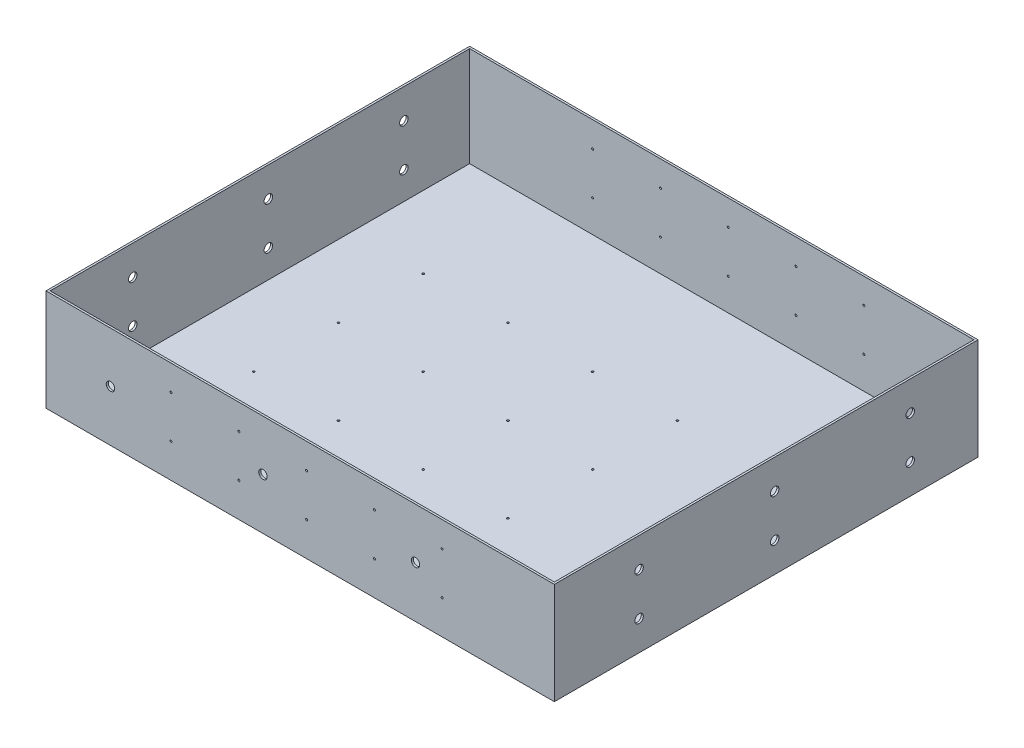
ISO-10303-21;
HEADER;
FILE_DESCRIPTION(('STEP AP214'),'2;1');
FILE_NAME('part.step','',(''),(''),'','','');
FILE_SCHEMA(('AUTOMOTIVE_DESIGN { 1 0 10303 214 1 1 1 1 }'));
ENDSEC;
DATA;
#1=APPLICATION_CONTEXT('core data for automotive mechanical design processes');
#2=APPLICATION_PROTOCOL_DEFINITION('international standard','automotive_design',2000,#1);
#3=PRODUCT_CONTEXT('',#1,'mechanical');
#4=PRODUCT('Part','Part','',(#3));
#5=PRODUCT_RELATED_PRODUCT_CATEGORY('part','',(#4));
#6=PRODUCT_DEFINITION_FORMATION('','',#4);
#7=PRODUCT_DEFINITION_CONTEXT('part definition',#1,'design');
#8=PRODUCT_DEFINITION('design','',#6,#7);
#9=PRODUCT_DEFINITION_SHAPE('','',#8);
#10=(LENGTH_UNIT() NAMED_UNIT(*) SI_UNIT(.MILLI.,.METRE.));
#11=(NAMED_UNIT(*) PLANE_ANGLE_UNIT() SI_UNIT($,.RADIAN.));
#12=(NAMED_UNIT(*) SI_UNIT($,.STERADIAN.) SOLID_ANGLE_UNIT());
#13=UNCERTAINTY_MEASURE_WITH_UNIT(LENGTH_MEASURE(1.E-05),#10,'distance_accuracy_value','');
#14=(GEOMETRIC_REPRESENTATION_CONTEXT(3) GLOBAL_UNCERTAINTY_ASSIGNED_CONTEXT((#13)) GLOBAL_UNIT_ASSIGNED_CONTEXT((#10,
#11,#12)) REPRESENTATION_CONTEXT('',''));
#15=CARTESIAN_POINT('',(0.,0.,0.));
#16=DIRECTION('',(0.,0.,1.));
#17=DIRECTION('',(1.,0.,0.));
#18=AXIS2_PLACEMENT_3D('',#15,#16,#17);
#19=CARTESIAN_POINT('',(-508.,152.4,-508.));
#20=DIRECTION('',(1.,0.,0.));
#21=DIRECTION('',(0.,0.,-1.));
#22=AXIS2_PLACEMENT_3D('',#19,#20,#21);
#23=PLANE('',#22);
#24=CARTESIAN_POINT('',(-508.,107.95,-203.2));
#25=DIRECTION('',(-1.,0.,0.));
#26=DIRECTION('',(0.,0.,1.));
#27=AXIS2_PLACEMENT_3D('',#24,#25,#26);
#28=CIRCLE('',#27,6.35);
#29=CARTESIAN_POINT('',(-508.,107.95,-196.85));
#30=VERTEX_POINT('',#29);
#31=EDGE_CURVE('E665',#30,#30,#28,.T.);
#32=ORIENTED_EDGE('',*,*,#31,.F.);
#33=EDGE_LOOP('',(#32));
#34=FACE_BOUND('',#33,.T.);
#35=CARTESIAN_POINT('',(-508.,107.95,-406.4));
#36=DIRECTION('',(-1.,0.,0.));
#37=DIRECTION('',(0.,0.,1.));
#38=AXIS2_PLACEMENT_3D('',#35,#36,#37);
#39=CIRCLE('',#38,6.35);
#40=CARTESIAN_POINT('',(-508.,107.95,-400.05));
#41=VERTEX_POINT('',#40);
#42=EDGE_CURVE('E668',#41,#41,#39,.T.);
#43=ORIENTED_EDGE('',*,*,#42,.F.);
#44=EDGE_LOOP('',(#43));
#45=FACE_BOUND('',#44,.T.);
#46=DIRECTION('',(0.,0.,1.));
#47=VECTOR('',#46,1.);
#48=CARTESIAN_POINT('',(-508.,0.,-508.));
#49=LINE('',#48,#47);
#50=CARTESIAN_POINT('',(-508.,0.,-508.));
#51=VERTEX_POINT('',#50);
#52=CARTESIAN_POINT('',(-508.,0.,127.));
#53=VERTEX_POINT('',#52);
#54=EDGE_CURVE('E152',#51,#53,#49,.T.);
#55=ORIENTED_EDGE('',*,*,#54,.T.);
#56=DIRECTION('',(0.,-1.,0.));
#57=VECTOR('',#56,1.);
#58=CARTESIAN_POINT('',(-508.,152.4,127.));
#59=LINE('',#58,#57);
#60=CARTESIAN_POINT('',(-508.,152.4,127.));
#61=VERTEX_POINT('',#60);
#62=EDGE_CURVE('E166',#61,#53,#59,.T.);
#63=ORIENTED_EDGE('',*,*,#62,.F.);
#64=DIRECTION('',(0.,0.,1.));
#65=VECTOR('',#64,1.);
#66=CARTESIAN_POINT('',(-508.,152.4,-508.));
#67=LINE('',#66,#65);
#68=CARTESIAN_POINT('',(-508.,152.4,-508.));
#69=VERTEX_POINT('',#68);
#70=EDGE_CURVE('E145',#69,#61,#67,.T.);
#71=ORIENTED_EDGE('',*,*,#70,.F.);
#72=DIRECTION('',(0.,-1.,0.));
#73=VECTOR('',#72,1.);
#74=CARTESIAN_POINT('',(-508.,152.4,-508.));
#75=LINE('',#74,#73);
#76=EDGE_CURVE('E151',#69,#51,#75,.T.);
#77=ORIENTED_EDGE('',*,*,#76,.T.);
#78=EDGE_LOOP('',(#55,#63,#71,#77));
#79=FACE_BOUND('',#78,.T.);
#80=CARTESIAN_POINT('',(-508.,107.95,0.));
#81=DIRECTION('',(-1.,0.,0.));
#82=DIRECTION('',(0.,0.,1.));
#83=AXIS2_PLACEMENT_3D('',#80,#81,#82);
#84=CIRCLE('',#83,6.35);
#85=CARTESIAN_POINT('',(-508.,107.95,6.35));
#86=VERTEX_POINT('',#85);
#87=EDGE_CURVE('E176',#86,#86,#84,.T.);
#88=ORIENTED_EDGE('',*,*,#87,.F.);
#89=EDGE_LOOP('',(#88));
#90=FACE_BOUND('',#89,.T.);
#91=CARTESIAN_POINT('',(-508.,44.45,-406.4));
#92=DIRECTION('',(-1.,0.,0.));
#93=DIRECTION('',(0.,0.,1.));
#94=AXIS2_PLACEMENT_3D('',#91,#92,#93);
#95=CIRCLE('',#94,6.35);
#96=CARTESIAN_POINT('',(-508.,44.45,-400.05));
#97=VERTEX_POINT('',#96);
#98=EDGE_CURVE('E182',#97,#97,#95,.T.);
#99=ORIENTED_EDGE('',*,*,#98,.F.);
#100=EDGE_LOOP('',(#99));
#101=FACE_BOUND('',#100,.T.);
#102=CARTESIAN_POINT('',(-508.,44.45,-203.2));
#103=DIRECTION('',(-1.,0.,0.));
#104=DIRECTION('',(0.,0.,1.));
#105=AXIS2_PLACEMENT_3D('',#102,#103,#104);
#106=CIRCLE('',#105,6.35);
#107=CARTESIAN_POINT('',(-508.,44.45,-196.85));
#108=VERTEX_POINT('',#107);
#109=EDGE_CURVE('E188',#108,#108,#106,.T.);
#110=ORIENTED_EDGE('',*,*,#109,.F.);
#111=EDGE_LOOP('',(#110));
#112=FACE_BOUND('',#111,.T.);
#113=CARTESIAN_POINT('',(-508.,44.45,0.));
#114=DIRECTION('',(-1.,0.,0.));
#115=DIRECTION('',(0.,0.,1.));
#116=AXIS2_PLACEMENT_3D('',#113,#114,#115);
#117=CIRCLE('',#116,6.35);
#118=CARTESIAN_POINT('',(-508.,44.45,6.35));
#119=VERTEX_POINT('',#118);
#120=EDGE_CURVE('E194',#119,#119,#117,.T.);
#121=ORIENTED_EDGE('',*,*,#120,.F.);
#122=EDGE_LOOP('',(#121));
#123=FACE_BOUND('',#122,.T.);
#124=ADVANCED_FACE('F34',(#34,#45,#79,#90,#101,#112,#123),#23,.F.);
#125=CARTESIAN_POINT('',(-508.,152.4,127.));
#126=DIRECTION('',(0.,0.,-1.));
#127=DIRECTION('',(-1.,0.,0.));
#128=AXIS2_PLACEMENT_3D('',#125,#126,#127);
#129=PLANE('',#128);
#130=CARTESIAN_POINT('',(45.8252354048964,76.7740112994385,127.));
#131=DIRECTION('',(0.,0.,1.));
#132=DIRECTION('',(1.,0.,0.));
#133=AXIS2_PLACEMENT_3D('',#130,#131,#132);
#134=CIRCLE('',#133,6.35);
#135=CARTESIAN_POINT('',(52.1752354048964,76.7740112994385,127.));
#136=VERTEX_POINT('',#135);
#137=EDGE_CURVE('E613',#136,#136,#134,.T.);
#138=ORIENTED_EDGE('',*,*,#137,.F.);
#139=EDGE_LOOP('',(#138));
#140=FACE_BOUND('',#139,.T.);
#141=CARTESIAN_POINT('',(-182.774764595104,76.7740112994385,127.));
#142=DIRECTION('',(0.,0.,1.));
#143=DIRECTION('',(1.,0.,0.));
#144=AXIS2_PLACEMENT_3D('',#141,#142,#143);
#145=CIRCLE('',#144,6.35);
#146=CARTESIAN_POINT('',(-176.424764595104,76.7740112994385,127.));
#147=VERTEX_POINT('',#146);
#148=EDGE_CURVE('E625',#147,#147,#145,.T.);
#149=ORIENTED_EDGE('',*,*,#148,.F.);
#150=EDGE_LOOP('',(#149));
#151=FACE_BOUND('',#150,.T.);
#152=CARTESIAN_POINT('',(-411.374764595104,76.7740112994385,127.));
#153=DIRECTION('',(0.,0.,1.));
#154=DIRECTION('',(1.,0.,0.));
#155=AXIS2_PLACEMENT_3D('',#152,#153,#154);
#156=CIRCLE('',#155,6.35);
#157=CARTESIAN_POINT('',(-405.024764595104,76.7740112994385,127.));
#158=VERTEX_POINT('',#157);
#159=EDGE_CURVE('E631',#158,#158,#156,.T.);
#160=ORIENTED_EDGE('',*,*,#159,.F.);
#161=EDGE_LOOP('',(#160));
#162=FACE_BOUND('',#161,.T.);
#163=CARTESIAN_POINT('',(-15.748,114.3,127.));
#164=DIRECTION('',(0.,0.,-1.));
#165=DIRECTION('',(-1.,0.,0.));
#166=AXIS2_PLACEMENT_3D('',#163,#164,#165);
#167=CIRCLE('',#166,1.52400000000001);
#168=CARTESIAN_POINT('',(-17.272,114.3,127.));
#169=VERTEX_POINT('',#168);
#170=EDGE_CURVE('E646',#169,#169,#167,.T.);
#171=ORIENTED_EDGE('',*,*,#170,.T.);
#172=EDGE_LOOP('',(#171));
#173=FACE_BOUND('',#172,.T.);
#174=CARTESIAN_POINT('',(85.852,114.3,127.));
#175=DIRECTION('',(0.,0.,-1.));
#176=DIRECTION('',(-1.,0.,0.));
#177=AXIS2_PLACEMENT_3D('',#174,#175,#176);
#178=CIRCLE('',#177,1.52400000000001);
#179=CARTESIAN_POINT('',(84.328,114.3,127.));
#180=VERTEX_POINT('',#179);
#181=EDGE_CURVE('E226',#180,#180,#178,.T.);
#182=ORIENTED_EDGE('',*,*,#181,.T.);
#183=EDGE_LOOP('',(#182));
#184=FACE_BOUND('',#183,.T.);
#185=DIRECTION('',(1.,0.,0.));
#186=VECTOR('',#185,1.);
#187=CARTESIAN_POINT('',(-508.,0.,127.));
#188=LINE('',#187,#186);
#189=CARTESIAN_POINT('',(254.,0.,127.));
#190=VERTEX_POINT('',#189);
#191=EDGE_CURVE('E155',#53,#190,#188,.T.);
#192=ORIENTED_EDGE('',*,*,#191,.T.);
#193=DIRECTION('',(0.,-1.,0.));
#194=VECTOR('',#193,1.);
#195=CARTESIAN_POINT('',(254.,152.4,127.));
#196=LINE('',#195,#194);
#197=CARTESIAN_POINT('',(254.,152.4,127.));
#198=VERTEX_POINT('',#197);
#199=EDGE_CURVE('E163',#198,#190,#196,.T.);
#200=ORIENTED_EDGE('',*,*,#199,.F.);
#201=DIRECTION('',(1.,0.,0.));
#202=VECTOR('',#201,1.);
#203=CARTESIAN_POINT('',(-508.,152.4,127.));
#204=LINE('',#203,#202);
#205=EDGE_CURVE('E87',#61,#198,#204,.T.);
#206=ORIENTED_EDGE('',*,*,#205,.F.);
#207=ORIENTED_EDGE('',*,*,#62,.T.);
#208=EDGE_LOOP('',(#192,#200,#206,#207));
#209=FACE_BOUND('',#208,.T.);
#210=CARTESIAN_POINT('',(-117.348,114.3,127.));
#211=DIRECTION('',(0.,0.,-1.));
#212=DIRECTION('',(-1.,0.,0.));
#213=AXIS2_PLACEMENT_3D('',#210,#211,#212);
#214=CIRCLE('',#213,1.52400000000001);
#215=CARTESIAN_POINT('',(-118.872,114.3,127.));
#216=VERTEX_POINT('',#215);
#217=EDGE_CURVE('E229',#216,#216,#214,.T.);
#218=ORIENTED_EDGE('',*,*,#217,.T.);
#219=EDGE_LOOP('',(#218));
#220=FACE_BOUND('',#219,.T.);
#221=CARTESIAN_POINT('',(-218.948,114.3,127.));
#222=DIRECTION('',(0.,0.,-1.));
#223=DIRECTION('',(-1.,0.,0.));
#224=AXIS2_PLACEMENT_3D('',#221,#222,#223);
#225=CIRCLE('',#224,1.52400000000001);
#226=CARTESIAN_POINT('',(-220.472,114.3,127.));
#227=VERTEX_POINT('',#226);
#228=EDGE_CURVE('E235',#227,#227,#225,.T.);
#229=ORIENTED_EDGE('',*,*,#228,.T.);
#230=EDGE_LOOP('',(#229));
#231=FACE_BOUND('',#230,.T.);
#232=CARTESIAN_POINT('',(-320.548,114.3,127.));
#233=DIRECTION('',(0.,0.,-1.));
#234=DIRECTION('',(-1.,0.,0.));
#235=AXIS2_PLACEMENT_3D('',#232,#233,#234);
#236=CIRCLE('',#235,1.52400000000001);
#237=CARTESIAN_POINT('',(-322.072,114.3,127.));
#238=VERTEX_POINT('',#237);
#239=EDGE_CURVE('E241',#238,#238,#236,.T.);
#240=ORIENTED_EDGE('',*,*,#239,.T.);
#241=EDGE_LOOP('',(#240));
#242=FACE_BOUND('',#241,.T.);
#243=CARTESIAN_POINT('',(85.852,50.8,127.));
#244=DIRECTION('',(0.,0.,-1.));
#245=DIRECTION('',(-1.,0.,0.));
#246=AXIS2_PLACEMENT_3D('',#243,#244,#245);
#247=CIRCLE('',#246,1.52400000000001);
#248=CARTESIAN_POINT('',(84.328,50.8,127.));
#249=VERTEX_POINT('',#248);
#250=EDGE_CURVE('E247',#249,#249,#247,.T.);
#251=ORIENTED_EDGE('',*,*,#250,.T.);
#252=EDGE_LOOP('',(#251));
#253=FACE_BOUND('',#252,.T.);
#254=CARTESIAN_POINT('',(-15.748,50.8,127.));
#255=DIRECTION('',(0.,0.,-1.));
#256=DIRECTION('',(-1.,0.,0.));
#257=AXIS2_PLACEMENT_3D('',#254,#255,#256);
#258=CIRCLE('',#257,1.52400000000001);
#259=CARTESIAN_POINT('',(-17.272,50.8,127.));
#260=VERTEX_POINT('',#259);
#261=EDGE_CURVE('E253',#260,#260,#258,.T.);
#262=ORIENTED_EDGE('',*,*,#261,.T.);
#263=EDGE_LOOP('',(#262));
#264=FACE_BOUND('',#263,.T.);
#265=CARTESIAN_POINT('',(-117.348,50.8,127.));
#266=DIRECTION('',(0.,0.,-1.));
#267=DIRECTION('',(-1.,0.,0.));
#268=AXIS2_PLACEMENT_3D('',#265,#266,#267);
#269=CIRCLE('',#268,1.52400000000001);
#270=CARTESIAN_POINT('',(-118.872,50.8,127.));
#271=VERTEX_POINT('',#270);
#272=EDGE_CURVE('E259',#271,#271,#269,.T.);
#273=ORIENTED_EDGE('',*,*,#272,.T.);
#274=EDGE_LOOP('',(#273));
#275=FACE_BOUND('',#274,.T.);
#276=CARTESIAN_POINT('',(-218.948,50.8,127.));
#277=DIRECTION('',(0.,0.,-1.));
#278=DIRECTION('',(-1.,0.,0.));
#279=AXIS2_PLACEMENT_3D('',#276,#277,#278);
#280=CIRCLE('',#279,1.52400000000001);
#281=CARTESIAN_POINT('',(-220.472,50.8,127.));
#282=VERTEX_POINT('',#281);
#283=EDGE_CURVE('E265',#282,#282,#280,.T.);
#284=ORIENTED_EDGE('',*,*,#283,.T.);
#285=EDGE_LOOP('',(#284));
#286=FACE_BOUND('',#285,.T.);
#287=CARTESIAN_POINT('',(-320.548,50.8,127.));
#288=DIRECTION('',(0.,0.,-1.));
#289=DIRECTION('',(-1.,0.,0.));
#290=AXIS2_PLACEMENT_3D('',#287,#288,#289);
#291=CIRCLE('',#290,1.52400000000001);
#292=CARTESIAN_POINT('',(-322.072,50.8,127.));
#293=VERTEX_POINT('',#292);
#294=EDGE_CURVE('E271',#293,#293,#291,.T.);
#295=ORIENTED_EDGE('',*,*,#294,.T.);
#296=EDGE_LOOP('',(#295));
#297=FACE_BOUND('',#296,.T.);
#298=ADVANCED_FACE('F336',(#140,#151,#162,#173,#184,#209,#220,#231,#242,#253,#264,#275,#286,
#297),#129,.F.);
#299=CARTESIAN_POINT('',(254.,152.4,-508.));
#300=DIRECTION('',(-1.,0.,0.));
#301=DIRECTION('',(0.,0.,1.));
#302=AXIS2_PLACEMENT_3D('',#299,#300,#301);
#303=PLANE('',#302);
#304=CARTESIAN_POINT('',(254.,107.95,-203.2));
#305=DIRECTION('',(-1.,0.,0.));
#306=DIRECTION('',(0.,0.,1.));
#307=AXIS2_PLACEMENT_3D('',#304,#305,#306);
#308=CIRCLE('',#307,6.35);
#309=CARTESIAN_POINT('',(254.,107.95,-196.85));
#310=VERTEX_POINT('',#309);
#311=EDGE_CURVE('E659',#310,#310,#308,.T.);
#312=ORIENTED_EDGE('',*,*,#311,.T.);
#313=EDGE_LOOP('',(#312));
#314=FACE_BOUND('',#313,.T.);
#315=CARTESIAN_POINT('',(254.,107.95,-406.4));
#316=DIRECTION('',(-1.,0.,0.));
#317=DIRECTION('',(0.,0.,1.));
#318=AXIS2_PLACEMENT_3D('',#315,#316,#317);
#319=CIRCLE('',#318,6.35);
#320=CARTESIAN_POINT('',(254.,107.95,-400.05));
#321=VERTEX_POINT('',#320);
#322=EDGE_CURVE('E173',#321,#321,#319,.T.);
#323=ORIENTED_EDGE('',*,*,#322,.T.);
#324=EDGE_LOOP('',(#323));
#325=FACE_BOUND('',#324,.T.);
#326=DIRECTION('',(0.,0.,-1.));
#327=VECTOR('',#326,1.);
#328=CARTESIAN_POINT('',(254.,0.,-508.));
#329=LINE('',#328,#327);
#330=CARTESIAN_POINT('',(254.,0.,-508.));
#331=VERTEX_POINT('',#330);
#332=EDGE_CURVE('E157',#190,#331,#329,.T.);
#333=ORIENTED_EDGE('',*,*,#332,.T.);
#334=DIRECTION('',(0.,-1.,0.));
#335=VECTOR('',#334,1.);
#336=CARTESIAN_POINT('',(254.,152.4,-508.));
#337=LINE('',#336,#335);
#338=CARTESIAN_POINT('',(254.,152.4,-508.));
#339=VERTEX_POINT('',#338);
#340=EDGE_CURVE('E161',#339,#331,#337,.T.);
#341=ORIENTED_EDGE('',*,*,#340,.F.);
#342=DIRECTION('',(0.,0.,-1.));
#343=VECTOR('',#342,1.);
#344=CARTESIAN_POINT('',(254.,152.4,-508.));
#345=LINE('',#344,#343);
#346=EDGE_CURVE('E148',#198,#339,#345,.T.);
#347=ORIENTED_EDGE('',*,*,#346,.F.);
#348=ORIENTED_EDGE('',*,*,#199,.T.);
#349=EDGE_LOOP('',(#333,#341,#347,#348));
#350=FACE_BOUND('',#349,.T.);
#351=CARTESIAN_POINT('',(254.,107.95,-1.66533453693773E-13));
#352=DIRECTION('',(-1.,0.,0.));
#353=DIRECTION('',(0.,0.,1.));
#354=AXIS2_PLACEMENT_3D('',#351,#352,#353);
#355=CIRCLE('',#354,6.35);
#356=CARTESIAN_POINT('',(254.,107.95,6.34999999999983));
#357=VERTEX_POINT('',#356);
#358=EDGE_CURVE('E200',#357,#357,#355,.T.);
#359=ORIENTED_EDGE('',*,*,#358,.T.);
#360=EDGE_LOOP('',(#359));
#361=FACE_BOUND('',#360,.T.);
#362=CARTESIAN_POINT('',(254.,44.45,-406.4));
#363=DIRECTION('',(-1.,0.,0.));
#364=DIRECTION('',(0.,0.,1.));
#365=AXIS2_PLACEMENT_3D('',#362,#363,#364);
#366=CIRCLE('',#365,6.35);
#367=CARTESIAN_POINT('',(254.,44.45,-400.05));
#368=VERTEX_POINT('',#367);
#369=EDGE_CURVE('E206',#368,#368,#366,.T.);
#370=ORIENTED_EDGE('',*,*,#369,.T.);
#371=EDGE_LOOP('',(#370));
#372=FACE_BOUND('',#371,.T.);
#373=CARTESIAN_POINT('',(254.,44.45,-203.2));
#374=DIRECTION('',(-1.,0.,0.));
#375=DIRECTION('',(0.,0.,1.));
#376=AXIS2_PLACEMENT_3D('',#373,#374,#375);
#377=CIRCLE('',#376,6.35);
#378=CARTESIAN_POINT('',(254.,44.45,-196.85));
#379=VERTEX_POINT('',#378);
#380=EDGE_CURVE('E212',#379,#379,#377,.T.);
#381=ORIENTED_EDGE('',*,*,#380,.T.);
#382=EDGE_LOOP('',(#381));
#383=FACE_BOUND('',#382,.T.);
#384=CARTESIAN_POINT('',(254.,44.45,-1.66533453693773E-13));
#385=DIRECTION('',(-1.,0.,0.));
#386=DIRECTION('',(0.,0.,1.));
#387=AXIS2_PLACEMENT_3D('',#384,#385,#386);
#388=CIRCLE('',#387,6.35);
#389=CARTESIAN_POINT('',(254.,44.45,6.34999999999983));
#390=VERTEX_POINT('',#389);
#391=EDGE_CURVE('E218',#390,#390,#388,.T.);
#392=ORIENTED_EDGE('',*,*,#391,.T.);
#393=EDGE_LOOP('',(#392));
#394=FACE_BOUND('',#393,.T.);
#395=ADVANCED_FACE('F342',(#314,#325,#350,#361,#372,#383,#394),#303,.F.);
#396=CARTESIAN_POINT('',(-508.,152.4,-508.));
#397=DIRECTION('',(0.,0.,1.));
#398=DIRECTION('',(1.,0.,0.));
#399=AXIS2_PLACEMENT_3D('',#396,#397,#398);
#400=PLANE('',#399);
#401=CARTESIAN_POINT('',(-15.748,114.3,-508.));
#402=DIRECTION('',(0.,0.,-1.));
#403=DIRECTION('',(-1.,0.,0.));
#404=AXIS2_PLACEMENT_3D('',#401,#402,#403);
#405=CIRCLE('',#404,1.52400000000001);
#406=CARTESIAN_POINT('',(-17.272,114.3,-508.));
#407=VERTEX_POINT('',#406);
#408=EDGE_CURVE('E640',#407,#407,#405,.T.);
#409=ORIENTED_EDGE('',*,*,#408,.F.);
#410=EDGE_LOOP('',(#409));
#411=FACE_BOUND('',#410,.T.);
#412=CARTESIAN_POINT('',(85.852,114.3,-508.));
#413=DIRECTION('',(0.,0.,-1.));
#414=DIRECTION('',(-1.,0.,0.));
#415=AXIS2_PLACEMENT_3D('',#412,#413,#414);
#416=CIRCLE('',#415,1.52400000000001);
#417=CARTESIAN_POINT('',(84.328,114.3,-508.));
#418=VERTEX_POINT('',#417);
#419=EDGE_CURVE('E649',#418,#418,#416,.T.);
#420=ORIENTED_EDGE('',*,*,#419,.F.);
#421=EDGE_LOOP('',(#420));
#422=FACE_BOUND('',#421,.T.);
#423=DIRECTION('',(-1.,0.,0.));
#424=VECTOR('',#423,1.);
#425=CARTESIAN_POINT('',(-508.,0.,-508.));
#426=LINE('',#425,#424);
#427=EDGE_CURVE('E79',#331,#51,#426,.T.);
#428=ORIENTED_EDGE('',*,*,#427,.T.);
#429=ORIENTED_EDGE('',*,*,#76,.F.);
#430=DIRECTION('',(-1.,0.,0.));
#431=VECTOR('',#430,1.);
#432=CARTESIAN_POINT('',(-508.,152.4,-508.));
#433=LINE('',#432,#431);
#434=EDGE_CURVE('E58',#339,#69,#433,.T.);
#435=ORIENTED_EDGE('',*,*,#434,.F.);
#436=ORIENTED_EDGE('',*,*,#340,.T.);
#437=EDGE_LOOP('',(#428,#429,#435,#436));
#438=FACE_BOUND('',#437,.T.);
#439=CARTESIAN_POINT('',(-117.348,114.3,-508.));
#440=DIRECTION('',(0.,0.,-1.));
#441=DIRECTION('',(-1.,0.,0.));
#442=AXIS2_PLACEMENT_3D('',#439,#440,#441);
#443=CIRCLE('',#442,1.52400000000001);
#444=CARTESIAN_POINT('',(-118.872,114.3,-508.));
#445=VERTEX_POINT('',#444);
#446=EDGE_CURVE('E277',#445,#445,#443,.T.);
#447=ORIENTED_EDGE('',*,*,#446,.F.);
#448=EDGE_LOOP('',(#447));
#449=FACE_BOUND('',#448,.T.);
#450=CARTESIAN_POINT('',(-218.948,114.3,-508.));
#451=DIRECTION('',(0.,0.,-1.));
#452=DIRECTION('',(-1.,0.,0.));
#453=AXIS2_PLACEMENT_3D('',#450,#451,#452);
#454=CIRCLE('',#453,1.52400000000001);
#455=CARTESIAN_POINT('',(-220.472,114.3,-508.));
#456=VERTEX_POINT('',#455);
#457=EDGE_CURVE('E283',#456,#456,#454,.T.);
#458=ORIENTED_EDGE('',*,*,#457,.F.);
#459=EDGE_LOOP('',(#458));
#460=FACE_BOUND('',#459,.T.);
#461=CARTESIAN_POINT('',(-320.548,114.3,-508.));
#462=DIRECTION('',(0.,0.,-1.));
#463=DIRECTION('',(-1.,0.,0.));
#464=AXIS2_PLACEMENT_3D('',#461,#462,#463);
#465=CIRCLE('',#464,1.52400000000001);
#466=CARTESIAN_POINT('',(-322.072,114.3,-508.));
#467=VERTEX_POINT('',#466);
#468=EDGE_CURVE('E289',#467,#467,#465,.T.);
#469=ORIENTED_EDGE('',*,*,#468,.F.);
#470=EDGE_LOOP('',(#469));
#471=FACE_BOUND('',#470,.T.);
#472=CARTESIAN_POINT('',(85.852,50.8,-508.));
#473=DIRECTION('',(0.,0.,-1.));
#474=DIRECTION('',(-1.,0.,0.));
#475=AXIS2_PLACEMENT_3D('',#472,#473,#474);
#476=CIRCLE('',#475,1.52400000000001);
#477=CARTESIAN_POINT('',(84.328,50.8,-508.));
#478=VERTEX_POINT('',#477);
#479=EDGE_CURVE('E295',#478,#478,#476,.T.);
#480=ORIENTED_EDGE('',*,*,#479,.F.);
#481=EDGE_LOOP('',(#480));
#482=FACE_BOUND('',#481,.T.);
#483=CARTESIAN_POINT('',(-15.748,50.8,-508.));
#484=DIRECTION('',(0.,0.,-1.));
#485=DIRECTION('',(-1.,0.,0.));
#486=AXIS2_PLACEMENT_3D('',#483,#484,#485);
#487=CIRCLE('',#486,1.52400000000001);
#488=CARTESIAN_POINT('',(-17.272,50.8,-508.));
#489=VERTEX_POINT('',#488);
#490=EDGE_CURVE('E301',#489,#489,#487,.T.);
#491=ORIENTED_EDGE('',*,*,#490,.F.);
#492=EDGE_LOOP('',(#491));
#493=FACE_BOUND('',#492,.T.);
#494=CARTESIAN_POINT('',(-117.348,50.8,-508.));
#495=DIRECTION('',(0.,0.,-1.));
#496=DIRECTION('',(-1.,0.,0.));
#497=AXIS2_PLACEMENT_3D('',#494,#495,#496);
#498=CIRCLE('',#497,1.52400000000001);
#499=CARTESIAN_POINT('',(-118.872,50.8,-508.));
#500=VERTEX_POINT('',#499);
#501=EDGE_CURVE('E307',#500,#500,#498,.T.);
#502=ORIENTED_EDGE('',*,*,#501,.F.);
#503=EDGE_LOOP('',(#502));
#504=FACE_BOUND('',#503,.T.);
#505=CARTESIAN_POINT('',(-218.948,50.8,-508.));
#506=DIRECTION('',(0.,0.,-1.));
#507=DIRECTION('',(-1.,0.,0.));
#508=AXIS2_PLACEMENT_3D('',#505,#506,#507);
#509=CIRCLE('',#508,1.52400000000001);
#510=CARTESIAN_POINT('',(-220.472,50.8,-508.));
#511=VERTEX_POINT('',#510);
#512=EDGE_CURVE('E313',#511,#511,#509,.T.);
#513=ORIENTED_EDGE('',*,*,#512,.F.);
#514=EDGE_LOOP('',(#513));
#515=FACE_BOUND('',#514,.T.);
#516=CARTESIAN_POINT('',(-320.548,50.8,-508.));
#517=DIRECTION('',(0.,0.,-1.));
#518=DIRECTION('',(-1.,0.,0.));
#519=AXIS2_PLACEMENT_3D('',#516,#517,#518);
#520=CIRCLE('',#519,1.52400000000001);
#521=CARTESIAN_POINT('',(-322.072,50.8,-508.));
#522=VERTEX_POINT('',#521);
#523=EDGE_CURVE('E11',#522,#522,#520,.T.);
#524=ORIENTED_EDGE('',*,*,#523,.F.);
#525=EDGE_LOOP('',(#524));
#526=FACE_BOUND('',#525,.T.);
#527=ADVANCED_FACE('F452',(#411,#422,#438,#449,#460,#471,#482,#493,#504,#515,#526),#400,.F.);
#528=CARTESIAN_POINT('',(-508.,152.4,127.));
#529=DIRECTION('',(0.,1.,0.));
#530=DIRECTION('',(0.,0.,1.));
#531=AXIS2_PLACEMENT_3D('',#528,#529,#530);
#532=PLANE('',#531);
#533=DIRECTION('',(0.,0.,1.));
#534=VECTOR('',#533,1.);
#535=CARTESIAN_POINT('',(-504.952,152.4,-508.));
#536=LINE('',#535,#534);
#537=CARTESIAN_POINT('',(-504.952,152.4,-504.952));
#538=VERTEX_POINT('',#537);
#539=CARTESIAN_POINT('',(-504.952,152.4,123.952));
#540=VERTEX_POINT('',#539);
#541=EDGE_CURVE('E134',#538,#540,#536,.T.);
#542=ORIENTED_EDGE('',*,*,#541,.F.);
#543=DIRECTION('',(-1.,0.,0.));
#544=VECTOR('',#543,1.);
#545=CARTESIAN_POINT('',(-508.,152.4,-504.952));
#546=LINE('',#545,#544);
#547=CARTESIAN_POINT('',(250.952,152.4,-504.952));
#548=VERTEX_POINT('',#547);
#549=EDGE_CURVE('E143',#548,#538,#546,.T.);
#550=ORIENTED_EDGE('',*,*,#549,.F.);
#551=DIRECTION('',(0.,0.,-1.));
#552=VECTOR('',#551,1.);
#553=CARTESIAN_POINT('',(250.952,152.4,-508.));
#554=LINE('',#553,#552);
#555=CARTESIAN_POINT('',(250.952,152.4,123.952));
#556=VERTEX_POINT('',#555);
#557=EDGE_CURVE('E141',#556,#548,#554,.T.);
#558=ORIENTED_EDGE('',*,*,#557,.F.);
#559=DIRECTION('',(1.,0.,0.));
#560=VECTOR('',#559,1.);
#561=CARTESIAN_POINT('',(-508.,152.4,123.952));
#562=LINE('',#561,#560);
#563=EDGE_CURVE('E125',#540,#556,#562,.T.);
#564=ORIENTED_EDGE('',*,*,#563,.F.);
#565=EDGE_LOOP('',(#542,#550,#558,#564));
#566=FACE_BOUND('',#565,.T.);
#567=ORIENTED_EDGE('',*,*,#70,.T.);
#568=ORIENTED_EDGE('',*,*,#205,.T.);
#569=ORIENTED_EDGE('',*,*,#346,.T.);
#570=ORIENTED_EDGE('',*,*,#434,.T.);
#571=EDGE_LOOP('',(#567,#568,#569,#570));
#572=FACE_BOUND('',#571,.T.);
#573=ADVANCED_FACE('F455',(#566,#572),#532,.T.);
#574=CARTESIAN_POINT('',(-508.,0.,127.));
#575=DIRECTION('',(0.,1.,0.));
#576=DIRECTION('',(0.,0.,1.));
#577=AXIS2_PLACEMENT_3D('',#574,#575,#576);
#578=PLANE('',#577);
#579=CARTESIAN_POINT('',(-396.748,0.,-73.152));
#580=DIRECTION('',(0.,1.,0.));
#581=DIRECTION('',(0.,0.,1.));
#582=AXIS2_PLACEMENT_3D('',#579,#580,#581);
#583=CIRCLE('',#582,1.52400000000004);
#584=CARTESIAN_POINT('',(-396.748,0.,-71.628));
#585=VERTEX_POINT('',#584);
#586=EDGE_CURVE('E481',#585,#585,#583,.F.);
#587=ORIENTED_EDGE('',*,*,#586,.F.);
#588=EDGE_LOOP('',(#587));
#589=FACE_BOUND('',#588,.T.);
#590=CARTESIAN_POINT('',(-269.748,0.,-73.152));
#591=DIRECTION('',(0.,1.,0.));
#592=DIRECTION('',(0.,0.,1.));
#593=AXIS2_PLACEMENT_3D('',#590,#591,#592);
#594=CIRCLE('',#593,1.52400000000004);
#595=CARTESIAN_POINT('',(-269.748,0.,-71.628));
#596=VERTEX_POINT('',#595);
#597=EDGE_CURVE('E485',#596,#596,#594,.F.);
#598=ORIENTED_EDGE('',*,*,#597,.F.);
#599=EDGE_LOOP('',(#598));
#600=FACE_BOUND('',#599,.T.);
#601=CARTESIAN_POINT('',(-142.748,0.,-73.152));
#602=DIRECTION('',(0.,1.,0.));
#603=DIRECTION('',(0.,0.,1.));
#604=AXIS2_PLACEMENT_3D('',#601,#602,#603);
#605=CIRCLE('',#604,1.52400000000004);
#606=CARTESIAN_POINT('',(-142.748,0.,-71.628));
#607=VERTEX_POINT('',#606);
#608=EDGE_CURVE('E489',#607,#607,#605,.F.);
#609=ORIENTED_EDGE('',*,*,#608,.F.);
#610=EDGE_LOOP('',(#609));
#611=FACE_BOUND('',#610,.T.);
#612=CARTESIAN_POINT('',(-15.748,0.,-73.152));
#613=DIRECTION('',(0.,1.,0.));
#614=DIRECTION('',(0.,0.,1.));
#615=AXIS2_PLACEMENT_3D('',#612,#613,#614);
#616=CIRCLE('',#615,1.52400000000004);
#617=CARTESIAN_POINT('',(-15.748,0.,-71.628));
#618=VERTEX_POINT('',#617);
#619=EDGE_CURVE('E493',#618,#618,#616,.F.);
#620=ORIENTED_EDGE('',*,*,#619,.F.);
#621=EDGE_LOOP('',(#620));
#622=FACE_BOUND('',#621,.T.);
#623=CARTESIAN_POINT('',(111.252,0.,-73.152));
#624=DIRECTION('',(0.,1.,0.));
#625=DIRECTION('',(0.,0.,1.));
#626=AXIS2_PLACEMENT_3D('',#623,#624,#625);
#627=CIRCLE('',#626,1.52400000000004);
#628=CARTESIAN_POINT('',(111.252,0.,-71.628));
#629=VERTEX_POINT('',#628);
#630=EDGE_CURVE('E497',#629,#629,#627,.F.);
#631=ORIENTED_EDGE('',*,*,#630,.F.);
#632=EDGE_LOOP('',(#631));
#633=FACE_BOUND('',#632,.T.);
#634=CARTESIAN_POINT('',(-396.748,0.,-200.152));
#635=DIRECTION('',(0.,1.,0.));
#636=DIRECTION('',(0.,0.,1.));
#637=AXIS2_PLACEMENT_3D('',#634,#635,#636);
#638=CIRCLE('',#637,1.52400000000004);
#639=CARTESIAN_POINT('',(-396.748,0.,-198.628));
#640=VERTEX_POINT('',#639);
#641=EDGE_CURVE('E501',#640,#640,#638,.F.);
#642=ORIENTED_EDGE('',*,*,#641,.F.);
#643=EDGE_LOOP('',(#642));
#644=FACE_BOUND('',#643,.T.);
#645=CARTESIAN_POINT('',(-269.748,0.,-200.152));
#646=DIRECTION('',(0.,1.,0.));
#647=DIRECTION('',(0.,0.,1.));
#648=AXIS2_PLACEMENT_3D('',#645,#646,#647);
#649=CIRCLE('',#648,1.52400000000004);
#650=CARTESIAN_POINT('',(-269.748,0.,-198.628));
#651=VERTEX_POINT('',#650);
#652=EDGE_CURVE('E505',#651,#651,#649,.F.);
#653=ORIENTED_EDGE('',*,*,#652,.F.);
#654=EDGE_LOOP('',(#653));
#655=FACE_BOUND('',#654,.T.);
#656=CARTESIAN_POINT('',(-142.748,0.,-200.152));
#657=DIRECTION('',(0.,1.,0.));
#658=DIRECTION('',(0.,0.,1.));
#659=AXIS2_PLACEMENT_3D('',#656,#657,#658);
#660=CIRCLE('',#659,1.52400000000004);
#661=CARTESIAN_POINT('',(-142.748,0.,-198.628));
#662=VERTEX_POINT('',#661);
#663=EDGE_CURVE('E509',#662,#662,#660,.F.);
#664=ORIENTED_EDGE('',*,*,#663,.F.);
#665=EDGE_LOOP('',(#664));
#666=FACE_BOUND('',#665,.T.);
#667=CARTESIAN_POINT('',(-15.748,0.,-200.152));
#668=DIRECTION('',(0.,1.,0.));
#669=DIRECTION('',(0.,0.,1.));
#670=AXIS2_PLACEMENT_3D('',#667,#668,#669);
#671=CIRCLE('',#670,1.52400000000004);
#672=CARTESIAN_POINT('',(-15.748,0.,-198.628));
#673=VERTEX_POINT('',#672);
#674=EDGE_CURVE('E513',#673,#673,#671,.F.);
#675=ORIENTED_EDGE('',*,*,#674,.F.);
#676=EDGE_LOOP('',(#675));
#677=FACE_BOUND('',#676,.T.);
#678=CARTESIAN_POINT('',(111.252,0.,-200.152));
#679=DIRECTION('',(0.,1.,0.));
#680=DIRECTION('',(0.,0.,1.));
#681=AXIS2_PLACEMENT_3D('',#678,#679,#680);
#682=CIRCLE('',#681,1.52400000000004);
#683=CARTESIAN_POINT('',(111.252,0.,-198.628));
#684=VERTEX_POINT('',#683);
#685=EDGE_CURVE('E517',#684,#684,#682,.F.);
#686=ORIENTED_EDGE('',*,*,#685,.F.);
#687=EDGE_LOOP('',(#686));
#688=FACE_BOUND('',#687,.T.);
#689=CARTESIAN_POINT('',(-396.748,0.,-327.152));
#690=DIRECTION('',(0.,1.,0.));
#691=DIRECTION('',(0.,0.,1.));
#692=AXIS2_PLACEMENT_3D('',#689,#690,#691);
#693=CIRCLE('',#692,1.52400000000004);
#694=CARTESIAN_POINT('',(-396.748,0.,-325.628));
#695=VERTEX_POINT('',#694);
#696=EDGE_CURVE('E521',#695,#695,#693,.F.);
#697=ORIENTED_EDGE('',*,*,#696,.F.);
#698=EDGE_LOOP('',(#697));
#699=FACE_BOUND('',#698,.T.);
#700=CARTESIAN_POINT('',(-269.748,0.,-327.152));
#701=DIRECTION('',(0.,1.,0.));
#702=DIRECTION('',(0.,0.,1.));
#703=AXIS2_PLACEMENT_3D('',#700,#701,#702);
#704=CIRCLE('',#703,1.52400000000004);
#705=CARTESIAN_POINT('',(-269.748,0.,-325.628));
#706=VERTEX_POINT('',#705);
#707=EDGE_CURVE('E525',#706,#706,#704,.F.);
#708=ORIENTED_EDGE('',*,*,#707,.F.);
#709=EDGE_LOOP('',(#708));
#710=FACE_BOUND('',#709,.T.);
#711=CARTESIAN_POINT('',(-142.748,0.,-327.152));
#712=DIRECTION('',(0.,1.,0.));
#713=DIRECTION('',(0.,0.,1.));
#714=AXIS2_PLACEMENT_3D('',#711,#712,#713);
#715=CIRCLE('',#714,1.52400000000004);
#716=CARTESIAN_POINT('',(-142.748,0.,-325.628));
#717=VERTEX_POINT('',#716);
#718=EDGE_CURVE('E529',#717,#717,#715,.F.);
#719=ORIENTED_EDGE('',*,*,#718,.F.);
#720=EDGE_LOOP('',(#719));
#721=FACE_BOUND('',#720,.T.);
#722=CARTESIAN_POINT('',(-15.748,0.,-327.152));
#723=DIRECTION('',(0.,1.,0.));
#724=DIRECTION('',(0.,0.,1.));
#725=AXIS2_PLACEMENT_3D('',#722,#723,#724);
#726=CIRCLE('',#725,1.52400000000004);
#727=CARTESIAN_POINT('',(-15.748,0.,-325.628));
#728=VERTEX_POINT('',#727);
#729=EDGE_CURVE('E533',#728,#728,#726,.F.);
#730=ORIENTED_EDGE('',*,*,#729,.F.);
#731=EDGE_LOOP('',(#730));
#732=FACE_BOUND('',#731,.T.);
#733=CARTESIAN_POINT('',(111.252,0.,-327.152));
#734=DIRECTION('',(0.,1.,0.));
#735=DIRECTION('',(0.,0.,1.));
#736=AXIS2_PLACEMENT_3D('',#733,#734,#735);
#737=CIRCLE('',#736,1.52400000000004);
#738=CARTESIAN_POINT('',(111.252,0.,-325.628));
#739=VERTEX_POINT('',#738);
#740=EDGE_CURVE('E537',#739,#739,#737,.F.);
#741=ORIENTED_EDGE('',*,*,#740,.F.);
#742=EDGE_LOOP('',(#741));
#743=FACE_BOUND('',#742,.T.);
#744=ORIENTED_EDGE('',*,*,#54,.F.);
#745=ORIENTED_EDGE('',*,*,#427,.F.);
#746=ORIENTED_EDGE('',*,*,#332,.F.);
#747=ORIENTED_EDGE('',*,*,#191,.F.);
#748=EDGE_LOOP('',(#744,#745,#746,#747));
#749=FACE_BOUND('',#748,.T.);
#750=ADVANCED_FACE('F463',(#589,#600,#611,#622,#633,#644,#655,#666,#677,#688,#699,#710,#721,
#732,#743,#749),#578,.F.);
#751=CARTESIAN_POINT('',(-504.952,152.4,-508.));
#752=DIRECTION('',(1.,0.,0.));
#753=DIRECTION('',(0.,0.,-1.));
#754=AXIS2_PLACEMENT_3D('',#751,#752,#753);
#755=PLANE('',#754);
#756=CARTESIAN_POINT('',(-504.952,107.95,-203.2));
#757=DIRECTION('',(1.,0.,0.));
#758=DIRECTION('',(0.,0.,-1.));
#759=AXIS2_PLACEMENT_3D('',#756,#757,#758);
#760=CIRCLE('',#759,6.35);
#761=CARTESIAN_POINT('',(-504.952,107.95,-209.55));
#762=VERTEX_POINT('',#761);
#763=EDGE_CURVE('E662',#762,#762,#760,.T.);
#764=ORIENTED_EDGE('',*,*,#763,.F.);
#765=EDGE_LOOP('',(#764));
#766=FACE_BOUND('',#765,.T.);
#767=CARTESIAN_POINT('',(-504.952,107.95,-406.4));
#768=DIRECTION('',(1.,0.,0.));
#769=DIRECTION('',(0.,0.,-1.));
#770=AXIS2_PLACEMENT_3D('',#767,#768,#769);
#771=CIRCLE('',#770,6.35);
#772=CARTESIAN_POINT('',(-504.952,107.95,-412.75));
#773=VERTEX_POINT('',#772);
#774=EDGE_CURVE('E172',#773,#773,#771,.T.);
#775=ORIENTED_EDGE('',*,*,#774,.F.);
#776=EDGE_LOOP('',(#775));
#777=FACE_BOUND('',#776,.T.);
#778=DIRECTION('',(0.,0.,1.));
#779=VECTOR('',#778,1.);
#780=CARTESIAN_POINT('',(-504.952,3.048,-508.));
#781=LINE('',#780,#779);
#782=CARTESIAN_POINT('',(-504.952,3.048,-504.952));
#783=VERTEX_POINT('',#782);
#784=CARTESIAN_POINT('',(-504.952,3.048,123.952));
#785=VERTEX_POINT('',#784);
#786=EDGE_CURVE('E115',#783,#785,#781,.T.);
#787=ORIENTED_EDGE('',*,*,#786,.F.);
#788=DIRECTION('',(0.,-1.,0.));
#789=VECTOR('',#788,1.);
#790=CARTESIAN_POINT('',(-504.952,152.4,-504.952));
#791=LINE('',#790,#789);
#792=EDGE_CURVE('E137',#538,#783,#791,.T.);
#793=ORIENTED_EDGE('',*,*,#792,.F.);
#794=ORIENTED_EDGE('',*,*,#541,.T.);
#795=DIRECTION('',(0.,-1.,0.));
#796=VECTOR('',#795,1.);
#797=CARTESIAN_POINT('',(-504.952,152.4,123.952));
#798=LINE('',#797,#796);
#799=EDGE_CURVE('E128',#540,#785,#798,.T.);
#800=ORIENTED_EDGE('',*,*,#799,.T.);
#801=EDGE_LOOP('',(#787,#793,#794,#800));
#802=FACE_BOUND('',#801,.T.);
#803=CARTESIAN_POINT('',(-504.952,107.95,0.));
#804=DIRECTION('',(1.,0.,0.));
#805=DIRECTION('',(0.,0.,-1.));
#806=AXIS2_PLACEMENT_3D('',#803,#804,#805);
#807=CIRCLE('',#806,6.35);
#808=CARTESIAN_POINT('',(-504.952,107.95,-6.35000000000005));
#809=VERTEX_POINT('',#808);
#810=EDGE_CURVE('E168',#809,#809,#807,.T.);
#811=ORIENTED_EDGE('',*,*,#810,.F.);
#812=EDGE_LOOP('',(#811));
#813=FACE_BOUND('',#812,.T.);
#814=CARTESIAN_POINT('',(-504.952,44.45,-406.4));
#815=DIRECTION('',(1.,0.,0.));
#816=DIRECTION('',(0.,0.,-1.));
#817=AXIS2_PLACEMENT_3D('',#814,#815,#816);
#818=CIRCLE('',#817,6.35);
#819=CARTESIAN_POINT('',(-504.952,44.45,-412.75));
#820=VERTEX_POINT('',#819);
#821=EDGE_CURVE('E179',#820,#820,#818,.T.);
#822=ORIENTED_EDGE('',*,*,#821,.F.);
#823=EDGE_LOOP('',(#822));
#824=FACE_BOUND('',#823,.T.);
#825=CARTESIAN_POINT('',(-504.952,44.45,-203.2));
#826=DIRECTION('',(1.,0.,0.));
#827=DIRECTION('',(0.,0.,-1.));
#828=AXIS2_PLACEMENT_3D('',#825,#826,#827);
#829=CIRCLE('',#828,6.35);
#830=CARTESIAN_POINT('',(-504.952,44.45,-209.55));
#831=VERTEX_POINT('',#830);
#832=EDGE_CURVE('E185',#831,#831,#829,.T.);
#833=ORIENTED_EDGE('',*,*,#832,.F.);
#834=EDGE_LOOP('',(#833));
#835=FACE_BOUND('',#834,.T.);
#836=CARTESIAN_POINT('',(-504.952,44.45,0.));
#837=DIRECTION('',(1.,0.,0.));
#838=DIRECTION('',(0.,0.,-1.));
#839=AXIS2_PLACEMENT_3D('',#836,#837,#838);
#840=CIRCLE('',#839,6.35);
#841=CARTESIAN_POINT('',(-504.952,44.45,-6.35000000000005));
#842=VERTEX_POINT('',#841);
#843=EDGE_CURVE('E191',#842,#842,#840,.T.);
#844=ORIENTED_EDGE('',*,*,#843,.F.);
#845=EDGE_LOOP('',(#844));
#846=FACE_BOUND('',#845,.T.);
#847=ADVANCED_FACE('F471',(#766,#777,#802,#813,#824,#835,#846),#755,.T.);
#848=CARTESIAN_POINT('',(-508.,152.4,123.952));
#849=DIRECTION('',(0.,0.,-1.));
#850=DIRECTION('',(-1.,0.,0.));
#851=AXIS2_PLACEMENT_3D('',#848,#849,#850);
#852=PLANE('',#851);
#853=CARTESIAN_POINT('',(45.8252354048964,76.7740112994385,123.952));
#854=DIRECTION('',(0.,0.,-1.));
#855=DIRECTION('',(-1.,0.,0.));
#856=AXIS2_PLACEMENT_3D('',#853,#854,#855);
#857=CIRCLE('',#856,6.35);
#858=CARTESIAN_POINT('',(52.1752354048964,76.7740112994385,123.952));
#859=VERTEX_POINT('',#858);
#860=EDGE_CURVE('E617',#859,#859,#857,.F.);
#861=ORIENTED_EDGE('',*,*,#860,.T.);
#862=EDGE_LOOP('',(#861));
#863=FACE_BOUND('',#862,.T.);
#864=CARTESIAN_POINT('',(-182.774764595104,76.7740112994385,123.952));
#865=DIRECTION('',(0.,0.,-1.));
#866=DIRECTION('',(-1.,0.,0.));
#867=AXIS2_PLACEMENT_3D('',#864,#865,#866);
#868=CIRCLE('',#867,6.35);
#869=CARTESIAN_POINT('',(-176.424764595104,76.7740112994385,123.952));
#870=VERTEX_POINT('',#869);
#871=EDGE_CURVE('E628',#870,#870,#868,.F.);
#872=ORIENTED_EDGE('',*,*,#871,.T.);
#873=EDGE_LOOP('',(#872));
#874=FACE_BOUND('',#873,.T.);
#875=CARTESIAN_POINT('',(-411.374764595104,76.7740112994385,123.952));
#876=DIRECTION('',(0.,0.,-1.));
#877=DIRECTION('',(-1.,0.,0.));
#878=AXIS2_PLACEMENT_3D('',#875,#876,#877);
#879=CIRCLE('',#878,6.35);
#880=CARTESIAN_POINT('',(-417.724764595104,76.7740112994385,123.952));
#881=VERTEX_POINT('',#880);
#882=EDGE_CURVE('E634',#881,#881,#879,.F.);
#883=ORIENTED_EDGE('',*,*,#882,.T.);
#884=EDGE_LOOP('',(#883));
#885=FACE_BOUND('',#884,.T.);
#886=CARTESIAN_POINT('',(-15.748,114.3,123.952));
#887=DIRECTION('',(0.,0.,-1.));
#888=DIRECTION('',(-1.,0.,0.));
#889=AXIS2_PLACEMENT_3D('',#886,#887,#888);
#890=CIRCLE('',#889,1.52400000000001);
#891=CARTESIAN_POINT('',(-17.272,114.3,123.952));
#892=VERTEX_POINT('',#891);
#893=EDGE_CURVE('E643',#892,#892,#890,.T.);
#894=ORIENTED_EDGE('',*,*,#893,.F.);
#895=EDGE_LOOP('',(#894));
#896=FACE_BOUND('',#895,.T.);
#897=CARTESIAN_POINT('',(85.852,114.3,123.952));
#898=DIRECTION('',(0.,0.,-1.));
#899=DIRECTION('',(-1.,0.,0.));
#900=AXIS2_PLACEMENT_3D('',#897,#898,#899);
#901=CIRCLE('',#900,1.52400000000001);
#902=CARTESIAN_POINT('',(84.328,114.3,123.952));
#903=VERTEX_POINT('',#902);
#904=EDGE_CURVE('E225',#903,#903,#901,.T.);
#905=ORIENTED_EDGE('',*,*,#904,.F.);
#906=EDGE_LOOP('',(#905));
#907=FACE_BOUND('',#906,.T.);
#908=DIRECTION('',(1.,0.,0.));
#909=VECTOR('',#908,1.);
#910=CARTESIAN_POINT('',(-508.,3.048,123.952));
#911=LINE('',#910,#909);
#912=CARTESIAN_POINT('',(250.952,3.048,123.952));
#913=VERTEX_POINT('',#912);
#914=EDGE_CURVE('E109',#785,#913,#911,.T.);
#915=ORIENTED_EDGE('',*,*,#914,.F.);
#916=ORIENTED_EDGE('',*,*,#799,.F.);
#917=ORIENTED_EDGE('',*,*,#563,.T.);
#918=DIRECTION('',(0.,-1.,0.));
#919=VECTOR('',#918,1.);
#920=CARTESIAN_POINT('',(250.952,152.4,123.952));
#921=LINE('',#920,#919);
#922=EDGE_CURVE('E121',#556,#913,#921,.T.);
#923=ORIENTED_EDGE('',*,*,#922,.T.);
#924=EDGE_LOOP('',(#915,#916,#917,#923));
#925=FACE_BOUND('',#924,.T.);
#926=CARTESIAN_POINT('',(-117.348,114.3,123.952));
#927=DIRECTION('',(0.,0.,-1.));
#928=DIRECTION('',(-1.,0.,0.));
#929=AXIS2_PLACEMENT_3D('',#926,#927,#928);
#930=CIRCLE('',#929,1.52400000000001);
#931=CARTESIAN_POINT('',(-118.872,114.3,123.952));
#932=VERTEX_POINT('',#931);
#933=EDGE_CURVE('E221',#932,#932,#930,.T.);
#934=ORIENTED_EDGE('',*,*,#933,.F.);
#935=EDGE_LOOP('',(#934));
#936=FACE_BOUND('',#935,.T.);
#937=CARTESIAN_POINT('',(-218.948,114.3,123.952));
#938=DIRECTION('',(0.,0.,-1.));
#939=DIRECTION('',(-1.,0.,0.));
#940=AXIS2_PLACEMENT_3D('',#937,#938,#939);
#941=CIRCLE('',#940,1.52400000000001);
#942=CARTESIAN_POINT('',(-220.472,114.3,123.952));
#943=VERTEX_POINT('',#942);
#944=EDGE_CURVE('E232',#943,#943,#941,.T.);
#945=ORIENTED_EDGE('',*,*,#944,.F.);
#946=EDGE_LOOP('',(#945));
#947=FACE_BOUND('',#946,.T.);
#948=CARTESIAN_POINT('',(-320.548,114.3,123.952));
#949=DIRECTION('',(0.,0.,-1.));
#950=DIRECTION('',(-1.,0.,0.));
#951=AXIS2_PLACEMENT_3D('',#948,#949,#950);
#952=CIRCLE('',#951,1.52400000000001);
#953=CARTESIAN_POINT('',(-322.072,114.3,123.952));
#954=VERTEX_POINT('',#953);
#955=EDGE_CURVE('E238',#954,#954,#952,.T.);
#956=ORIENTED_EDGE('',*,*,#955,.F.);
#957=EDGE_LOOP('',(#956));
#958=FACE_BOUND('',#957,.T.);
#959=CARTESIAN_POINT('',(85.852,50.8,123.952));
#960=DIRECTION('',(0.,0.,-1.));
#961=DIRECTION('',(-1.,0.,0.));
#962=AXIS2_PLACEMENT_3D('',#959,#960,#961);
#963=CIRCLE('',#962,1.52400000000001);
#964=CARTESIAN_POINT('',(84.328,50.8,123.952));
#965=VERTEX_POINT('',#964);
#966=EDGE_CURVE('E244',#965,#965,#963,.T.);
#967=ORIENTED_EDGE('',*,*,#966,.F.);
#968=EDGE_LOOP('',(#967));
#969=FACE_BOUND('',#968,.T.);
#970=CARTESIAN_POINT('',(-15.748,50.8,123.952));
#971=DIRECTION('',(0.,0.,-1.));
#972=DIRECTION('',(-1.,0.,0.));
#973=AXIS2_PLACEMENT_3D('',#970,#971,#972);
#974=CIRCLE('',#973,1.52400000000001);
#975=CARTESIAN_POINT('',(-17.272,50.8,123.952));
#976=VERTEX_POINT('',#975);
#977=EDGE_CURVE('E250',#976,#976,#974,.T.);
#978=ORIENTED_EDGE('',*,*,#977,.F.);
#979=EDGE_LOOP('',(#978));
#980=FACE_BOUND('',#979,.T.);
#981=CARTESIAN_POINT('',(-117.348,50.8,123.952));
#982=DIRECTION('',(0.,0.,-1.));
#983=DIRECTION('',(-1.,0.,0.));
#984=AXIS2_PLACEMENT_3D('',#981,#982,#983);
#985=CIRCLE('',#984,1.52400000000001);
#986=CARTESIAN_POINT('',(-118.872,50.8,123.952));
#987=VERTEX_POINT('',#986);
#988=EDGE_CURVE('E256',#987,#987,#985,.T.);
#989=ORIENTED_EDGE('',*,*,#988,.F.);
#990=EDGE_LOOP('',(#989));
#991=FACE_BOUND('',#990,.T.);
#992=CARTESIAN_POINT('',(-218.948,50.8,123.952));
#993=DIRECTION('',(0.,0.,-1.));
#994=DIRECTION('',(-1.,0.,0.));
#995=AXIS2_PLACEMENT_3D('',#992,#993,#994);
#996=CIRCLE('',#995,1.52400000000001);
#997=CARTESIAN_POINT('',(-220.472,50.8,123.952));
#998=VERTEX_POINT('',#997);
#999=EDGE_CURVE('E262',#998,#998,#996,.T.);
#1000=ORIENTED_EDGE('',*,*,#999,.F.);
#1001=EDGE_LOOP('',(#1000));
#1002=FACE_BOUND('',#1001,.T.);
#1003=CARTESIAN_POINT('',(-320.548,50.8,123.952));
#1004=DIRECTION('',(0.,0.,-1.));
#1005=DIRECTION('',(-1.,0.,0.));
#1006=AXIS2_PLACEMENT_3D('',#1003,#1004,#1005);
#1007=CIRCLE('',#1006,1.52400000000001);
#1008=CARTESIAN_POINT('',(-322.072,50.8,123.952));
#1009=VERTEX_POINT('',#1008);
#1010=EDGE_CURVE('E268',#1009,#1009,#1007,.T.);
#1011=ORIENTED_EDGE('',*,*,#1010,.F.);
#1012=EDGE_LOOP('',(#1011));
#1013=FACE_BOUND('',#1012,.T.);
#1014=ADVANCED_FACE('F122',(#863,#874,#885,#896,#907,#925,#936,#947,#958,#969,#980,#991,#1002,
#1013),#852,.T.);
#1015=CARTESIAN_POINT('',(250.952,152.4,-508.));
#1016=DIRECTION('',(-1.,0.,0.));
#1017=DIRECTION('',(0.,0.,1.));
#1018=AXIS2_PLACEMENT_3D('',#1015,#1016,#1017);
#1019=PLANE('',#1018);
#1020=CARTESIAN_POINT('',(250.952,107.95,-203.2));
#1021=DIRECTION('',(-1.,0.,0.));
#1022=DIRECTION('',(0.,0.,1.));
#1023=AXIS2_PLACEMENT_3D('',#1020,#1021,#1022);
#1024=CIRCLE('',#1023,6.35);
#1025=CARTESIAN_POINT('',(250.952,107.95,-196.85));
#1026=VERTEX_POINT('',#1025);
#1027=EDGE_CURVE('E656',#1026,#1026,#1024,.T.);
#1028=ORIENTED_EDGE('',*,*,#1027,.F.);
#1029=EDGE_LOOP('',(#1028));
#1030=FACE_BOUND('',#1029,.T.);
#1031=CARTESIAN_POINT('',(250.952,107.95,-406.4));
#1032=DIRECTION('',(-1.,0.,0.));
#1033=DIRECTION('',(0.,0.,1.));
#1034=AXIS2_PLACEMENT_3D('',#1031,#1032,#1033);
#1035=CIRCLE('',#1034,6.35);
#1036=CARTESIAN_POINT('',(250.952,107.95,-400.05));
#1037=VERTEX_POINT('',#1036);
#1038=EDGE_CURVE('E169',#1037,#1037,#1035,.T.);
#1039=ORIENTED_EDGE('',*,*,#1038,.F.);
#1040=EDGE_LOOP('',(#1039));
#1041=FACE_BOUND('',#1040,.T.);
#1042=DIRECTION('',(0.,0.,-1.));
#1043=VECTOR('',#1042,1.);
#1044=CARTESIAN_POINT('',(250.952,3.048,-508.));
#1045=LINE('',#1044,#1043);
#1046=CARTESIAN_POINT('',(250.952,3.048,-504.952));
#1047=VERTEX_POINT('',#1046);
#1048=EDGE_CURVE('E113',#913,#1047,#1045,.T.);
#1049=ORIENTED_EDGE('',*,*,#1048,.F.);
#1050=ORIENTED_EDGE('',*,*,#922,.F.);
#1051=ORIENTED_EDGE('',*,*,#557,.T.);
#1052=DIRECTION('',(0.,-1.,0.));
#1053=VECTOR('',#1052,1.);
#1054=CARTESIAN_POINT('',(250.952,152.4,-504.952));
#1055=LINE('',#1054,#1053);
#1056=EDGE_CURVE('E49',#548,#1047,#1055,.T.);
#1057=ORIENTED_EDGE('',*,*,#1056,.T.);
#1058=EDGE_LOOP('',(#1049,#1050,#1051,#1057));
#1059=FACE_BOUND('',#1058,.T.);
#1060=CARTESIAN_POINT('',(250.952,107.95,-1.66533453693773E-13));
#1061=DIRECTION('',(-1.,0.,0.));
#1062=DIRECTION('',(0.,0.,1.));
#1063=AXIS2_PLACEMENT_3D('',#1060,#1061,#1062);
#1064=CIRCLE('',#1063,6.35);
#1065=CARTESIAN_POINT('',(250.952,107.95,6.34999999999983));
#1066=VERTEX_POINT('',#1065);
#1067=EDGE_CURVE('E197',#1066,#1066,#1064,.T.);
#1068=ORIENTED_EDGE('',*,*,#1067,.F.);
#1069=EDGE_LOOP('',(#1068));
#1070=FACE_BOUND('',#1069,.T.);
#1071=CARTESIAN_POINT('',(250.952,44.45,-406.4));
#1072=DIRECTION('',(-1.,0.,0.));
#1073=DIRECTION('',(0.,0.,1.));
#1074=AXIS2_PLACEMENT_3D('',#1071,#1072,#1073);
#1075=CIRCLE('',#1074,6.35);
#1076=CARTESIAN_POINT('',(250.952,44.45,-400.05));
#1077=VERTEX_POINT('',#1076);
#1078=EDGE_CURVE('E203',#1077,#1077,#1075,.T.);
#1079=ORIENTED_EDGE('',*,*,#1078,.F.);
#1080=EDGE_LOOP('',(#1079));
#1081=FACE_BOUND('',#1080,.T.);
#1082=CARTESIAN_POINT('',(250.952,44.45,-203.2));
#1083=DIRECTION('',(-1.,0.,0.));
#1084=DIRECTION('',(0.,0.,1.));
#1085=AXIS2_PLACEMENT_3D('',#1082,#1083,#1084);
#1086=CIRCLE('',#1085,6.35);
#1087=CARTESIAN_POINT('',(250.952,44.45,-196.85));
#1088=VERTEX_POINT('',#1087);
#1089=EDGE_CURVE('E209',#1088,#1088,#1086,.T.);
#1090=ORIENTED_EDGE('',*,*,#1089,.F.);
#1091=EDGE_LOOP('',(#1090));
#1092=FACE_BOUND('',#1091,.T.);
#1093=CARTESIAN_POINT('',(250.952,44.45,-1.66533453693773E-13));
#1094=DIRECTION('',(-1.,0.,0.));
#1095=DIRECTION('',(0.,0.,1.));
#1096=AXIS2_PLACEMENT_3D('',#1093,#1094,#1095);
#1097=CIRCLE('',#1096,6.35);
#1098=CARTESIAN_POINT('',(250.952,44.45,6.34999999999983));
#1099=VERTEX_POINT('',#1098);
#1100=EDGE_CURVE('E215',#1099,#1099,#1097,.T.);
#1101=ORIENTED_EDGE('',*,*,#1100,.F.);
#1102=EDGE_LOOP('',(#1101));
#1103=FACE_BOUND('',#1102,.T.);
#1104=ADVANCED_FACE('F130',(#1030,#1041,#1059,#1070,#1081,#1092,#1103),#1019,.T.);
#1105=CARTESIAN_POINT('',(-508.,152.4,-504.952));
#1106=DIRECTION('',(0.,0.,1.));
#1107=DIRECTION('',(1.,0.,0.));
#1108=AXIS2_PLACEMENT_3D('',#1105,#1106,#1107);
#1109=PLANE('',#1108);
#1110=CARTESIAN_POINT('',(-15.748,114.3,-504.952));
#1111=DIRECTION('',(0.,0.,1.));
#1112=DIRECTION('',(1.,0.,0.));
#1113=AXIS2_PLACEMENT_3D('',#1110,#1111,#1112);
#1114=CIRCLE('',#1113,1.52400000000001);
#1115=CARTESIAN_POINT('',(-17.272,114.3,-504.952));
#1116=VERTEX_POINT('',#1115);
#1117=EDGE_CURVE('E637',#1116,#1116,#1114,.T.);
#1118=ORIENTED_EDGE('',*,*,#1117,.F.);
#1119=EDGE_LOOP('',(#1118));
#1120=FACE_BOUND('',#1119,.T.);
#1121=CARTESIAN_POINT('',(85.852,114.3,-504.952));
#1122=DIRECTION('',(0.,0.,1.));
#1123=DIRECTION('',(1.,0.,0.));
#1124=AXIS2_PLACEMENT_3D('',#1121,#1122,#1123);
#1125=CIRCLE('',#1124,1.52400000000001);
#1126=CARTESIAN_POINT('',(84.328,114.3,-504.952));
#1127=VERTEX_POINT('',#1126);
#1128=EDGE_CURVE('E222',#1127,#1127,#1125,.T.);
#1129=ORIENTED_EDGE('',*,*,#1128,.F.);
#1130=EDGE_LOOP('',(#1129));
#1131=FACE_BOUND('',#1130,.T.);
#1132=DIRECTION('',(-1.,0.,0.));
#1133=VECTOR('',#1132,1.);
#1134=CARTESIAN_POINT('',(-508.,3.048,-504.952));
#1135=LINE('',#1134,#1133);
#1136=EDGE_CURVE('E132',#1047,#783,#1135,.T.);
#1137=ORIENTED_EDGE('',*,*,#1136,.F.);
#1138=ORIENTED_EDGE('',*,*,#1056,.F.);
#1139=ORIENTED_EDGE('',*,*,#549,.T.);
#1140=ORIENTED_EDGE('',*,*,#792,.T.);
#1141=EDGE_LOOP('',(#1137,#1138,#1139,#1140));
#1142=FACE_BOUND('',#1141,.T.);
#1143=CARTESIAN_POINT('',(-117.348,114.3,-504.952));
#1144=DIRECTION('',(0.,0.,1.));
#1145=DIRECTION('',(1.,0.,0.));
#1146=AXIS2_PLACEMENT_3D('',#1143,#1144,#1145);
#1147=CIRCLE('',#1146,1.52400000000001);
#1148=CARTESIAN_POINT('',(-118.872,114.3,-504.952));
#1149=VERTEX_POINT('',#1148);
#1150=EDGE_CURVE('E274',#1149,#1149,#1147,.T.);
#1151=ORIENTED_EDGE('',*,*,#1150,.F.);
#1152=EDGE_LOOP('',(#1151));
#1153=FACE_BOUND('',#1152,.T.);
#1154=CARTESIAN_POINT('',(-218.948,114.3,-504.952));
#1155=DIRECTION('',(0.,0.,1.));
#1156=DIRECTION('',(1.,0.,0.));
#1157=AXIS2_PLACEMENT_3D('',#1154,#1155,#1156);
#1158=CIRCLE('',#1157,1.52400000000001);
#1159=CARTESIAN_POINT('',(-220.472,114.3,-504.952));
#1160=VERTEX_POINT('',#1159);
#1161=EDGE_CURVE('E280',#1160,#1160,#1158,.T.);
#1162=ORIENTED_EDGE('',*,*,#1161,.F.);
#1163=EDGE_LOOP('',(#1162));
#1164=FACE_BOUND('',#1163,.T.);
#1165=CARTESIAN_POINT('',(-320.548,114.3,-504.952));
#1166=DIRECTION('',(0.,0.,1.));
#1167=DIRECTION('',(1.,0.,0.));
#1168=AXIS2_PLACEMENT_3D('',#1165,#1166,#1167);
#1169=CIRCLE('',#1168,1.52400000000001);
#1170=CARTESIAN_POINT('',(-322.072,114.3,-504.952));
#1171=VERTEX_POINT('',#1170);
#1172=EDGE_CURVE('E286',#1171,#1171,#1169,.T.);
#1173=ORIENTED_EDGE('',*,*,#1172,.F.);
#1174=EDGE_LOOP('',(#1173));
#1175=FACE_BOUND('',#1174,.T.);
#1176=CARTESIAN_POINT('',(85.852,50.8,-504.952));
#1177=DIRECTION('',(0.,0.,1.));
#1178=DIRECTION('',(1.,0.,0.));
#1179=AXIS2_PLACEMENT_3D('',#1176,#1177,#1178);
#1180=CIRCLE('',#1179,1.52400000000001);
#1181=CARTESIAN_POINT('',(84.328,50.8,-504.952));
#1182=VERTEX_POINT('',#1181);
#1183=EDGE_CURVE('E292',#1182,#1182,#1180,.T.);
#1184=ORIENTED_EDGE('',*,*,#1183,.F.);
#1185=EDGE_LOOP('',(#1184));
#1186=FACE_BOUND('',#1185,.T.);
#1187=CARTESIAN_POINT('',(-15.748,50.8,-504.952));
#1188=DIRECTION('',(0.,0.,1.));
#1189=DIRECTION('',(1.,0.,0.));
#1190=AXIS2_PLACEMENT_3D('',#1187,#1188,#1189);
#1191=CIRCLE('',#1190,1.52400000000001);
#1192=CARTESIAN_POINT('',(-17.272,50.8,-504.952));
#1193=VERTEX_POINT('',#1192);
#1194=EDGE_CURVE('E298',#1193,#1193,#1191,.T.);
#1195=ORIENTED_EDGE('',*,*,#1194,.F.);
#1196=EDGE_LOOP('',(#1195));
#1197=FACE_BOUND('',#1196,.T.);
#1198=CARTESIAN_POINT('',(-117.348,50.8,-504.952));
#1199=DIRECTION('',(0.,0.,1.));
#1200=DIRECTION('',(1.,0.,0.));
#1201=AXIS2_PLACEMENT_3D('',#1198,#1199,#1200);
#1202=CIRCLE('',#1201,1.52400000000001);
#1203=CARTESIAN_POINT('',(-118.872,50.8,-504.952));
#1204=VERTEX_POINT('',#1203);
#1205=EDGE_CURVE('E304',#1204,#1204,#1202,.T.);
#1206=ORIENTED_EDGE('',*,*,#1205,.F.);
#1207=EDGE_LOOP('',(#1206));
#1208=FACE_BOUND('',#1207,.T.);
#1209=CARTESIAN_POINT('',(-218.948,50.8,-504.952));
#1210=DIRECTION('',(0.,0.,1.));
#1211=DIRECTION('',(1.,0.,0.));
#1212=AXIS2_PLACEMENT_3D('',#1209,#1210,#1211);
#1213=CIRCLE('',#1212,1.52400000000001);
#1214=CARTESIAN_POINT('',(-220.472,50.8,-504.952));
#1215=VERTEX_POINT('',#1214);
#1216=EDGE_CURVE('E310',#1215,#1215,#1213,.T.);
#1217=ORIENTED_EDGE('',*,*,#1216,.F.);
#1218=EDGE_LOOP('',(#1217));
#1219=FACE_BOUND('',#1218,.T.);
#1220=CARTESIAN_POINT('',(-320.548,50.8,-504.952));
#1221=DIRECTION('',(0.,0.,1.));
#1222=DIRECTION('',(1.,0.,0.));
#1223=AXIS2_PLACEMENT_3D('',#1220,#1221,#1222);
#1224=CIRCLE('',#1223,1.52400000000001);
#1225=CARTESIAN_POINT('',(-322.072,50.8,-504.952));
#1226=VERTEX_POINT('',#1225);
#1227=EDGE_CURVE('E42',#1226,#1226,#1224,.T.);
#1228=ORIENTED_EDGE('',*,*,#1227,.F.);
#1229=EDGE_LOOP('',(#1228));
#1230=FACE_BOUND('',#1229,.T.);
#1231=ADVANCED_FACE('F320',(#1120,#1131,#1142,#1153,#1164,#1175,#1186,#1197,#1208,#1219,#1230),
#1109,.T.);
#1232=CARTESIAN_POINT('',(-508.,3.048,127.));
#1233=DIRECTION('',(0.,1.,0.));
#1234=DIRECTION('',(0.,0.,1.));
#1235=AXIS2_PLACEMENT_3D('',#1232,#1233,#1234);
#1236=PLANE('',#1235);
#1237=CARTESIAN_POINT('',(-396.748,3.048,-73.152));
#1238=DIRECTION('',(0.,1.,0.));
#1239=DIRECTION('',(0.,0.,1.));
#1240=AXIS2_PLACEMENT_3D('',#1237,#1238,#1239);
#1241=CIRCLE('',#1240,1.52400000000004);
#1242=CARTESIAN_POINT('',(-396.748,3.048,-71.628));
#1243=VERTEX_POINT('',#1242);
#1244=EDGE_CURVE('E1115',#1243,#1243,#1241,.T.);
#1245=ORIENTED_EDGE('',*,*,#1244,.F.);
#1246=EDGE_LOOP('',(#1245));
#1247=FACE_BOUND('',#1246,.T.);
#1248=CARTESIAN_POINT('',(-269.748,3.048,-73.152));
#1249=DIRECTION('',(0.,1.,0.));
#1250=DIRECTION('',(0.,0.,1.));
#1251=AXIS2_PLACEMENT_3D('',#1248,#1249,#1250);
#1252=CIRCLE('',#1251,1.52400000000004);
#1253=CARTESIAN_POINT('',(-269.748,3.048,-71.628));
#1254=VERTEX_POINT('',#1253);
#1255=EDGE_CURVE('E1117',#1254,#1254,#1252,.T.);
#1256=ORIENTED_EDGE('',*,*,#1255,.F.);
#1257=EDGE_LOOP('',(#1256));
#1258=FACE_BOUND('',#1257,.T.);
#1259=CARTESIAN_POINT('',(-142.748,3.048,-73.152));
#1260=DIRECTION('',(0.,1.,0.));
#1261=DIRECTION('',(0.,0.,1.));
#1262=AXIS2_PLACEMENT_3D('',#1259,#1260,#1261);
#1263=CIRCLE('',#1262,1.52400000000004);
#1264=CARTESIAN_POINT('',(-142.748,3.048,-71.628));
#1265=VERTEX_POINT('',#1264);
#1266=EDGE_CURVE('E1123',#1265,#1265,#1263,.T.);
#1267=ORIENTED_EDGE('',*,*,#1266,.F.);
#1268=EDGE_LOOP('',(#1267));
#1269=FACE_BOUND('',#1268,.T.);
#1270=CARTESIAN_POINT('',(-15.748,3.048,-73.152));
#1271=DIRECTION('',(0.,1.,0.));
#1272=DIRECTION('',(0.,0.,1.));
#1273=AXIS2_PLACEMENT_3D('',#1270,#1271,#1272);
#1274=CIRCLE('',#1273,1.52400000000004);
#1275=CARTESIAN_POINT('',(-15.748,3.048,-71.628));
#1276=VERTEX_POINT('',#1275);
#1277=EDGE_CURVE('E1127',#1276,#1276,#1274,.T.);
#1278=ORIENTED_EDGE('',*,*,#1277,.F.);
#1279=EDGE_LOOP('',(#1278));
#1280=FACE_BOUND('',#1279,.T.);
#1281=CARTESIAN_POINT('',(111.252,3.048,-73.152));
#1282=DIRECTION('',(0.,1.,0.));
#1283=DIRECTION('',(0.,0.,1.));
#1284=AXIS2_PLACEMENT_3D('',#1281,#1282,#1283);
#1285=CIRCLE('',#1284,1.52400000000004);
#1286=CARTESIAN_POINT('',(111.252,3.048,-71.628));
#1287=VERTEX_POINT('',#1286);
#1288=EDGE_CURVE('E1131',#1287,#1287,#1285,.T.);
#1289=ORIENTED_EDGE('',*,*,#1288,.F.);
#1290=EDGE_LOOP('',(#1289));
#1291=FACE_BOUND('',#1290,.T.);
#1292=CARTESIAN_POINT('',(-396.748,3.048,-200.152));
#1293=DIRECTION('',(0.,1.,0.));
#1294=DIRECTION('',(0.,0.,1.));
#1295=AXIS2_PLACEMENT_3D('',#1292,#1293,#1294);
#1296=CIRCLE('',#1295,1.52400000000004);
#1297=CARTESIAN_POINT('',(-396.748,3.048,-198.628));
#1298=VERTEX_POINT('',#1297);
#1299=EDGE_CURVE('E1135',#1298,#1298,#1296,.T.);
#1300=ORIENTED_EDGE('',*,*,#1299,.F.);
#1301=EDGE_LOOP('',(#1300));
#1302=FACE_BOUND('',#1301,.T.);
#1303=CARTESIAN_POINT('',(-269.748,3.048,-200.152));
#1304=DIRECTION('',(0.,1.,0.));
#1305=DIRECTION('',(0.,0.,1.));
#1306=AXIS2_PLACEMENT_3D('',#1303,#1304,#1305);
#1307=CIRCLE('',#1306,1.52400000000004);
#1308=CARTESIAN_POINT('',(-269.748,3.048,-198.628));
#1309=VERTEX_POINT('',#1308);
#1310=EDGE_CURVE('E1139',#1309,#1309,#1307,.T.);
#1311=ORIENTED_EDGE('',*,*,#1310,.F.);
#1312=EDGE_LOOP('',(#1311));
#1313=FACE_BOUND('',#1312,.T.);
#1314=CARTESIAN_POINT('',(-142.748,3.048,-200.152));
#1315=DIRECTION('',(0.,1.,0.));
#1316=DIRECTION('',(0.,0.,1.));
#1317=AXIS2_PLACEMENT_3D('',#1314,#1315,#1316);
#1318=CIRCLE('',#1317,1.52400000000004);
#1319=CARTESIAN_POINT('',(-142.748,3.048,-198.628));
#1320=VERTEX_POINT('',#1319);
#1321=EDGE_CURVE('E1143',#1320,#1320,#1318,.T.);
#1322=ORIENTED_EDGE('',*,*,#1321,.F.);
#1323=EDGE_LOOP('',(#1322));
#1324=FACE_BOUND('',#1323,.T.);
#1325=CARTESIAN_POINT('',(-15.748,3.048,-200.152));
#1326=DIRECTION('',(0.,1.,0.));
#1327=DIRECTION('',(0.,0.,1.));
#1328=AXIS2_PLACEMENT_3D('',#1325,#1326,#1327);
#1329=CIRCLE('',#1328,1.52400000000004);
#1330=CARTESIAN_POINT('',(-15.748,3.048,-198.628));
#1331=VERTEX_POINT('',#1330);
#1332=EDGE_CURVE('E1147',#1331,#1331,#1329,.T.);
#1333=ORIENTED_EDGE('',*,*,#1332,.F.);
#1334=EDGE_LOOP('',(#1333));
#1335=FACE_BOUND('',#1334,.T.);
#1336=CARTESIAN_POINT('',(111.252,3.048,-200.152));
#1337=DIRECTION('',(0.,1.,0.));
#1338=DIRECTION('',(0.,0.,1.));
#1339=AXIS2_PLACEMENT_3D('',#1336,#1337,#1338);
#1340=CIRCLE('',#1339,1.52400000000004);
#1341=CARTESIAN_POINT('',(111.252,3.048,-198.628));
#1342=VERTEX_POINT('',#1341);
#1343=EDGE_CURVE('E1151',#1342,#1342,#1340,.T.);
#1344=ORIENTED_EDGE('',*,*,#1343,.F.);
#1345=EDGE_LOOP('',(#1344));
#1346=FACE_BOUND('',#1345,.T.);
#1347=CARTESIAN_POINT('',(-396.748,3.048,-327.152));
#1348=DIRECTION('',(0.,1.,0.));
#1349=DIRECTION('',(0.,0.,1.));
#1350=AXIS2_PLACEMENT_3D('',#1347,#1348,#1349);
#1351=CIRCLE('',#1350,1.52400000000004);
#1352=CARTESIAN_POINT('',(-396.748,3.048,-325.628));
#1353=VERTEX_POINT('',#1352);
#1354=EDGE_CURVE('E1155',#1353,#1353,#1351,.T.);
#1355=ORIENTED_EDGE('',*,*,#1354,.F.);
#1356=EDGE_LOOP('',(#1355));
#1357=FACE_BOUND('',#1356,.T.);
#1358=CARTESIAN_POINT('',(-269.748,3.048,-327.152));
#1359=DIRECTION('',(0.,1.,0.));
#1360=DIRECTION('',(0.,0.,1.));
#1361=AXIS2_PLACEMENT_3D('',#1358,#1359,#1360);
#1362=CIRCLE('',#1361,1.52400000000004);
#1363=CARTESIAN_POINT('',(-269.748,3.048,-325.628));
#1364=VERTEX_POINT('',#1363);
#1365=EDGE_CURVE('E1159',#1364,#1364,#1362,.T.);
#1366=ORIENTED_EDGE('',*,*,#1365,.F.);
#1367=EDGE_LOOP('',(#1366));
#1368=FACE_BOUND('',#1367,.T.);
#1369=CARTESIAN_POINT('',(-142.748,3.048,-327.152));
#1370=DIRECTION('',(0.,1.,0.));
#1371=DIRECTION('',(0.,0.,1.));
#1372=AXIS2_PLACEMENT_3D('',#1369,#1370,#1371);
#1373=CIRCLE('',#1372,1.52400000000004);
#1374=CARTESIAN_POINT('',(-142.748,3.048,-325.628));
#1375=VERTEX_POINT('',#1374);
#1376=EDGE_CURVE('E1163',#1375,#1375,#1373,.T.);
#1377=ORIENTED_EDGE('',*,*,#1376,.F.);
#1378=EDGE_LOOP('',(#1377));
#1379=FACE_BOUND('',#1378,.T.);
#1380=CARTESIAN_POINT('',(-15.748,3.048,-327.152));
#1381=DIRECTION('',(0.,1.,0.));
#1382=DIRECTION('',(0.,0.,1.));
#1383=AXIS2_PLACEMENT_3D('',#1380,#1381,#1382);
#1384=CIRCLE('',#1383,1.52400000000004);
#1385=CARTESIAN_POINT('',(-15.748,3.048,-325.628));
#1386=VERTEX_POINT('',#1385);
#1387=EDGE_CURVE('E1167',#1386,#1386,#1384,.T.);
#1388=ORIENTED_EDGE('',*,*,#1387,.F.);
#1389=EDGE_LOOP('',(#1388));
#1390=FACE_BOUND('',#1389,.T.);
#1391=CARTESIAN_POINT('',(111.252,3.048,-327.152));
#1392=DIRECTION('',(0.,1.,0.));
#1393=DIRECTION('',(0.,0.,1.));
#1394=AXIS2_PLACEMENT_3D('',#1391,#1392,#1393);
#1395=CIRCLE('',#1394,1.52400000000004);
#1396=CARTESIAN_POINT('',(111.252,3.048,-325.628));
#1397=VERTEX_POINT('',#1396);
#1398=EDGE_CURVE('E614',#1397,#1397,#1395,.T.);
#1399=ORIENTED_EDGE('',*,*,#1398,.F.);
#1400=EDGE_LOOP('',(#1399));
#1401=FACE_BOUND('',#1400,.T.);
#1402=ORIENTED_EDGE('',*,*,#786,.T.);
#1403=ORIENTED_EDGE('',*,*,#914,.T.);
#1404=ORIENTED_EDGE('',*,*,#1048,.T.);
#1405=ORIENTED_EDGE('',*,*,#1136,.T.);
#1406=EDGE_LOOP('',(#1402,#1403,#1404,#1405));
#1407=FACE_BOUND('',#1406,.T.);
#1408=ADVANCED_FACE('F111',(#1247,#1258,#1269,#1280,#1291,#1302,#1313,#1324,#1335,#1346,#1357,
#1368,#1379,#1390,#1401,#1407),#1236,.T.);
#1409=CARTESIAN_POINT('',(254.,107.95,-406.4));
#1410=DIRECTION('',(-1.,0.,0.));
#1411=DIRECTION('',(0.,0.,1.));
#1412=AXIS2_PLACEMENT_3D('',#1409,#1410,#1411);
#1413=CYLINDRICAL_SURFACE('',#1412,6.35);
#1414=ORIENTED_EDGE('',*,*,#1038,.T.);
#1415=EDGE_LOOP('',(#1414));
#1416=FACE_BOUND('',#1415,.T.);
#1417=ORIENTED_EDGE('',*,*,#322,.F.);
#1418=EDGE_LOOP('',(#1417));
#1419=FACE_BOUND('',#1418,.T.);
#1420=ADVANCED_FACE('F328',(#1416,#1419),#1413,.F.);
#1421=ORIENTED_EDGE('',*,*,#774,.T.);
#1422=EDGE_LOOP('',(#1421));
#1423=FACE_BOUND('',#1422,.T.);
#1424=ORIENTED_EDGE('',*,*,#42,.T.);
#1425=EDGE_LOOP('',(#1424));
#1426=FACE_BOUND('',#1425,.T.);
#1427=ADVANCED_FACE('F705',(#1423,#1426),#1413,.F.);
#1428=CARTESIAN_POINT('',(254.,107.95,-203.2));
#1429=DIRECTION('',(-1.,0.,0.));
#1430=DIRECTION('',(0.,0.,1.));
#1431=AXIS2_PLACEMENT_3D('',#1428,#1429,#1430);
#1432=CYLINDRICAL_SURFACE('',#1431,6.35);
#1433=ORIENTED_EDGE('',*,*,#763,.T.);
#1434=EDGE_LOOP('',(#1433));
#1435=FACE_BOUND('',#1434,.T.);
#1436=ORIENTED_EDGE('',*,*,#31,.T.);
#1437=EDGE_LOOP('',(#1436));
#1438=FACE_BOUND('',#1437,.T.);
#1439=ADVANCED_FACE('F353',(#1435,#1438),#1432,.F.);
#1440=CARTESIAN_POINT('',(254.,107.95,-1.66533453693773E-13));
#1441=DIRECTION('',(-1.,0.,0.));
#1442=DIRECTION('',(0.,0.,1.));
#1443=AXIS2_PLACEMENT_3D('',#1440,#1441,#1442);
#1444=CYLINDRICAL_SURFACE('',#1443,6.35);
#1445=ORIENTED_EDGE('',*,*,#810,.T.);
#1446=EDGE_LOOP('',(#1445));
#1447=FACE_BOUND('',#1446,.T.);
#1448=ORIENTED_EDGE('',*,*,#87,.T.);
#1449=EDGE_LOOP('',(#1448));
#1450=FACE_BOUND('',#1449,.T.);
#1451=ADVANCED_FACE('F349',(#1447,#1450),#1444,.F.);
#1452=CARTESIAN_POINT('',(254.,44.45,-406.4));
#1453=DIRECTION('',(-1.,0.,0.));
#1454=DIRECTION('',(0.,0.,1.));
#1455=AXIS2_PLACEMENT_3D('',#1452,#1453,#1454);
#1456=CYLINDRICAL_SURFACE('',#1455,6.35);
#1457=ORIENTED_EDGE('',*,*,#821,.T.);
#1458=EDGE_LOOP('',(#1457));
#1459=FACE_BOUND('',#1458,.T.);
#1460=ORIENTED_EDGE('',*,*,#98,.T.);
#1461=EDGE_LOOP('',(#1460));
#1462=FACE_BOUND('',#1461,.T.);
#1463=ADVANCED_FACE('F352',(#1459,#1462),#1456,.F.);
#1464=CARTESIAN_POINT('',(254.,44.45,-203.2));
#1465=DIRECTION('',(-1.,0.,0.));
#1466=DIRECTION('',(0.,0.,1.));
#1467=AXIS2_PLACEMENT_3D('',#1464,#1465,#1466);
#1468=CYLINDRICAL_SURFACE('',#1467,6.35);
#1469=ORIENTED_EDGE('',*,*,#832,.T.);
#1470=EDGE_LOOP('',(#1469));
#1471=FACE_BOUND('',#1470,.T.);
#1472=ORIENTED_EDGE('',*,*,#109,.T.);
#1473=EDGE_LOOP('',(#1472));
#1474=FACE_BOUND('',#1473,.T.);
#1475=ADVANCED_FACE('F357',(#1471,#1474),#1468,.F.);
#1476=CARTESIAN_POINT('',(254.,44.45,-1.66533453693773E-13));
#1477=DIRECTION('',(-1.,0.,0.));
#1478=DIRECTION('',(0.,0.,1.));
#1479=AXIS2_PLACEMENT_3D('',#1476,#1477,#1478);
#1480=CYLINDRICAL_SURFACE('',#1479,6.35);
#1481=ORIENTED_EDGE('',*,*,#843,.T.);
#1482=EDGE_LOOP('',(#1481));
#1483=FACE_BOUND('',#1482,.T.);
#1484=ORIENTED_EDGE('',*,*,#120,.T.);
#1485=EDGE_LOOP('',(#1484));
#1486=FACE_BOUND('',#1485,.T.);
#1487=ADVANCED_FACE('F361',(#1483,#1486),#1480,.F.);
#1488=CARTESIAN_POINT('',(254.,107.95,-203.2));
#1489=DIRECTION('',(-1.,0.,0.));
#1490=DIRECTION('',(0.,0.,1.));
#1491=AXIS2_PLACEMENT_3D('',#1488,#1489,#1490);
#1492=CYLINDRICAL_SURFACE('',#1491,6.35);
#1493=ORIENTED_EDGE('',*,*,#1027,.T.);
#1494=EDGE_LOOP('',(#1493));
#1495=FACE_BOUND('',#1494,.T.);
#1496=ORIENTED_EDGE('',*,*,#311,.F.);
#1497=EDGE_LOOP('',(#1496));
#1498=FACE_BOUND('',#1497,.T.);
#1499=ADVANCED_FACE('F365',(#1495,#1498),#1492,.F.);
#1500=CARTESIAN_POINT('',(254.,107.95,-1.66533453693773E-13));
#1501=DIRECTION('',(-1.,0.,0.));
#1502=DIRECTION('',(0.,0.,1.));
#1503=AXIS2_PLACEMENT_3D('',#1500,#1501,#1502);
#1504=CYLINDRICAL_SURFACE('',#1503,6.35);
#1505=ORIENTED_EDGE('',*,*,#1067,.T.);
#1506=EDGE_LOOP('',(#1505));
#1507=FACE_BOUND('',#1506,.T.);
#1508=ORIENTED_EDGE('',*,*,#358,.F.);
#1509=EDGE_LOOP('',(#1508));
#1510=FACE_BOUND('',#1509,.T.);
#1511=ADVANCED_FACE('F367',(#1507,#1510),#1504,.F.);
#1512=CARTESIAN_POINT('',(254.,44.45,-406.4));
#1513=DIRECTION('',(-1.,0.,0.));
#1514=DIRECTION('',(0.,0.,1.));
#1515=AXIS2_PLACEMENT_3D('',#1512,#1513,#1514);
#1516=CYLINDRICAL_SURFACE('',#1515,6.35);
#1517=ORIENTED_EDGE('',*,*,#1078,.T.);
#1518=EDGE_LOOP('',(#1517));
#1519=FACE_BOUND('',#1518,.T.);
#1520=ORIENTED_EDGE('',*,*,#369,.F.);
#1521=EDGE_LOOP('',(#1520));
#1522=FACE_BOUND('',#1521,.T.);
#1523=ADVANCED_FACE('F370',(#1519,#1522),#1516,.F.);
#1524=CARTESIAN_POINT('',(254.,44.45,-203.2));
#1525=DIRECTION('',(-1.,0.,0.));
#1526=DIRECTION('',(0.,0.,1.));
#1527=AXIS2_PLACEMENT_3D('',#1524,#1525,#1526);
#1528=CYLINDRICAL_SURFACE('',#1527,6.35);
#1529=ORIENTED_EDGE('',*,*,#1089,.T.);
#1530=EDGE_LOOP('',(#1529));
#1531=FACE_BOUND('',#1530,.T.);
#1532=ORIENTED_EDGE('',*,*,#380,.F.);
#1533=EDGE_LOOP('',(#1532));
#1534=FACE_BOUND('',#1533,.T.);
#1535=ADVANCED_FACE('F374',(#1531,#1534),#1528,.F.);
#1536=CARTESIAN_POINT('',(254.,44.45,-1.66533453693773E-13));
#1537=DIRECTION('',(-1.,0.,0.));
#1538=DIRECTION('',(0.,0.,1.));
#1539=AXIS2_PLACEMENT_3D('',#1536,#1537,#1538);
#1540=CYLINDRICAL_SURFACE('',#1539,6.35);
#1541=ORIENTED_EDGE('',*,*,#1100,.T.);
#1542=EDGE_LOOP('',(#1541));
#1543=FACE_BOUND('',#1542,.T.);
#1544=ORIENTED_EDGE('',*,*,#391,.F.);
#1545=EDGE_LOOP('',(#1544));
#1546=FACE_BOUND('',#1545,.T.);
#1547=ADVANCED_FACE('F378',(#1543,#1546),#1540,.F.);
#1548=CARTESIAN_POINT('',(85.852,114.3,127.));
#1549=DIRECTION('',(0.,0.,-1.));
#1550=DIRECTION('',(-1.,0.,0.));
#1551=AXIS2_PLACEMENT_3D('',#1548,#1549,#1550);
#1552=CYLINDRICAL_SURFACE('',#1551,1.52400000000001);
#1553=CARTESIAN_POINT('',(84.328,114.3,-504.952));
#1554=CARTESIAN_POINT('',(84.328,114.3,-504.98375));
#1555=CARTESIAN_POINT('',(84.328,114.3,-505.0155));
#1556=CARTESIAN_POINT('',(84.328,114.3,-505.079));
#1557=CARTESIAN_POINT('',(84.328,114.3,-505.11075));
#1558=CARTESIAN_POINT('',(84.328,114.3,-505.17425));
#1559=CARTESIAN_POINT('',(84.328,114.3,-505.206));
#1560=CARTESIAN_POINT('',(84.328,114.3,-505.2695));
#1561=CARTESIAN_POINT('',(84.328,114.3,-505.30125));
#1562=CARTESIAN_POINT('',(84.328,114.3,-505.36475));
#1563=CARTESIAN_POINT('',(84.328,114.3,-505.3965));
#1564=CARTESIAN_POINT('',(84.328,114.3,-505.46));
#1565=CARTESIAN_POINT('',(84.328,114.3,-505.49175));
#1566=CARTESIAN_POINT('',(84.328,114.3,-505.55525));
#1567=CARTESIAN_POINT('',(84.328,114.3,-505.587));
#1568=CARTESIAN_POINT('',(84.328,114.3,-505.6505));
#1569=CARTESIAN_POINT('',(84.328,114.3,-505.68225));
#1570=CARTESIAN_POINT('',(84.328,114.3,-505.74575));
#1571=CARTESIAN_POINT('',(84.328,114.3,-505.7775));
#1572=CARTESIAN_POINT('',(84.328,114.3,-505.841));
#1573=CARTESIAN_POINT('',(84.328,114.3,-505.87275));
#1574=CARTESIAN_POINT('',(84.328,114.3,-505.93625));
#1575=CARTESIAN_POINT('',(84.328,114.3,-505.968));
#1576=CARTESIAN_POINT('',(84.328,114.3,-506.0315));
#1577=CARTESIAN_POINT('',(84.328,114.3,-506.06325));
#1578=CARTESIAN_POINT('',(84.328,114.3,-506.12675));
#1579=CARTESIAN_POINT('',(84.328,114.3,-506.1585));
#1580=CARTESIAN_POINT('',(84.328,114.3,-506.222));
#1581=CARTESIAN_POINT('',(84.328,114.3,-506.25375));
#1582=CARTESIAN_POINT('',(84.328,114.3,-506.31725));
#1583=CARTESIAN_POINT('',(84.328,114.3,-506.349));
#1584=CARTESIAN_POINT('',(84.328,114.3,-506.4125));
#1585=CARTESIAN_POINT('',(84.328,114.3,-506.44425));
#1586=CARTESIAN_POINT('',(84.328,114.3,-506.50775));
#1587=CARTESIAN_POINT('',(84.328,114.3,-506.5395));
#1588=CARTESIAN_POINT('',(84.328,114.3,-506.603));
#1589=CARTESIAN_POINT('',(84.328,114.3,-506.63475));
#1590=CARTESIAN_POINT('',(84.328,114.3,-506.69825));
#1591=CARTESIAN_POINT('',(84.328,114.3,-506.73));
#1592=CARTESIAN_POINT('',(84.328,114.3,-506.7935));
#1593=CARTESIAN_POINT('',(84.328,114.3,-506.82525));
#1594=CARTESIAN_POINT('',(84.328,114.3,-506.88875));
#1595=CARTESIAN_POINT('',(84.328,114.3,-506.9205));
#1596=CARTESIAN_POINT('',(84.328,114.3,-506.984));
#1597=CARTESIAN_POINT('',(84.328,114.3,-507.01575));
#1598=CARTESIAN_POINT('',(84.328,114.3,-507.07925));
#1599=CARTESIAN_POINT('',(84.328,114.3,-507.111));
#1600=CARTESIAN_POINT('',(84.328,114.3,-507.1745));
#1601=CARTESIAN_POINT('',(84.328,114.3,-507.20625));
#1602=CARTESIAN_POINT('',(84.328,114.3,-507.26975));
#1603=CARTESIAN_POINT('',(84.328,114.3,-507.3015));
#1604=CARTESIAN_POINT('',(84.328,114.3,-507.365));
#1605=CARTESIAN_POINT('',(84.328,114.3,-507.39675));
#1606=CARTESIAN_POINT('',(84.328,114.3,-507.46025));
#1607=CARTESIAN_POINT('',(84.328,114.3,-507.492));
#1608=CARTESIAN_POINT('',(84.328,114.3,-507.5555));
#1609=CARTESIAN_POINT('',(84.328,114.3,-507.58725));
#1610=CARTESIAN_POINT('',(84.328,114.3,-507.65075));
#1611=CARTESIAN_POINT('',(84.328,114.3,-507.6825));
#1612=CARTESIAN_POINT('',(84.328,114.3,-507.746));
#1613=CARTESIAN_POINT('',(84.328,114.3,-507.77775));
#1614=CARTESIAN_POINT('',(84.328,114.3,-507.84125));
#1615=CARTESIAN_POINT('',(84.328,114.3,-507.873));
#1616=CARTESIAN_POINT('',(84.328,114.3,-507.9365));
#1617=CARTESIAN_POINT('',(84.328,114.3,-507.96825));
#1618=CARTESIAN_POINT('',(84.328,114.3,-508.));
#1619=B_SPLINE_CURVE_WITH_KNOTS('',3,(#1553,#1554,#1555,#1556,#1557,#1558,#1559,#1560,#1561,
#1562,#1563,#1564,#1565,#1566,#1567,#1568,#1569,#1570,#1571,#1572,#1573,#1574,#1575,#1576,#1577,
#1578,#1579,#1580,#1581,#1582,#1583,#1584,#1585,#1586,#1587,#1588,#1589,#1590,#1591,#1592,#1593,
#1594,#1595,#1596,#1597,#1598,#1599,#1600,#1601,#1602,#1603,#1604,#1605,#1606,#1607,#1608,#1609,
#1610,#1611,#1612,#1613,#1614,#1615,#1616,#1617,#1618),.UNSPECIFIED.,.F.,.F.,(4,2,2,2,2,2,2,2,2,
2,2,2,2,2,2,2,2,2,2,2,2,2,2,2,2,2,2,2,2,2,2,2,4),(0.,0.0952499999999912,0.190499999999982,
0.285749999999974,0.380999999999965,0.476249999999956,0.571499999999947,0.666749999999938,
0.761999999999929,0.857250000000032,0.952500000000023,1.04775000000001,1.14300000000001,1.23825,
1.33349999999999,1.42874999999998,1.52399999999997,1.61924999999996,1.71449999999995,
1.80974999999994,1.90499999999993,2.00024999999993,2.09549999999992,2.19074999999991,
2.28600000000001,2.38125,2.47649999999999,2.57174999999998,2.66699999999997,2.76224999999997,
2.85749999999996,2.95274999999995,3.04799999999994),.UNSPECIFIED.);
#1620=EDGE_CURVE('BSEAM382',#1127,#418,#1619,.T.);
#1621=ORIENTED_EDGE('',*,*,#1128,.T.);
#1622=ORIENTED_EDGE('',*,*,#419,.T.);
#1623=ORIENTED_EDGE('',*,*,#1620,.T.);
#1624=ORIENTED_EDGE('',*,*,#1620,.F.);
#1625=EDGE_LOOP('',(#1621,#1623,#1622,#1624));
#1626=FACE_BOUND('',#1625,.T.);
#1627=ADVANCED_FACE('F382',(#1626),#1552,.F.);
#1628=CARTESIAN_POINT('',(84.328,114.3,123.952));
#1629=CARTESIAN_POINT('',(84.328,114.3,123.98375));
#1630=CARTESIAN_POINT('',(84.328,114.3,124.0155));
#1631=CARTESIAN_POINT('',(84.328,114.3,124.079));
#1632=CARTESIAN_POINT('',(84.328,114.3,124.11075));
#1633=CARTESIAN_POINT('',(84.328,114.3,124.17425));
#1634=CARTESIAN_POINT('',(84.328,114.3,124.206));
#1635=CARTESIAN_POINT('',(84.328,114.3,124.2695));
#1636=CARTESIAN_POINT('',(84.328,114.3,124.30125));
#1637=CARTESIAN_POINT('',(84.328,114.3,124.36475));
#1638=CARTESIAN_POINT('',(84.328,114.3,124.3965));
#1639=CARTESIAN_POINT('',(84.328,114.3,124.46));
#1640=CARTESIAN_POINT('',(84.328,114.3,124.49175));
#1641=CARTESIAN_POINT('',(84.328,114.3,124.55525));
#1642=CARTESIAN_POINT('',(84.328,114.3,124.587));
#1643=CARTESIAN_POINT('',(84.328,114.3,124.6505));
#1644=CARTESIAN_POINT('',(84.328,114.3,124.68225));
#1645=CARTESIAN_POINT('',(84.328,114.3,124.74575));
#1646=CARTESIAN_POINT('',(84.328,114.3,124.7775));
#1647=CARTESIAN_POINT('',(84.328,114.3,124.841));
#1648=CARTESIAN_POINT('',(84.328,114.3,124.87275));
#1649=CARTESIAN_POINT('',(84.328,114.3,124.93625));
#1650=CARTESIAN_POINT('',(84.328,114.3,124.968));
#1651=CARTESIAN_POINT('',(84.328,114.3,125.0315));
#1652=CARTESIAN_POINT('',(84.328,114.3,125.06325));
#1653=CARTESIAN_POINT('',(84.328,114.3,125.12675));
#1654=CARTESIAN_POINT('',(84.328,114.3,125.1585));
#1655=CARTESIAN_POINT('',(84.328,114.3,125.222));
#1656=CARTESIAN_POINT('',(84.328,114.3,125.25375));
#1657=CARTESIAN_POINT('',(84.328,114.3,125.31725));
#1658=CARTESIAN_POINT('',(84.328,114.3,125.349));
#1659=CARTESIAN_POINT('',(84.328,114.3,125.4125));
#1660=CARTESIAN_POINT('',(84.328,114.3,125.44425));
#1661=CARTESIAN_POINT('',(84.328,114.3,125.50775));
#1662=CARTESIAN_POINT('',(84.328,114.3,125.5395));
#1663=CARTESIAN_POINT('',(84.328,114.3,125.603));
#1664=CARTESIAN_POINT('',(84.328,114.3,125.63475));
#1665=CARTESIAN_POINT('',(84.328,114.3,125.69825));
#1666=CARTESIAN_POINT('',(84.328,114.3,125.73));
#1667=CARTESIAN_POINT('',(84.328,114.3,125.7935));
#1668=CARTESIAN_POINT('',(84.328,114.3,125.82525));
#1669=CARTESIAN_POINT('',(84.328,114.3,125.88875));
#1670=CARTESIAN_POINT('',(84.328,114.3,125.9205));
#1671=CARTESIAN_POINT('',(84.328,114.3,125.984));
#1672=CARTESIAN_POINT('',(84.328,114.3,126.01575));
#1673=CARTESIAN_POINT('',(84.328,114.3,126.07925));
#1674=CARTESIAN_POINT('',(84.328,114.3,126.111));
#1675=CARTESIAN_POINT('',(84.328,114.3,126.1745));
#1676=CARTESIAN_POINT('',(84.328,114.3,126.20625));
#1677=CARTESIAN_POINT('',(84.328,114.3,126.26975));
#1678=CARTESIAN_POINT('',(84.328,114.3,126.3015));
#1679=CARTESIAN_POINT('',(84.328,114.3,126.365));
#1680=CARTESIAN_POINT('',(84.328,114.3,126.39675));
#1681=CARTESIAN_POINT('',(84.328,114.3,126.46025));
#1682=CARTESIAN_POINT('',(84.328,114.3,126.492));
#1683=CARTESIAN_POINT('',(84.328,114.3,126.5555));
#1684=CARTESIAN_POINT('',(84.328,114.3,126.58725));
#1685=CARTESIAN_POINT('',(84.328,114.3,126.65075));
#1686=CARTESIAN_POINT('',(84.328,114.3,126.6825));
#1687=CARTESIAN_POINT('',(84.328,114.3,126.746));
#1688=CARTESIAN_POINT('',(84.328,114.3,126.77775));
#1689=CARTESIAN_POINT('',(84.328,114.3,126.84125));
#1690=CARTESIAN_POINT('',(84.328,114.3,126.873));
#1691=CARTESIAN_POINT('',(84.328,114.3,126.9365));
#1692=CARTESIAN_POINT('',(84.328,114.3,126.96825));
#1693=CARTESIAN_POINT('',(84.328,114.3,127.));
#1694=B_SPLINE_CURVE_WITH_KNOTS('',3,(#1628,#1629,#1630,#1631,#1632,#1633,#1634,#1635,#1636,
#1637,#1638,#1639,#1640,#1641,#1642,#1643,#1644,#1645,#1646,#1647,#1648,#1649,#1650,#1651,#1652,
#1653,#1654,#1655,#1656,#1657,#1658,#1659,#1660,#1661,#1662,#1663,#1664,#1665,#1666,#1667,#1668,
#1669,#1670,#1671,#1672,#1673,#1674,#1675,#1676,#1677,#1678,#1679,#1680,#1681,#1682,#1683,#1684,
#1685,#1686,#1687,#1688,#1689,#1690,#1691,#1692,#1693),.UNSPECIFIED.,.F.,.F.,(4,2,2,2,2,2,2,2,2,
2,2,2,2,2,2,2,2,2,2,2,2,2,2,2,2,2,2,2,2,2,2,2,4),(0.,0.0952499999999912,0.190499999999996,
0.285749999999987,0.380999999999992,0.476249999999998,0.571499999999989,0.666749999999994,
0.761999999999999,0.85724999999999,0.952499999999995,1.04775,1.14299999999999,1.23824999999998,
1.3335,1.42874999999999,1.52399999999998,1.61925,1.71449999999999,1.80974999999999,1.905,
2.00024999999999,2.09549999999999,2.19075000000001,2.286,2.38124999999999,2.47650000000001,
2.57175,2.66699999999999,2.76225000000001,2.8575,2.95274999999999,3.04799999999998),.UNSPECIFIED.);
#1695=EDGE_CURVE('BSEAM734',#903,#180,#1694,.T.);
#1696=ORIENTED_EDGE('',*,*,#904,.T.);
#1697=ORIENTED_EDGE('',*,*,#181,.F.);
#1698=ORIENTED_EDGE('',*,*,#1695,.T.);
#1699=ORIENTED_EDGE('',*,*,#1695,.F.);
#1700=EDGE_LOOP('',(#1696,#1698,#1697,#1699));
#1701=FACE_BOUND('',#1700,.T.);
#1702=ADVANCED_FACE('F734',(#1701),#1552,.F.);
#1703=CARTESIAN_POINT('',(-15.748,114.3,127.));
#1704=DIRECTION('',(0.,0.,-1.));
#1705=DIRECTION('',(-1.,0.,0.));
#1706=AXIS2_PLACEMENT_3D('',#1703,#1704,#1705);
#1707=CYLINDRICAL_SURFACE('',#1706,1.52400000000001);
#1708=CARTESIAN_POINT('',(-17.272,114.3,123.952));
#1709=CARTESIAN_POINT('',(-17.272,114.3,123.98375));
#1710=CARTESIAN_POINT('',(-17.272,114.3,124.0155));
#1711=CARTESIAN_POINT('',(-17.272,114.3,124.079));
#1712=CARTESIAN_POINT('',(-17.272,114.3,124.11075));
#1713=CARTESIAN_POINT('',(-17.272,114.3,124.17425));
#1714=CARTESIAN_POINT('',(-17.272,114.3,124.206));
#1715=CARTESIAN_POINT('',(-17.272,114.3,124.2695));
#1716=CARTESIAN_POINT('',(-17.272,114.3,124.30125));
#1717=CARTESIAN_POINT('',(-17.272,114.3,124.36475));
#1718=CARTESIAN_POINT('',(-17.272,114.3,124.3965));
#1719=CARTESIAN_POINT('',(-17.272,114.3,124.46));
#1720=CARTESIAN_POINT('',(-17.272,114.3,124.49175));
#1721=CARTESIAN_POINT('',(-17.272,114.3,124.55525));
#1722=CARTESIAN_POINT('',(-17.272,114.3,124.587));
#1723=CARTESIAN_POINT('',(-17.272,114.3,124.6505));
#1724=CARTESIAN_POINT('',(-17.272,114.3,124.68225));
#1725=CARTESIAN_POINT('',(-17.272,114.3,124.74575));
#1726=CARTESIAN_POINT('',(-17.272,114.3,124.7775));
#1727=CARTESIAN_POINT('',(-17.272,114.3,124.841));
#1728=CARTESIAN_POINT('',(-17.272,114.3,124.87275));
#1729=CARTESIAN_POINT('',(-17.272,114.3,124.93625));
#1730=CARTESIAN_POINT('',(-17.272,114.3,124.968));
#1731=CARTESIAN_POINT('',(-17.272,114.3,125.0315));
#1732=CARTESIAN_POINT('',(-17.272,114.3,125.06325));
#1733=CARTESIAN_POINT('',(-17.272,114.3,125.12675));
#1734=CARTESIAN_POINT('',(-17.272,114.3,125.1585));
#1735=CARTESIAN_POINT('',(-17.272,114.3,125.222));
#1736=CARTESIAN_POINT('',(-17.272,114.3,125.25375));
#1737=CARTESIAN_POINT('',(-17.272,114.3,125.31725));
#1738=CARTESIAN_POINT('',(-17.272,114.3,125.349));
#1739=CARTESIAN_POINT('',(-17.272,114.3,125.4125));
#1740=CARTESIAN_POINT('',(-17.272,114.3,125.44425));
#1741=CARTESIAN_POINT('',(-17.272,114.3,125.50775));
#1742=CARTESIAN_POINT('',(-17.272,114.3,125.5395));
#1743=CARTESIAN_POINT('',(-17.272,114.3,125.603));
#1744=CARTESIAN_POINT('',(-17.272,114.3,125.63475));
#1745=CARTESIAN_POINT('',(-17.272,114.3,125.69825));
#1746=CARTESIAN_POINT('',(-17.272,114.3,125.73));
#1747=CARTESIAN_POINT('',(-17.272,114.3,125.7935));
#1748=CARTESIAN_POINT('',(-17.272,114.3,125.82525));
#1749=CARTESIAN_POINT('',(-17.272,114.3,125.88875));
#1750=CARTESIAN_POINT('',(-17.272,114.3,125.9205));
#1751=CARTESIAN_POINT('',(-17.272,114.3,125.984));
#1752=CARTESIAN_POINT('',(-17.272,114.3,126.01575));
#1753=CARTESIAN_POINT('',(-17.272,114.3,126.07925));
#1754=CARTESIAN_POINT('',(-17.272,114.3,126.111));
#1755=CARTESIAN_POINT('',(-17.272,114.3,126.1745));
#1756=CARTESIAN_POINT('',(-17.272,114.3,126.20625));
#1757=CARTESIAN_POINT('',(-17.272,114.3,126.26975));
#1758=CARTESIAN_POINT('',(-17.272,114.3,126.3015));
#1759=CARTESIAN_POINT('',(-17.272,114.3,126.365));
#1760=CARTESIAN_POINT('',(-17.272,114.3,126.39675));
#1761=CARTESIAN_POINT('',(-17.272,114.3,126.46025));
#1762=CARTESIAN_POINT('',(-17.272,114.3,126.492));
#1763=CARTESIAN_POINT('',(-17.272,114.3,126.5555));
#1764=CARTESIAN_POINT('',(-17.272,114.3,126.58725));
#1765=CARTESIAN_POINT('',(-17.272,114.3,126.65075));
#1766=CARTESIAN_POINT('',(-17.272,114.3,126.6825));
#1767=CARTESIAN_POINT('',(-17.272,114.3,126.746));
#1768=CARTESIAN_POINT('',(-17.272,114.3,126.77775));
#1769=CARTESIAN_POINT('',(-17.272,114.3,126.84125));
#1770=CARTESIAN_POINT('',(-17.272,114.3,126.873));
#1771=CARTESIAN_POINT('',(-17.272,114.3,126.9365));
#1772=CARTESIAN_POINT('',(-17.272,114.3,126.96825));
#1773=CARTESIAN_POINT('',(-17.272,114.3,127.));
#1774=B_SPLINE_CURVE_WITH_KNOTS('',3,(#1708,#1709,#1710,#1711,#1712,#1713,#1714,#1715,#1716,
#1717,#1718,#1719,#1720,#1721,#1722,#1723,#1724,#1725,#1726,#1727,#1728,#1729,#1730,#1731,#1732,
#1733,#1734,#1735,#1736,#1737,#1738,#1739,#1740,#1741,#1742,#1743,#1744,#1745,#1746,#1747,#1748,
#1749,#1750,#1751,#1752,#1753,#1754,#1755,#1756,#1757,#1758,#1759,#1760,#1761,#1762,#1763,#1764,
#1765,#1766,#1767,#1768,#1769,#1770,#1771,#1772,#1773),.UNSPECIFIED.,.F.,.F.,(4,2,2,2,2,2,2,2,2,
2,2,2,2,2,2,2,2,2,2,2,2,2,2,2,2,2,2,2,2,2,2,2,4),(0.,0.0952499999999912,0.190499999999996,
0.285749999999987,0.380999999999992,0.476249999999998,0.571499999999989,0.666749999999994,
0.761999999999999,0.85724999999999,0.952499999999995,1.04775,1.14299999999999,1.23824999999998,
1.3335,1.42874999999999,1.52399999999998,1.61925,1.71449999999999,1.80974999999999,1.905,
2.00024999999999,2.09549999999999,2.19075000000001,2.286,2.38124999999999,2.47650000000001,
2.57175,2.66699999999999,2.76225000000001,2.8575,2.95274999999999,3.04799999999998),.UNSPECIFIED.);
#1775=EDGE_CURVE('BSEAM388',#892,#169,#1774,.T.);
#1776=ORIENTED_EDGE('',*,*,#893,.T.);
#1777=ORIENTED_EDGE('',*,*,#170,.F.);
#1778=ORIENTED_EDGE('',*,*,#1775,.T.);
#1779=ORIENTED_EDGE('',*,*,#1775,.F.);
#1780=EDGE_LOOP('',(#1776,#1778,#1777,#1779));
#1781=FACE_BOUND('',#1780,.T.);
#1782=ADVANCED_FACE('F388',(#1781),#1707,.F.);
#1783=CARTESIAN_POINT('',(-117.348,114.3,127.));
#1784=DIRECTION('',(0.,0.,-1.));
#1785=DIRECTION('',(-1.,0.,0.));
#1786=AXIS2_PLACEMENT_3D('',#1783,#1784,#1785);
#1787=CYLINDRICAL_SURFACE('',#1786,1.52400000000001);
#1788=CARTESIAN_POINT('',(-118.872,114.3,123.952));
#1789=CARTESIAN_POINT('',(-118.872,114.3,123.98375));
#1790=CARTESIAN_POINT('',(-118.872,114.3,124.0155));
#1791=CARTESIAN_POINT('',(-118.872,114.3,124.079));
#1792=CARTESIAN_POINT('',(-118.872,114.3,124.11075));
#1793=CARTESIAN_POINT('',(-118.872,114.3,124.17425));
#1794=CARTESIAN_POINT('',(-118.872,114.3,124.206));
#1795=CARTESIAN_POINT('',(-118.872,114.3,124.2695));
#1796=CARTESIAN_POINT('',(-118.872,114.3,124.30125));
#1797=CARTESIAN_POINT('',(-118.872,114.3,124.36475));
#1798=CARTESIAN_POINT('',(-118.872,114.3,124.3965));
#1799=CARTESIAN_POINT('',(-118.872,114.3,124.46));
#1800=CARTESIAN_POINT('',(-118.872,114.3,124.49175));
#1801=CARTESIAN_POINT('',(-118.872,114.3,124.55525));
#1802=CARTESIAN_POINT('',(-118.872,114.3,124.587));
#1803=CARTESIAN_POINT('',(-118.872,114.3,124.6505));
#1804=CARTESIAN_POINT('',(-118.872,114.3,124.68225));
#1805=CARTESIAN_POINT('',(-118.872,114.3,124.74575));
#1806=CARTESIAN_POINT('',(-118.872,114.3,124.7775));
#1807=CARTESIAN_POINT('',(-118.872,114.3,124.841));
#1808=CARTESIAN_POINT('',(-118.872,114.3,124.87275));
#1809=CARTESIAN_POINT('',(-118.872,114.3,124.93625));
#1810=CARTESIAN_POINT('',(-118.872,114.3,124.968));
#1811=CARTESIAN_POINT('',(-118.872,114.3,125.0315));
#1812=CARTESIAN_POINT('',(-118.872,114.3,125.06325));
#1813=CARTESIAN_POINT('',(-118.872,114.3,125.12675));
#1814=CARTESIAN_POINT('',(-118.872,114.3,125.1585));
#1815=CARTESIAN_POINT('',(-118.872,114.3,125.222));
#1816=CARTESIAN_POINT('',(-118.872,114.3,125.25375));
#1817=CARTESIAN_POINT('',(-118.872,114.3,125.31725));
#1818=CARTESIAN_POINT('',(-118.872,114.3,125.349));
#1819=CARTESIAN_POINT('',(-118.872,114.3,125.4125));
#1820=CARTESIAN_POINT('',(-118.872,114.3,125.44425));
#1821=CARTESIAN_POINT('',(-118.872,114.3,125.50775));
#1822=CARTESIAN_POINT('',(-118.872,114.3,125.5395));
#1823=CARTESIAN_POINT('',(-118.872,114.3,125.603));
#1824=CARTESIAN_POINT('',(-118.872,114.3,125.63475));
#1825=CARTESIAN_POINT('',(-118.872,114.3,125.69825));
#1826=CARTESIAN_POINT('',(-118.872,114.3,125.73));
#1827=CARTESIAN_POINT('',(-118.872,114.3,125.7935));
#1828=CARTESIAN_POINT('',(-118.872,114.3,125.82525));
#1829=CARTESIAN_POINT('',(-118.872,114.3,125.88875));
#1830=CARTESIAN_POINT('',(-118.872,114.3,125.9205));
#1831=CARTESIAN_POINT('',(-118.872,114.3,125.984));
#1832=CARTESIAN_POINT('',(-118.872,114.3,126.01575));
#1833=CARTESIAN_POINT('',(-118.872,114.3,126.07925));
#1834=CARTESIAN_POINT('',(-118.872,114.3,126.111));
#1835=CARTESIAN_POINT('',(-118.872,114.3,126.1745));
#1836=CARTESIAN_POINT('',(-118.872,114.3,126.20625));
#1837=CARTESIAN_POINT('',(-118.872,114.3,126.26975));
#1838=CARTESIAN_POINT('',(-118.872,114.3,126.3015));
#1839=CARTESIAN_POINT('',(-118.872,114.3,126.365));
#1840=CARTESIAN_POINT('',(-118.872,114.3,126.39675));
#1841=CARTESIAN_POINT('',(-118.872,114.3,126.46025));
#1842=CARTESIAN_POINT('',(-118.872,114.3,126.492));
#1843=CARTESIAN_POINT('',(-118.872,114.3,126.5555));
#1844=CARTESIAN_POINT('',(-118.872,114.3,126.58725));
#1845=CARTESIAN_POINT('',(-118.872,114.3,126.65075));
#1846=CARTESIAN_POINT('',(-118.872,114.3,126.6825));
#1847=CARTESIAN_POINT('',(-118.872,114.3,126.746));
#1848=CARTESIAN_POINT('',(-118.872,114.3,126.77775));
#1849=CARTESIAN_POINT('',(-118.872,114.3,126.84125));
#1850=CARTESIAN_POINT('',(-118.872,114.3,126.873));
#1851=CARTESIAN_POINT('',(-118.872,114.3,126.9365));
#1852=CARTESIAN_POINT('',(-118.872,114.3,126.96825));
#1853=CARTESIAN_POINT('',(-118.872,114.3,127.));
#1854=B_SPLINE_CURVE_WITH_KNOTS('',3,(#1788,#1789,#1790,#1791,#1792,#1793,#1794,#1795,#1796,
#1797,#1798,#1799,#1800,#1801,#1802,#1803,#1804,#1805,#1806,#1807,#1808,#1809,#1810,#1811,#1812,
#1813,#1814,#1815,#1816,#1817,#1818,#1819,#1820,#1821,#1822,#1823,#1824,#1825,#1826,#1827,#1828,
#1829,#1830,#1831,#1832,#1833,#1834,#1835,#1836,#1837,#1838,#1839,#1840,#1841,#1842,#1843,#1844,
#1845,#1846,#1847,#1848,#1849,#1850,#1851,#1852,#1853),.UNSPECIFIED.,.F.,.F.,(4,2,2,2,2,2,2,2,2,
2,2,2,2,2,2,2,2,2,2,2,2,2,2,2,2,2,2,2,2,2,2,2,4),(0.,0.0952499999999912,0.190499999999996,
0.285749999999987,0.380999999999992,0.476249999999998,0.571499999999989,0.666749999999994,
0.761999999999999,0.85724999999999,0.952499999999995,1.04775,1.14299999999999,1.23824999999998,
1.3335,1.42874999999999,1.52399999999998,1.61925,1.71449999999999,1.80974999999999,1.905,
2.00024999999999,2.09549999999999,2.19075000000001,2.286,2.38124999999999,2.47650000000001,
2.57175,2.66699999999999,2.76225000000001,2.8575,2.95274999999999,3.04799999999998),.UNSPECIFIED.);
#1855=EDGE_CURVE('BSEAM384',#932,#216,#1854,.T.);
#1856=ORIENTED_EDGE('',*,*,#933,.T.);
#1857=ORIENTED_EDGE('',*,*,#217,.F.);
#1858=ORIENTED_EDGE('',*,*,#1855,.T.);
#1859=ORIENTED_EDGE('',*,*,#1855,.F.);
#1860=EDGE_LOOP('',(#1856,#1858,#1857,#1859));
#1861=FACE_BOUND('',#1860,.T.);
#1862=ADVANCED_FACE('F384',(#1861),#1787,.F.);
#1863=CARTESIAN_POINT('',(-218.948,114.3,127.));
#1864=DIRECTION('',(0.,0.,-1.));
#1865=DIRECTION('',(-1.,0.,0.));
#1866=AXIS2_PLACEMENT_3D('',#1863,#1864,#1865);
#1867=CYLINDRICAL_SURFACE('',#1866,1.52400000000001);
#1868=CARTESIAN_POINT('',(-220.472,114.3,123.952));
#1869=CARTESIAN_POINT('',(-220.472,114.3,123.98375));
#1870=CARTESIAN_POINT('',(-220.472,114.3,124.0155));
#1871=CARTESIAN_POINT('',(-220.472,114.3,124.079));
#1872=CARTESIAN_POINT('',(-220.472,114.3,124.11075));
#1873=CARTESIAN_POINT('',(-220.472,114.3,124.17425));
#1874=CARTESIAN_POINT('',(-220.472,114.3,124.206));
#1875=CARTESIAN_POINT('',(-220.472,114.3,124.2695));
#1876=CARTESIAN_POINT('',(-220.472,114.3,124.30125));
#1877=CARTESIAN_POINT('',(-220.472,114.3,124.36475));
#1878=CARTESIAN_POINT('',(-220.472,114.3,124.3965));
#1879=CARTESIAN_POINT('',(-220.472,114.3,124.46));
#1880=CARTESIAN_POINT('',(-220.472,114.3,124.49175));
#1881=CARTESIAN_POINT('',(-220.472,114.3,124.55525));
#1882=CARTESIAN_POINT('',(-220.472,114.3,124.587));
#1883=CARTESIAN_POINT('',(-220.472,114.3,124.6505));
#1884=CARTESIAN_POINT('',(-220.472,114.3,124.68225));
#1885=CARTESIAN_POINT('',(-220.472,114.3,124.74575));
#1886=CARTESIAN_POINT('',(-220.472,114.3,124.7775));
#1887=CARTESIAN_POINT('',(-220.472,114.3,124.841));
#1888=CARTESIAN_POINT('',(-220.472,114.3,124.87275));
#1889=CARTESIAN_POINT('',(-220.472,114.3,124.93625));
#1890=CARTESIAN_POINT('',(-220.472,114.3,124.968));
#1891=CARTESIAN_POINT('',(-220.472,114.3,125.0315));
#1892=CARTESIAN_POINT('',(-220.472,114.3,125.06325));
#1893=CARTESIAN_POINT('',(-220.472,114.3,125.12675));
#1894=CARTESIAN_POINT('',(-220.472,114.3,125.1585));
#1895=CARTESIAN_POINT('',(-220.472,114.3,125.222));
#1896=CARTESIAN_POINT('',(-220.472,114.3,125.25375));
#1897=CARTESIAN_POINT('',(-220.472,114.3,125.31725));
#1898=CARTESIAN_POINT('',(-220.472,114.3,125.349));
#1899=CARTESIAN_POINT('',(-220.472,114.3,125.4125));
#1900=CARTESIAN_POINT('',(-220.472,114.3,125.44425));
#1901=CARTESIAN_POINT('',(-220.472,114.3,125.50775));
#1902=CARTESIAN_POINT('',(-220.472,114.3,125.5395));
#1903=CARTESIAN_POINT('',(-220.472,114.3,125.603));
#1904=CARTESIAN_POINT('',(-220.472,114.3,125.63475));
#1905=CARTESIAN_POINT('',(-220.472,114.3,125.69825));
#1906=CARTESIAN_POINT('',(-220.472,114.3,125.73));
#1907=CARTESIAN_POINT('',(-220.472,114.3,125.7935));
#1908=CARTESIAN_POINT('',(-220.472,114.3,125.82525));
#1909=CARTESIAN_POINT('',(-220.472,114.3,125.88875));
#1910=CARTESIAN_POINT('',(-220.472,114.3,125.9205));
#1911=CARTESIAN_POINT('',(-220.472,114.3,125.984));
#1912=CARTESIAN_POINT('',(-220.472,114.3,126.01575));
#1913=CARTESIAN_POINT('',(-220.472,114.3,126.07925));
#1914=CARTESIAN_POINT('',(-220.472,114.3,126.111));
#1915=CARTESIAN_POINT('',(-220.472,114.3,126.1745));
#1916=CARTESIAN_POINT('',(-220.472,114.3,126.20625));
#1917=CARTESIAN_POINT('',(-220.472,114.3,126.26975));
#1918=CARTESIAN_POINT('',(-220.472,114.3,126.3015));
#1919=CARTESIAN_POINT('',(-220.472,114.3,126.365));
#1920=CARTESIAN_POINT('',(-220.472,114.3,126.39675));
#1921=CARTESIAN_POINT('',(-220.472,114.3,126.46025));
#1922=CARTESIAN_POINT('',(-220.472,114.3,126.492));
#1923=CARTESIAN_POINT('',(-220.472,114.3,126.5555));
#1924=CARTESIAN_POINT('',(-220.472,114.3,126.58725));
#1925=CARTESIAN_POINT('',(-220.472,114.3,126.65075));
#1926=CARTESIAN_POINT('',(-220.472,114.3,126.6825));
#1927=CARTESIAN_POINT('',(-220.472,114.3,126.746));
#1928=CARTESIAN_POINT('',(-220.472,114.3,126.77775));
#1929=CARTESIAN_POINT('',(-220.472,114.3,126.84125));
#1930=CARTESIAN_POINT('',(-220.472,114.3,126.873));
#1931=CARTESIAN_POINT('',(-220.472,114.3,126.9365));
#1932=CARTESIAN_POINT('',(-220.472,114.3,126.96825));
#1933=CARTESIAN_POINT('',(-220.472,114.3,127.));
#1934=B_SPLINE_CURVE_WITH_KNOTS('',3,(#1868,#1869,#1870,#1871,#1872,#1873,#1874,#1875,#1876,
#1877,#1878,#1879,#1880,#1881,#1882,#1883,#1884,#1885,#1886,#1887,#1888,#1889,#1890,#1891,#1892,
#1893,#1894,#1895,#1896,#1897,#1898,#1899,#1900,#1901,#1902,#1903,#1904,#1905,#1906,#1907,#1908,
#1909,#1910,#1911,#1912,#1913,#1914,#1915,#1916,#1917,#1918,#1919,#1920,#1921,#1922,#1923,#1924,
#1925,#1926,#1927,#1928,#1929,#1930,#1931,#1932,#1933),.UNSPECIFIED.,.F.,.F.,(4,2,2,2,2,2,2,2,2,
2,2,2,2,2,2,2,2,2,2,2,2,2,2,2,2,2,2,2,2,2,2,2,4),(0.,0.0952499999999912,0.190499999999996,
0.285749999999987,0.380999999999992,0.476249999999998,0.571499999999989,0.666749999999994,
0.761999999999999,0.85724999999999,0.952499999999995,1.04775,1.14299999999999,1.23824999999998,
1.3335,1.42874999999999,1.52399999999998,1.61925,1.71449999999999,1.80974999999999,1.905,
2.00024999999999,2.09549999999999,2.19075000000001,2.286,2.38124999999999,2.47650000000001,
2.57175,2.66699999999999,2.76225000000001,2.8575,2.95274999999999,3.04799999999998),.UNSPECIFIED.);
#1935=EDGE_CURVE('BSEAM387',#943,#227,#1934,.T.);
#1936=ORIENTED_EDGE('',*,*,#944,.T.);
#1937=ORIENTED_EDGE('',*,*,#228,.F.);
#1938=ORIENTED_EDGE('',*,*,#1935,.T.);
#1939=ORIENTED_EDGE('',*,*,#1935,.F.);
#1940=EDGE_LOOP('',(#1936,#1938,#1937,#1939));
#1941=FACE_BOUND('',#1940,.T.);
#1942=ADVANCED_FACE('F387',(#1941),#1867,.F.);
#1943=CARTESIAN_POINT('',(-320.548,114.3,127.));
#1944=DIRECTION('',(0.,0.,-1.));
#1945=DIRECTION('',(-1.,0.,0.));
#1946=AXIS2_PLACEMENT_3D('',#1943,#1944,#1945);
#1947=CYLINDRICAL_SURFACE('',#1946,1.52400000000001);
#1948=CARTESIAN_POINT('',(-322.072,114.3,123.952));
#1949=CARTESIAN_POINT('',(-322.072,114.3,123.98375));
#1950=CARTESIAN_POINT('',(-322.072,114.3,124.0155));
#1951=CARTESIAN_POINT('',(-322.072,114.3,124.079));
#1952=CARTESIAN_POINT('',(-322.072,114.3,124.11075));
#1953=CARTESIAN_POINT('',(-322.072,114.3,124.17425));
#1954=CARTESIAN_POINT('',(-322.072,114.3,124.206));
#1955=CARTESIAN_POINT('',(-322.072,114.3,124.2695));
#1956=CARTESIAN_POINT('',(-322.072,114.3,124.30125));
#1957=CARTESIAN_POINT('',(-322.072,114.3,124.36475));
#1958=CARTESIAN_POINT('',(-322.072,114.3,124.3965));
#1959=CARTESIAN_POINT('',(-322.072,114.3,124.46));
#1960=CARTESIAN_POINT('',(-322.072,114.3,124.49175));
#1961=CARTESIAN_POINT('',(-322.072,114.3,124.55525));
#1962=CARTESIAN_POINT('',(-322.072,114.3,124.587));
#1963=CARTESIAN_POINT('',(-322.072,114.3,124.6505));
#1964=CARTESIAN_POINT('',(-322.072,114.3,124.68225));
#1965=CARTESIAN_POINT('',(-322.072,114.3,124.74575));
#1966=CARTESIAN_POINT('',(-322.072,114.3,124.7775));
#1967=CARTESIAN_POINT('',(-322.072,114.3,124.841));
#1968=CARTESIAN_POINT('',(-322.072,114.3,124.87275));
#1969=CARTESIAN_POINT('',(-322.072,114.3,124.93625));
#1970=CARTESIAN_POINT('',(-322.072,114.3,124.968));
#1971=CARTESIAN_POINT('',(-322.072,114.3,125.0315));
#1972=CARTESIAN_POINT('',(-322.072,114.3,125.06325));
#1973=CARTESIAN_POINT('',(-322.072,114.3,125.12675));
#1974=CARTESIAN_POINT('',(-322.072,114.3,125.1585));
#1975=CARTESIAN_POINT('',(-322.072,114.3,125.222));
#1976=CARTESIAN_POINT('',(-322.072,114.3,125.25375));
#1977=CARTESIAN_POINT('',(-322.072,114.3,125.31725));
#1978=CARTESIAN_POINT('',(-322.072,114.3,125.349));
#1979=CARTESIAN_POINT('',(-322.072,114.3,125.4125));
#1980=CARTESIAN_POINT('',(-322.072,114.3,125.44425));
#1981=CARTESIAN_POINT('',(-322.072,114.3,125.50775));
#1982=CARTESIAN_POINT('',(-322.072,114.3,125.5395));
#1983=CARTESIAN_POINT('',(-322.072,114.3,125.603));
#1984=CARTESIAN_POINT('',(-322.072,114.3,125.63475));
#1985=CARTESIAN_POINT('',(-322.072,114.3,125.69825));
#1986=CARTESIAN_POINT('',(-322.072,114.3,125.73));
#1987=CARTESIAN_POINT('',(-322.072,114.3,125.7935));
#1988=CARTESIAN_POINT('',(-322.072,114.3,125.82525));
#1989=CARTESIAN_POINT('',(-322.072,114.3,125.88875));
#1990=CARTESIAN_POINT('',(-322.072,114.3,125.9205));
#1991=CARTESIAN_POINT('',(-322.072,114.3,125.984));
#1992=CARTESIAN_POINT('',(-322.072,114.3,126.01575));
#1993=CARTESIAN_POINT('',(-322.072,114.3,126.07925));
#1994=CARTESIAN_POINT('',(-322.072,114.3,126.111));
#1995=CARTESIAN_POINT('',(-322.072,114.3,126.1745));
#1996=CARTESIAN_POINT('',(-322.072,114.3,126.20625));
#1997=CARTESIAN_POINT('',(-322.072,114.3,126.26975));
#1998=CARTESIAN_POINT('',(-322.072,114.3,126.3015));
#1999=CARTESIAN_POINT('',(-322.072,114.3,126.365));
#2000=CARTESIAN_POINT('',(-322.072,114.3,126.39675));
#2001=CARTESIAN_POINT('',(-322.072,114.3,126.46025));
#2002=CARTESIAN_POINT('',(-322.072,114.3,126.492));
#2003=CARTESIAN_POINT('',(-322.072,114.3,126.5555));
#2004=CARTESIAN_POINT('',(-322.072,114.3,126.58725));
#2005=CARTESIAN_POINT('',(-322.072,114.3,126.65075));
#2006=CARTESIAN_POINT('',(-322.072,114.3,126.6825));
#2007=CARTESIAN_POINT('',(-322.072,114.3,126.746));
#2008=CARTESIAN_POINT('',(-322.072,114.3,126.77775));
#2009=CARTESIAN_POINT('',(-322.072,114.3,126.84125));
#2010=CARTESIAN_POINT('',(-322.072,114.3,126.873));
#2011=CARTESIAN_POINT('',(-322.072,114.3,126.9365));
#2012=CARTESIAN_POINT('',(-322.072,114.3,126.96825));
#2013=CARTESIAN_POINT('',(-322.072,114.3,127.));
#2014=B_SPLINE_CURVE_WITH_KNOTS('',3,(#1948,#1949,#1950,#1951,#1952,#1953,#1954,#1955,#1956,
#1957,#1958,#1959,#1960,#1961,#1962,#1963,#1964,#1965,#1966,#1967,#1968,#1969,#1970,#1971,#1972,
#1973,#1974,#1975,#1976,#1977,#1978,#1979,#1980,#1981,#1982,#1983,#1984,#1985,#1986,#1987,#1988,
#1989,#1990,#1991,#1992,#1993,#1994,#1995,#1996,#1997,#1998,#1999,#2000,#2001,#2002,#2003,#2004,
#2005,#2006,#2007,#2008,#2009,#2010,#2011,#2012,#2013),.UNSPECIFIED.,.F.,.F.,(4,2,2,2,2,2,2,2,2,
2,2,2,2,2,2,2,2,2,2,2,2,2,2,2,2,2,2,2,2,2,2,2,4),(0.,0.0952499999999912,0.190499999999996,
0.285749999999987,0.380999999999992,0.476249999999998,0.571499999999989,0.666749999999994,
0.761999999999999,0.85724999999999,0.952499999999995,1.04775,1.14299999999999,1.23824999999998,
1.3335,1.42874999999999,1.52399999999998,1.61925,1.71449999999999,1.80974999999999,1.905,
2.00024999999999,2.09549999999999,2.19075000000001,2.286,2.38124999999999,2.47650000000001,
2.57175,2.66699999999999,2.76225000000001,2.8575,2.95274999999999,3.04799999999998),.UNSPECIFIED.);
#2015=EDGE_CURVE('BSEAM392',#954,#238,#2014,.T.);
#2016=ORIENTED_EDGE('',*,*,#955,.T.);
#2017=ORIENTED_EDGE('',*,*,#239,.F.);
#2018=ORIENTED_EDGE('',*,*,#2015,.T.);
#2019=ORIENTED_EDGE('',*,*,#2015,.F.);
#2020=EDGE_LOOP('',(#2016,#2018,#2017,#2019));
#2021=FACE_BOUND('',#2020,.T.);
#2022=ADVANCED_FACE('F392',(#2021),#1947,.F.);
#2023=CARTESIAN_POINT('',(85.852,50.8,127.));
#2024=DIRECTION('',(0.,0.,-1.));
#2025=DIRECTION('',(-1.,0.,0.));
#2026=AXIS2_PLACEMENT_3D('',#2023,#2024,#2025);
#2027=CYLINDRICAL_SURFACE('',#2026,1.52400000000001);
#2028=CARTESIAN_POINT('',(84.328,50.8,123.952));
#2029=CARTESIAN_POINT('',(84.328,50.8,123.98375));
#2030=CARTESIAN_POINT('',(84.328,50.8,124.0155));
#2031=CARTESIAN_POINT('',(84.328,50.8,124.079));
#2032=CARTESIAN_POINT('',(84.328,50.8,124.11075));
#2033=CARTESIAN_POINT('',(84.328,50.8,124.17425));
#2034=CARTESIAN_POINT('',(84.328,50.8,124.206));
#2035=CARTESIAN_POINT('',(84.328,50.8,124.2695));
#2036=CARTESIAN_POINT('',(84.328,50.8,124.30125));
#2037=CARTESIAN_POINT('',(84.328,50.8,124.36475));
#2038=CARTESIAN_POINT('',(84.328,50.8,124.3965));
#2039=CARTESIAN_POINT('',(84.328,50.8,124.46));
#2040=CARTESIAN_POINT('',(84.328,50.8,124.49175));
#2041=CARTESIAN_POINT('',(84.328,50.8,124.55525));
#2042=CARTESIAN_POINT('',(84.328,50.8,124.587));
#2043=CARTESIAN_POINT('',(84.328,50.8,124.6505));
#2044=CARTESIAN_POINT('',(84.328,50.8,124.68225));
#2045=CARTESIAN_POINT('',(84.328,50.8,124.74575));
#2046=CARTESIAN_POINT('',(84.328,50.8,124.7775));
#2047=CARTESIAN_POINT('',(84.328,50.8,124.841));
#2048=CARTESIAN_POINT('',(84.328,50.8,124.87275));
#2049=CARTESIAN_POINT('',(84.328,50.8,124.93625));
#2050=CARTESIAN_POINT('',(84.328,50.8,124.968));
#2051=CARTESIAN_POINT('',(84.328,50.8,125.0315));
#2052=CARTESIAN_POINT('',(84.328,50.8,125.06325));
#2053=CARTESIAN_POINT('',(84.328,50.8,125.12675));
#2054=CARTESIAN_POINT('',(84.328,50.8,125.1585));
#2055=CARTESIAN_POINT('',(84.328,50.8,125.222));
#2056=CARTESIAN_POINT('',(84.328,50.8,125.25375));
#2057=CARTESIAN_POINT('',(84.328,50.8,125.31725));
#2058=CARTESIAN_POINT('',(84.328,50.8,125.349));
#2059=CARTESIAN_POINT('',(84.328,50.8,125.4125));
#2060=CARTESIAN_POINT('',(84.328,50.8,125.44425));
#2061=CARTESIAN_POINT('',(84.328,50.8,125.50775));
#2062=CARTESIAN_POINT('',(84.328,50.8,125.5395));
#2063=CARTESIAN_POINT('',(84.328,50.8,125.603));
#2064=CARTESIAN_POINT('',(84.328,50.8,125.63475));
#2065=CARTESIAN_POINT('',(84.328,50.8,125.69825));
#2066=CARTESIAN_POINT('',(84.328,50.8,125.73));
#2067=CARTESIAN_POINT('',(84.328,50.8,125.7935));
#2068=CARTESIAN_POINT('',(84.328,50.8,125.82525));
#2069=CARTESIAN_POINT('',(84.328,50.8,125.88875));
#2070=CARTESIAN_POINT('',(84.328,50.8,125.9205));
#2071=CARTESIAN_POINT('',(84.328,50.8,125.984));
#2072=CARTESIAN_POINT('',(84.328,50.8,126.01575));
#2073=CARTESIAN_POINT('',(84.328,50.8,126.07925));
#2074=CARTESIAN_POINT('',(84.328,50.8,126.111));
#2075=CARTESIAN_POINT('',(84.328,50.8,126.1745));
#2076=CARTESIAN_POINT('',(84.328,50.8,126.20625));
#2077=CARTESIAN_POINT('',(84.328,50.8,126.26975));
#2078=CARTESIAN_POINT('',(84.328,50.8,126.3015));
#2079=CARTESIAN_POINT('',(84.328,50.8,126.365));
#2080=CARTESIAN_POINT('',(84.328,50.8,126.39675));
#2081=CARTESIAN_POINT('',(84.328,50.8,126.46025));
#2082=CARTESIAN_POINT('',(84.328,50.8,126.492));
#2083=CARTESIAN_POINT('',(84.328,50.8,126.5555));
#2084=CARTESIAN_POINT('',(84.328,50.8,126.58725));
#2085=CARTESIAN_POINT('',(84.328,50.8,126.65075));
#2086=CARTESIAN_POINT('',(84.328,50.8,126.6825));
#2087=CARTESIAN_POINT('',(84.328,50.8,126.746));
#2088=CARTESIAN_POINT('',(84.328,50.8,126.77775));
#2089=CARTESIAN_POINT('',(84.328,50.8,126.84125));
#2090=CARTESIAN_POINT('',(84.328,50.8,126.873));
#2091=CARTESIAN_POINT('',(84.328,50.8,126.9365));
#2092=CARTESIAN_POINT('',(84.328,50.8,126.96825));
#2093=CARTESIAN_POINT('',(84.328,50.8,127.));
#2094=B_SPLINE_CURVE_WITH_KNOTS('',3,(#2028,#2029,#2030,#2031,#2032,#2033,#2034,#2035,#2036,
#2037,#2038,#2039,#2040,#2041,#2042,#2043,#2044,#2045,#2046,#2047,#2048,#2049,#2050,#2051,#2052,
#2053,#2054,#2055,#2056,#2057,#2058,#2059,#2060,#2061,#2062,#2063,#2064,#2065,#2066,#2067,#2068,
#2069,#2070,#2071,#2072,#2073,#2074,#2075,#2076,#2077,#2078,#2079,#2080,#2081,#2082,#2083,#2084,
#2085,#2086,#2087,#2088,#2089,#2090,#2091,#2092,#2093),.UNSPECIFIED.,.F.,.F.,(4,2,2,2,2,2,2,2,2,
2,2,2,2,2,2,2,2,2,2,2,2,2,2,2,2,2,2,2,2,2,2,2,4),(0.,0.0952499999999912,0.190499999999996,
0.285749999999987,0.380999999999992,0.476249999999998,0.571499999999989,0.666749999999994,
0.761999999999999,0.85724999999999,0.952499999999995,1.04775,1.14299999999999,1.23824999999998,
1.3335,1.42874999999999,1.52399999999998,1.61925,1.71449999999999,1.80974999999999,1.905,
2.00024999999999,2.09549999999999,2.19075000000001,2.286,2.38124999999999,2.47650000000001,
2.57175,2.66699999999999,2.76225000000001,2.8575,2.95274999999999,3.04799999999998),.UNSPECIFIED.);
#2095=EDGE_CURVE('BSEAM396',#965,#249,#2094,.T.);
#2096=ORIENTED_EDGE('',*,*,#966,.T.);
#2097=ORIENTED_EDGE('',*,*,#250,.F.);
#2098=ORIENTED_EDGE('',*,*,#2095,.T.);
#2099=ORIENTED_EDGE('',*,*,#2095,.F.);
#2100=EDGE_LOOP('',(#2096,#2098,#2097,#2099));
#2101=FACE_BOUND('',#2100,.T.);
#2102=ADVANCED_FACE('F396',(#2101),#2027,.F.);
#2103=CARTESIAN_POINT('',(-15.748,50.8,127.));
#2104=DIRECTION('',(0.,0.,-1.));
#2105=DIRECTION('',(-1.,0.,0.));
#2106=AXIS2_PLACEMENT_3D('',#2103,#2104,#2105);
#2107=CYLINDRICAL_SURFACE('',#2106,1.52400000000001);
#2108=CARTESIAN_POINT('',(-17.272,50.8,123.952));
#2109=CARTESIAN_POINT('',(-17.272,50.8,123.98375));
#2110=CARTESIAN_POINT('',(-17.272,50.8,124.0155));
#2111=CARTESIAN_POINT('',(-17.272,50.8,124.079));
#2112=CARTESIAN_POINT('',(-17.272,50.8,124.11075));
#2113=CARTESIAN_POINT('',(-17.272,50.8,124.17425));
#2114=CARTESIAN_POINT('',(-17.272,50.8,124.206));
#2115=CARTESIAN_POINT('',(-17.272,50.8,124.2695));
#2116=CARTESIAN_POINT('',(-17.272,50.8,124.30125));
#2117=CARTESIAN_POINT('',(-17.272,50.8,124.36475));
#2118=CARTESIAN_POINT('',(-17.272,50.8,124.3965));
#2119=CARTESIAN_POINT('',(-17.272,50.8,124.46));
#2120=CARTESIAN_POINT('',(-17.272,50.8,124.49175));
#2121=CARTESIAN_POINT('',(-17.272,50.8,124.55525));
#2122=CARTESIAN_POINT('',(-17.272,50.8,124.587));
#2123=CARTESIAN_POINT('',(-17.272,50.8,124.6505));
#2124=CARTESIAN_POINT('',(-17.272,50.8,124.68225));
#2125=CARTESIAN_POINT('',(-17.272,50.8,124.74575));
#2126=CARTESIAN_POINT('',(-17.272,50.8,124.7775));
#2127=CARTESIAN_POINT('',(-17.272,50.8,124.841));
#2128=CARTESIAN_POINT('',(-17.272,50.8,124.87275));
#2129=CARTESIAN_POINT('',(-17.272,50.8,124.93625));
#2130=CARTESIAN_POINT('',(-17.272,50.8,124.968));
#2131=CARTESIAN_POINT('',(-17.272,50.8,125.0315));
#2132=CARTESIAN_POINT('',(-17.272,50.8,125.06325));
#2133=CARTESIAN_POINT('',(-17.272,50.8,125.12675));
#2134=CARTESIAN_POINT('',(-17.272,50.8,125.1585));
#2135=CARTESIAN_POINT('',(-17.272,50.8,125.222));
#2136=CARTESIAN_POINT('',(-17.272,50.8,125.25375));
#2137=CARTESIAN_POINT('',(-17.272,50.8,125.31725));
#2138=CARTESIAN_POINT('',(-17.272,50.8,125.349));
#2139=CARTESIAN_POINT('',(-17.272,50.8,125.4125));
#2140=CARTESIAN_POINT('',(-17.272,50.8,125.44425));
#2141=CARTESIAN_POINT('',(-17.272,50.8,125.50775));
#2142=CARTESIAN_POINT('',(-17.272,50.8,125.5395));
#2143=CARTESIAN_POINT('',(-17.272,50.8,125.603));
#2144=CARTESIAN_POINT('',(-17.272,50.8,125.63475));
#2145=CARTESIAN_POINT('',(-17.272,50.8,125.69825));
#2146=CARTESIAN_POINT('',(-17.272,50.8,125.73));
#2147=CARTESIAN_POINT('',(-17.272,50.8,125.7935));
#2148=CARTESIAN_POINT('',(-17.272,50.8,125.82525));
#2149=CARTESIAN_POINT('',(-17.272,50.8,125.88875));
#2150=CARTESIAN_POINT('',(-17.272,50.8,125.9205));
#2151=CARTESIAN_POINT('',(-17.272,50.8,125.984));
#2152=CARTESIAN_POINT('',(-17.272,50.8,126.01575));
#2153=CARTESIAN_POINT('',(-17.272,50.8,126.07925));
#2154=CARTESIAN_POINT('',(-17.272,50.8,126.111));
#2155=CARTESIAN_POINT('',(-17.272,50.8,126.1745));
#2156=CARTESIAN_POINT('',(-17.272,50.8,126.20625));
#2157=CARTESIAN_POINT('',(-17.272,50.8,126.26975));
#2158=CARTESIAN_POINT('',(-17.272,50.8,126.3015));
#2159=CARTESIAN_POINT('',(-17.272,50.8,126.365));
#2160=CARTESIAN_POINT('',(-17.272,50.8,126.39675));
#2161=CARTESIAN_POINT('',(-17.272,50.8,126.46025));
#2162=CARTESIAN_POINT('',(-17.272,50.8,126.492));
#2163=CARTESIAN_POINT('',(-17.272,50.8,126.5555));
#2164=CARTESIAN_POINT('',(-17.272,50.8,126.58725));
#2165=CARTESIAN_POINT('',(-17.272,50.8,126.65075));
#2166=CARTESIAN_POINT('',(-17.272,50.8,126.6825));
#2167=CARTESIAN_POINT('',(-17.272,50.8,126.746));
#2168=CARTESIAN_POINT('',(-17.272,50.8,126.77775));
#2169=CARTESIAN_POINT('',(-17.272,50.8,126.84125));
#2170=CARTESIAN_POINT('',(-17.272,50.8,126.873));
#2171=CARTESIAN_POINT('',(-17.272,50.8,126.9365));
#2172=CARTESIAN_POINT('',(-17.272,50.8,126.96825));
#2173=CARTESIAN_POINT('',(-17.272,50.8,127.));
#2174=B_SPLINE_CURVE_WITH_KNOTS('',3,(#2108,#2109,#2110,#2111,#2112,#2113,#2114,#2115,#2116,
#2117,#2118,#2119,#2120,#2121,#2122,#2123,#2124,#2125,#2126,#2127,#2128,#2129,#2130,#2131,#2132,
#2133,#2134,#2135,#2136,#2137,#2138,#2139,#2140,#2141,#2142,#2143,#2144,#2145,#2146,#2147,#2148,
#2149,#2150,#2151,#2152,#2153,#2154,#2155,#2156,#2157,#2158,#2159,#2160,#2161,#2162,#2163,#2164,
#2165,#2166,#2167,#2168,#2169,#2170,#2171,#2172,#2173),.UNSPECIFIED.,.F.,.F.,(4,2,2,2,2,2,2,2,2,
2,2,2,2,2,2,2,2,2,2,2,2,2,2,2,2,2,2,2,2,2,2,2,4),(0.,0.0952499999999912,0.190499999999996,
0.285749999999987,0.380999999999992,0.476249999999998,0.571499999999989,0.666749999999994,
0.761999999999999,0.85724999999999,0.952499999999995,1.04775,1.14299999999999,1.23824999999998,
1.3335,1.42874999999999,1.52399999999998,1.61925,1.71449999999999,1.80974999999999,1.905,
2.00024999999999,2.09549999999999,2.19075000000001,2.286,2.38124999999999,2.47650000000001,
2.57175,2.66699999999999,2.76225000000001,2.8575,2.95274999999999,3.04799999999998),.UNSPECIFIED.);
#2175=EDGE_CURVE('BSEAM400',#976,#260,#2174,.T.);
#2176=ORIENTED_EDGE('',*,*,#977,.T.);
#2177=ORIENTED_EDGE('',*,*,#261,.F.);
#2178=ORIENTED_EDGE('',*,*,#2175,.T.);
#2179=ORIENTED_EDGE('',*,*,#2175,.F.);
#2180=EDGE_LOOP('',(#2176,#2178,#2177,#2179));
#2181=FACE_BOUND('',#2180,.T.);
#2182=ADVANCED_FACE('F400',(#2181),#2107,.F.);
#2183=CARTESIAN_POINT('',(-117.348,50.8,127.));
#2184=DIRECTION('',(0.,0.,-1.));
#2185=DIRECTION('',(-1.,0.,0.));
#2186=AXIS2_PLACEMENT_3D('',#2183,#2184,#2185);
#2187=CYLINDRICAL_SURFACE('',#2186,1.52400000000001);
#2188=CARTESIAN_POINT('',(-118.872,50.8,123.952));
#2189=CARTESIAN_POINT('',(-118.872,50.8,123.98375));
#2190=CARTESIAN_POINT('',(-118.872,50.8,124.0155));
#2191=CARTESIAN_POINT('',(-118.872,50.8,124.079));
#2192=CARTESIAN_POINT('',(-118.872,50.8,124.11075));
#2193=CARTESIAN_POINT('',(-118.872,50.8,124.17425));
#2194=CARTESIAN_POINT('',(-118.872,50.8,124.206));
#2195=CARTESIAN_POINT('',(-118.872,50.8,124.2695));
#2196=CARTESIAN_POINT('',(-118.872,50.8,124.30125));
#2197=CARTESIAN_POINT('',(-118.872,50.8,124.36475));
#2198=CARTESIAN_POINT('',(-118.872,50.8,124.3965));
#2199=CARTESIAN_POINT('',(-118.872,50.8,124.46));
#2200=CARTESIAN_POINT('',(-118.872,50.8,124.49175));
#2201=CARTESIAN_POINT('',(-118.872,50.8,124.55525));
#2202=CARTESIAN_POINT('',(-118.872,50.8,124.587));
#2203=CARTESIAN_POINT('',(-118.872,50.8,124.6505));
#2204=CARTESIAN_POINT('',(-118.872,50.8,124.68225));
#2205=CARTESIAN_POINT('',(-118.872,50.8,124.74575));
#2206=CARTESIAN_POINT('',(-118.872,50.8,124.7775));
#2207=CARTESIAN_POINT('',(-118.872,50.8,124.841));
#2208=CARTESIAN_POINT('',(-118.872,50.8,124.87275));
#2209=CARTESIAN_POINT('',(-118.872,50.8,124.93625));
#2210=CARTESIAN_POINT('',(-118.872,50.8,124.968));
#2211=CARTESIAN_POINT('',(-118.872,50.8,125.0315));
#2212=CARTESIAN_POINT('',(-118.872,50.8,125.06325));
#2213=CARTESIAN_POINT('',(-118.872,50.8,125.12675));
#2214=CARTESIAN_POINT('',(-118.872,50.8,125.1585));
#2215=CARTESIAN_POINT('',(-118.872,50.8,125.222));
#2216=CARTESIAN_POINT('',(-118.872,50.8,125.25375));
#2217=CARTESIAN_POINT('',(-118.872,50.8,125.31725));
#2218=CARTESIAN_POINT('',(-118.872,50.8,125.349));
#2219=CARTESIAN_POINT('',(-118.872,50.8,125.4125));
#2220=CARTESIAN_POINT('',(-118.872,50.8,125.44425));
#2221=CARTESIAN_POINT('',(-118.872,50.8,125.50775));
#2222=CARTESIAN_POINT('',(-118.872,50.8,125.5395));
#2223=CARTESIAN_POINT('',(-118.872,50.8,125.603));
#2224=CARTESIAN_POINT('',(-118.872,50.8,125.63475));
#2225=CARTESIAN_POINT('',(-118.872,50.8,125.69825));
#2226=CARTESIAN_POINT('',(-118.872,50.8,125.73));
#2227=CARTESIAN_POINT('',(-118.872,50.8,125.7935));
#2228=CARTESIAN_POINT('',(-118.872,50.8,125.82525));
#2229=CARTESIAN_POINT('',(-118.872,50.8,125.88875));
#2230=CARTESIAN_POINT('',(-118.872,50.8,125.9205));
#2231=CARTESIAN_POINT('',(-118.872,50.8,125.984));
#2232=CARTESIAN_POINT('',(-118.872,50.8,126.01575));
#2233=CARTESIAN_POINT('',(-118.872,50.8,126.07925));
#2234=CARTESIAN_POINT('',(-118.872,50.8,126.111));
#2235=CARTESIAN_POINT('',(-118.872,50.8,126.1745));
#2236=CARTESIAN_POINT('',(-118.872,50.8,126.20625));
#2237=CARTESIAN_POINT('',(-118.872,50.8,126.26975));
#2238=CARTESIAN_POINT('',(-118.872,50.8,126.3015));
#2239=CARTESIAN_POINT('',(-118.872,50.8,126.365));
#2240=CARTESIAN_POINT('',(-118.872,50.8,126.39675));
#2241=CARTESIAN_POINT('',(-118.872,50.8,126.46025));
#2242=CARTESIAN_POINT('',(-118.872,50.8,126.492));
#2243=CARTESIAN_POINT('',(-118.872,50.8,126.5555));
#2244=CARTESIAN_POINT('',(-118.872,50.8,126.58725));
#2245=CARTESIAN_POINT('',(-118.872,50.8,126.65075));
#2246=CARTESIAN_POINT('',(-118.872,50.8,126.6825));
#2247=CARTESIAN_POINT('',(-118.872,50.8,126.746));
#2248=CARTESIAN_POINT('',(-118.872,50.8,126.77775));
#2249=CARTESIAN_POINT('',(-118.872,50.8,126.84125));
#2250=CARTESIAN_POINT('',(-118.872,50.8,126.873));
#2251=CARTESIAN_POINT('',(-118.872,50.8,126.9365));
#2252=CARTESIAN_POINT('',(-118.872,50.8,126.96825));
#2253=CARTESIAN_POINT('',(-118.872,50.8,127.));
#2254=B_SPLINE_CURVE_WITH_KNOTS('',3,(#2188,#2189,#2190,#2191,#2192,#2193,#2194,#2195,#2196,
#2197,#2198,#2199,#2200,#2201,#2202,#2203,#2204,#2205,#2206,#2207,#2208,#2209,#2210,#2211,#2212,
#2213,#2214,#2215,#2216,#2217,#2218,#2219,#2220,#2221,#2222,#2223,#2224,#2225,#2226,#2227,#2228,
#2229,#2230,#2231,#2232,#2233,#2234,#2235,#2236,#2237,#2238,#2239,#2240,#2241,#2242,#2243,#2244,
#2245,#2246,#2247,#2248,#2249,#2250,#2251,#2252,#2253),.UNSPECIFIED.,.F.,.F.,(4,2,2,2,2,2,2,2,2,
2,2,2,2,2,2,2,2,2,2,2,2,2,2,2,2,2,2,2,2,2,2,2,4),(0.,0.0952499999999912,0.190499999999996,
0.285749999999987,0.380999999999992,0.476249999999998,0.571499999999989,0.666749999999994,
0.761999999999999,0.85724999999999,0.952499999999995,1.04775,1.14299999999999,1.23824999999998,
1.3335,1.42874999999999,1.52399999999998,1.61925,1.71449999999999,1.80974999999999,1.905,
2.00024999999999,2.09549999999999,2.19075000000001,2.286,2.38124999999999,2.47650000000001,
2.57175,2.66699999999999,2.76225000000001,2.8575,2.95274999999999,3.04799999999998),.UNSPECIFIED.);
#2255=EDGE_CURVE('BSEAM404',#987,#271,#2254,.T.);
#2256=ORIENTED_EDGE('',*,*,#988,.T.);
#2257=ORIENTED_EDGE('',*,*,#272,.F.);
#2258=ORIENTED_EDGE('',*,*,#2255,.T.);
#2259=ORIENTED_EDGE('',*,*,#2255,.F.);
#2260=EDGE_LOOP('',(#2256,#2258,#2257,#2259));
#2261=FACE_BOUND('',#2260,.T.);
#2262=ADVANCED_FACE('F404',(#2261),#2187,.F.);
#2263=CARTESIAN_POINT('',(-218.948,50.8,127.));
#2264=DIRECTION('',(0.,0.,-1.));
#2265=DIRECTION('',(-1.,0.,0.));
#2266=AXIS2_PLACEMENT_3D('',#2263,#2264,#2265);
#2267=CYLINDRICAL_SURFACE('',#2266,1.52400000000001);
#2268=CARTESIAN_POINT('',(-220.472,50.8,123.952));
#2269=CARTESIAN_POINT('',(-220.472,50.8,123.98375));
#2270=CARTESIAN_POINT('',(-220.472,50.8,124.0155));
#2271=CARTESIAN_POINT('',(-220.472,50.8,124.079));
#2272=CARTESIAN_POINT('',(-220.472,50.8,124.11075));
#2273=CARTESIAN_POINT('',(-220.472,50.8,124.17425));
#2274=CARTESIAN_POINT('',(-220.472,50.8,124.206));
#2275=CARTESIAN_POINT('',(-220.472,50.8,124.2695));
#2276=CARTESIAN_POINT('',(-220.472,50.8,124.30125));
#2277=CARTESIAN_POINT('',(-220.472,50.8,124.36475));
#2278=CARTESIAN_POINT('',(-220.472,50.8,124.3965));
#2279=CARTESIAN_POINT('',(-220.472,50.8,124.46));
#2280=CARTESIAN_POINT('',(-220.472,50.8,124.49175));
#2281=CARTESIAN_POINT('',(-220.472,50.8,124.55525));
#2282=CARTESIAN_POINT('',(-220.472,50.8,124.587));
#2283=CARTESIAN_POINT('',(-220.472,50.8,124.6505));
#2284=CARTESIAN_POINT('',(-220.472,50.8,124.68225));
#2285=CARTESIAN_POINT('',(-220.472,50.8,124.74575));
#2286=CARTESIAN_POINT('',(-220.472,50.8,124.7775));
#2287=CARTESIAN_POINT('',(-220.472,50.8,124.841));
#2288=CARTESIAN_POINT('',(-220.472,50.8,124.87275));
#2289=CARTESIAN_POINT('',(-220.472,50.8,124.93625));
#2290=CARTESIAN_POINT('',(-220.472,50.8,124.968));
#2291=CARTESIAN_POINT('',(-220.472,50.8,125.0315));
#2292=CARTESIAN_POINT('',(-220.472,50.8,125.06325));
#2293=CARTESIAN_POINT('',(-220.472,50.8,125.12675));
#2294=CARTESIAN_POINT('',(-220.472,50.8,125.1585));
#2295=CARTESIAN_POINT('',(-220.472,50.8,125.222));
#2296=CARTESIAN_POINT('',(-220.472,50.8,125.25375));
#2297=CARTESIAN_POINT('',(-220.472,50.8,125.31725));
#2298=CARTESIAN_POINT('',(-220.472,50.8,125.349));
#2299=CARTESIAN_POINT('',(-220.472,50.8,125.4125));
#2300=CARTESIAN_POINT('',(-220.472,50.8,125.44425));
#2301=CARTESIAN_POINT('',(-220.472,50.8,125.50775));
#2302=CARTESIAN_POINT('',(-220.472,50.8,125.5395));
#2303=CARTESIAN_POINT('',(-220.472,50.8,125.603));
#2304=CARTESIAN_POINT('',(-220.472,50.8,125.63475));
#2305=CARTESIAN_POINT('',(-220.472,50.8,125.69825));
#2306=CARTESIAN_POINT('',(-220.472,50.8,125.73));
#2307=CARTESIAN_POINT('',(-220.472,50.8,125.7935));
#2308=CARTESIAN_POINT('',(-220.472,50.8,125.82525));
#2309=CARTESIAN_POINT('',(-220.472,50.8,125.88875));
#2310=CARTESIAN_POINT('',(-220.472,50.8,125.9205));
#2311=CARTESIAN_POINT('',(-220.472,50.8,125.984));
#2312=CARTESIAN_POINT('',(-220.472,50.8,126.01575));
#2313=CARTESIAN_POINT('',(-220.472,50.8,126.07925));
#2314=CARTESIAN_POINT('',(-220.472,50.8,126.111));
#2315=CARTESIAN_POINT('',(-220.472,50.8,126.1745));
#2316=CARTESIAN_POINT('',(-220.472,50.8,126.20625));
#2317=CARTESIAN_POINT('',(-220.472,50.8,126.26975));
#2318=CARTESIAN_POINT('',(-220.472,50.8,126.3015));
#2319=CARTESIAN_POINT('',(-220.472,50.8,126.365));
#2320=CARTESIAN_POINT('',(-220.472,50.8,126.39675));
#2321=CARTESIAN_POINT('',(-220.472,50.8,126.46025));
#2322=CARTESIAN_POINT('',(-220.472,50.8,126.492));
#2323=CARTESIAN_POINT('',(-220.472,50.8,126.5555));
#2324=CARTESIAN_POINT('',(-220.472,50.8,126.58725));
#2325=CARTESIAN_POINT('',(-220.472,50.8,126.65075));
#2326=CARTESIAN_POINT('',(-220.472,50.8,126.6825));
#2327=CARTESIAN_POINT('',(-220.472,50.8,126.746));
#2328=CARTESIAN_POINT('',(-220.472,50.8,126.77775));
#2329=CARTESIAN_POINT('',(-220.472,50.8,126.84125));
#2330=CARTESIAN_POINT('',(-220.472,50.8,126.873));
#2331=CARTESIAN_POINT('',(-220.472,50.8,126.9365));
#2332=CARTESIAN_POINT('',(-220.472,50.8,126.96825));
#2333=CARTESIAN_POINT('',(-220.472,50.8,127.));
#2334=B_SPLINE_CURVE_WITH_KNOTS('',3,(#2268,#2269,#2270,#2271,#2272,#2273,#2274,#2275,#2276,
#2277,#2278,#2279,#2280,#2281,#2282,#2283,#2284,#2285,#2286,#2287,#2288,#2289,#2290,#2291,#2292,
#2293,#2294,#2295,#2296,#2297,#2298,#2299,#2300,#2301,#2302,#2303,#2304,#2305,#2306,#2307,#2308,
#2309,#2310,#2311,#2312,#2313,#2314,#2315,#2316,#2317,#2318,#2319,#2320,#2321,#2322,#2323,#2324,
#2325,#2326,#2327,#2328,#2329,#2330,#2331,#2332,#2333),.UNSPECIFIED.,.F.,.F.,(4,2,2,2,2,2,2,2,2,
2,2,2,2,2,2,2,2,2,2,2,2,2,2,2,2,2,2,2,2,2,2,2,4),(0.,0.0952499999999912,0.190499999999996,
0.285749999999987,0.380999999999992,0.476249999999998,0.571499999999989,0.666749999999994,
0.761999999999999,0.85724999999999,0.952499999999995,1.04775,1.14299999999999,1.23824999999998,
1.3335,1.42874999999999,1.52399999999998,1.61925,1.71449999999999,1.80974999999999,1.905,
2.00024999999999,2.09549999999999,2.19075000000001,2.286,2.38124999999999,2.47650000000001,
2.57175,2.66699999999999,2.76225000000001,2.8575,2.95274999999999,3.04799999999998),.UNSPECIFIED.);
#2335=EDGE_CURVE('BSEAM408',#998,#282,#2334,.T.);
#2336=ORIENTED_EDGE('',*,*,#999,.T.);
#2337=ORIENTED_EDGE('',*,*,#283,.F.);
#2338=ORIENTED_EDGE('',*,*,#2335,.T.);
#2339=ORIENTED_EDGE('',*,*,#2335,.F.);
#2340=EDGE_LOOP('',(#2336,#2338,#2337,#2339));
#2341=FACE_BOUND('',#2340,.T.);
#2342=ADVANCED_FACE('F408',(#2341),#2267,.F.);
#2343=CARTESIAN_POINT('',(-320.548,50.8,127.));
#2344=DIRECTION('',(0.,0.,-1.));
#2345=DIRECTION('',(-1.,0.,0.));
#2346=AXIS2_PLACEMENT_3D('',#2343,#2344,#2345);
#2347=CYLINDRICAL_SURFACE('',#2346,1.52400000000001);
#2348=CARTESIAN_POINT('',(-322.072,50.8,123.952));
#2349=CARTESIAN_POINT('',(-322.072,50.8,123.98375));
#2350=CARTESIAN_POINT('',(-322.072,50.8,124.0155));
#2351=CARTESIAN_POINT('',(-322.072,50.8,124.079));
#2352=CARTESIAN_POINT('',(-322.072,50.8,124.11075));
#2353=CARTESIAN_POINT('',(-322.072,50.8,124.17425));
#2354=CARTESIAN_POINT('',(-322.072,50.8,124.206));
#2355=CARTESIAN_POINT('',(-322.072,50.8,124.2695));
#2356=CARTESIAN_POINT('',(-322.072,50.8,124.30125));
#2357=CARTESIAN_POINT('',(-322.072,50.8,124.36475));
#2358=CARTESIAN_POINT('',(-322.072,50.8,124.3965));
#2359=CARTESIAN_POINT('',(-322.072,50.8,124.46));
#2360=CARTESIAN_POINT('',(-322.072,50.8,124.49175));
#2361=CARTESIAN_POINT('',(-322.072,50.8,124.55525));
#2362=CARTESIAN_POINT('',(-322.072,50.8,124.587));
#2363=CARTESIAN_POINT('',(-322.072,50.8,124.6505));
#2364=CARTESIAN_POINT('',(-322.072,50.8,124.68225));
#2365=CARTESIAN_POINT('',(-322.072,50.8,124.74575));
#2366=CARTESIAN_POINT('',(-322.072,50.8,124.7775));
#2367=CARTESIAN_POINT('',(-322.072,50.8,124.841));
#2368=CARTESIAN_POINT('',(-322.072,50.8,124.87275));
#2369=CARTESIAN_POINT('',(-322.072,50.8,124.93625));
#2370=CARTESIAN_POINT('',(-322.072,50.8,124.968));
#2371=CARTESIAN_POINT('',(-322.072,50.8,125.0315));
#2372=CARTESIAN_POINT('',(-322.072,50.8,125.06325));
#2373=CARTESIAN_POINT('',(-322.072,50.8,125.12675));
#2374=CARTESIAN_POINT('',(-322.072,50.8,125.1585));
#2375=CARTESIAN_POINT('',(-322.072,50.8,125.222));
#2376=CARTESIAN_POINT('',(-322.072,50.8,125.25375));
#2377=CARTESIAN_POINT('',(-322.072,50.8,125.31725));
#2378=CARTESIAN_POINT('',(-322.072,50.8,125.349));
#2379=CARTESIAN_POINT('',(-322.072,50.8,125.4125));
#2380=CARTESIAN_POINT('',(-322.072,50.8,125.44425));
#2381=CARTESIAN_POINT('',(-322.072,50.8,125.50775));
#2382=CARTESIAN_POINT('',(-322.072,50.8,125.5395));
#2383=CARTESIAN_POINT('',(-322.072,50.8,125.603));
#2384=CARTESIAN_POINT('',(-322.072,50.8,125.63475));
#2385=CARTESIAN_POINT('',(-322.072,50.8,125.69825));
#2386=CARTESIAN_POINT('',(-322.072,50.8,125.73));
#2387=CARTESIAN_POINT('',(-322.072,50.8,125.7935));
#2388=CARTESIAN_POINT('',(-322.072,50.8,125.82525));
#2389=CARTESIAN_POINT('',(-322.072,50.8,125.88875));
#2390=CARTESIAN_POINT('',(-322.072,50.8,125.9205));
#2391=CARTESIAN_POINT('',(-322.072,50.8,125.984));
#2392=CARTESIAN_POINT('',(-322.072,50.8,126.01575));
#2393=CARTESIAN_POINT('',(-322.072,50.8,126.07925));
#2394=CARTESIAN_POINT('',(-322.072,50.8,126.111));
#2395=CARTESIAN_POINT('',(-322.072,50.8,126.1745));
#2396=CARTESIAN_POINT('',(-322.072,50.8,126.20625));
#2397=CARTESIAN_POINT('',(-322.072,50.8,126.26975));
#2398=CARTESIAN_POINT('',(-322.072,50.8,126.3015));
#2399=CARTESIAN_POINT('',(-322.072,50.8,126.365));
#2400=CARTESIAN_POINT('',(-322.072,50.8,126.39675));
#2401=CARTESIAN_POINT('',(-322.072,50.8,126.46025));
#2402=CARTESIAN_POINT('',(-322.072,50.8,126.492));
#2403=CARTESIAN_POINT('',(-322.072,50.8,126.5555));
#2404=CARTESIAN_POINT('',(-322.072,50.8,126.58725));
#2405=CARTESIAN_POINT('',(-322.072,50.8,126.65075));
#2406=CARTESIAN_POINT('',(-322.072,50.8,126.6825));
#2407=CARTESIAN_POINT('',(-322.072,50.8,126.746));
#2408=CARTESIAN_POINT('',(-322.072,50.8,126.77775));
#2409=CARTESIAN_POINT('',(-322.072,50.8,126.84125));
#2410=CARTESIAN_POINT('',(-322.072,50.8,126.873));
#2411=CARTESIAN_POINT('',(-322.072,50.8,126.9365));
#2412=CARTESIAN_POINT('',(-322.072,50.8,126.96825));
#2413=CARTESIAN_POINT('',(-322.072,50.8,127.));
#2414=B_SPLINE_CURVE_WITH_KNOTS('',3,(#2348,#2349,#2350,#2351,#2352,#2353,#2354,#2355,#2356,
#2357,#2358,#2359,#2360,#2361,#2362,#2363,#2364,#2365,#2366,#2367,#2368,#2369,#2370,#2371,#2372,
#2373,#2374,#2375,#2376,#2377,#2378,#2379,#2380,#2381,#2382,#2383,#2384,#2385,#2386,#2387,#2388,
#2389,#2390,#2391,#2392,#2393,#2394,#2395,#2396,#2397,#2398,#2399,#2400,#2401,#2402,#2403,#2404,
#2405,#2406,#2407,#2408,#2409,#2410,#2411,#2412,#2413),.UNSPECIFIED.,.F.,.F.,(4,2,2,2,2,2,2,2,2,
2,2,2,2,2,2,2,2,2,2,2,2,2,2,2,2,2,2,2,2,2,2,2,4),(0.,0.0952499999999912,0.190499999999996,
0.285749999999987,0.380999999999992,0.476249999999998,0.571499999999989,0.666749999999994,
0.761999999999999,0.85724999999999,0.952499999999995,1.04775,1.14299999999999,1.23824999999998,
1.3335,1.42874999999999,1.52399999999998,1.61925,1.71449999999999,1.80974999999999,1.905,
2.00024999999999,2.09549999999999,2.19075000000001,2.286,2.38124999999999,2.47650000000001,
2.57175,2.66699999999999,2.76225000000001,2.8575,2.95274999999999,3.04799999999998),.UNSPECIFIED.);
#2415=EDGE_CURVE('BSEAM412',#1009,#293,#2414,.T.);
#2416=ORIENTED_EDGE('',*,*,#1010,.T.);
#2417=ORIENTED_EDGE('',*,*,#294,.F.);
#2418=ORIENTED_EDGE('',*,*,#2415,.T.);
#2419=ORIENTED_EDGE('',*,*,#2415,.F.);
#2420=EDGE_LOOP('',(#2416,#2418,#2417,#2419));
#2421=FACE_BOUND('',#2420,.T.);
#2422=ADVANCED_FACE('F412',(#2421),#2347,.F.);
#2423=CARTESIAN_POINT('',(-15.748,114.3,127.));
#2424=DIRECTION('',(0.,0.,-1.));
#2425=DIRECTION('',(-1.,0.,0.));
#2426=AXIS2_PLACEMENT_3D('',#2423,#2424,#2425);
#2427=CYLINDRICAL_SURFACE('',#2426,1.52400000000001);
#2428=CARTESIAN_POINT('',(-17.272,114.3,-504.952));
#2429=CARTESIAN_POINT('',(-17.272,114.3,-504.98375));
#2430=CARTESIAN_POINT('',(-17.272,114.3,-505.0155));
#2431=CARTESIAN_POINT('',(-17.272,114.3,-505.079));
#2432=CARTESIAN_POINT('',(-17.272,114.3,-505.11075));
#2433=CARTESIAN_POINT('',(-17.272,114.3,-505.17425));
#2434=CARTESIAN_POINT('',(-17.272,114.3,-505.206));
#2435=CARTESIAN_POINT('',(-17.272,114.3,-505.2695));
#2436=CARTESIAN_POINT('',(-17.272,114.3,-505.30125));
#2437=CARTESIAN_POINT('',(-17.272,114.3,-505.36475));
#2438=CARTESIAN_POINT('',(-17.272,114.3,-505.3965));
#2439=CARTESIAN_POINT('',(-17.272,114.3,-505.46));
#2440=CARTESIAN_POINT('',(-17.272,114.3,-505.49175));
#2441=CARTESIAN_POINT('',(-17.272,114.3,-505.55525));
#2442=CARTESIAN_POINT('',(-17.272,114.3,-505.587));
#2443=CARTESIAN_POINT('',(-17.272,114.3,-505.6505));
#2444=CARTESIAN_POINT('',(-17.272,114.3,-505.68225));
#2445=CARTESIAN_POINT('',(-17.272,114.3,-505.74575));
#2446=CARTESIAN_POINT('',(-17.272,114.3,-505.7775));
#2447=CARTESIAN_POINT('',(-17.272,114.3,-505.841));
#2448=CARTESIAN_POINT('',(-17.272,114.3,-505.87275));
#2449=CARTESIAN_POINT('',(-17.272,114.3,-505.93625));
#2450=CARTESIAN_POINT('',(-17.272,114.3,-505.968));
#2451=CARTESIAN_POINT('',(-17.272,114.3,-506.0315));
#2452=CARTESIAN_POINT('',(-17.272,114.3,-506.06325));
#2453=CARTESIAN_POINT('',(-17.272,114.3,-506.12675));
#2454=CARTESIAN_POINT('',(-17.272,114.3,-506.1585));
#2455=CARTESIAN_POINT('',(-17.272,114.3,-506.222));
#2456=CARTESIAN_POINT('',(-17.272,114.3,-506.25375));
#2457=CARTESIAN_POINT('',(-17.272,114.3,-506.31725));
#2458=CARTESIAN_POINT('',(-17.272,114.3,-506.349));
#2459=CARTESIAN_POINT('',(-17.272,114.3,-506.4125));
#2460=CARTESIAN_POINT('',(-17.272,114.3,-506.44425));
#2461=CARTESIAN_POINT('',(-17.272,114.3,-506.50775));
#2462=CARTESIAN_POINT('',(-17.272,114.3,-506.5395));
#2463=CARTESIAN_POINT('',(-17.272,114.3,-506.603));
#2464=CARTESIAN_POINT('',(-17.272,114.3,-506.63475));
#2465=CARTESIAN_POINT('',(-17.272,114.3,-506.69825));
#2466=CARTESIAN_POINT('',(-17.272,114.3,-506.73));
#2467=CARTESIAN_POINT('',(-17.272,114.3,-506.7935));
#2468=CARTESIAN_POINT('',(-17.272,114.3,-506.82525));
#2469=CARTESIAN_POINT('',(-17.272,114.3,-506.88875));
#2470=CARTESIAN_POINT('',(-17.272,114.3,-506.9205));
#2471=CARTESIAN_POINT('',(-17.272,114.3,-506.984));
#2472=CARTESIAN_POINT('',(-17.272,114.3,-507.01575));
#2473=CARTESIAN_POINT('',(-17.272,114.3,-507.07925));
#2474=CARTESIAN_POINT('',(-17.272,114.3,-507.111));
#2475=CARTESIAN_POINT('',(-17.272,114.3,-507.1745));
#2476=CARTESIAN_POINT('',(-17.272,114.3,-507.20625));
#2477=CARTESIAN_POINT('',(-17.272,114.3,-507.26975));
#2478=CARTESIAN_POINT('',(-17.272,114.3,-507.3015));
#2479=CARTESIAN_POINT('',(-17.272,114.3,-507.365));
#2480=CARTESIAN_POINT('',(-17.272,114.3,-507.39675));
#2481=CARTESIAN_POINT('',(-17.272,114.3,-507.46025));
#2482=CARTESIAN_POINT('',(-17.272,114.3,-507.492));
#2483=CARTESIAN_POINT('',(-17.272,114.3,-507.5555));
#2484=CARTESIAN_POINT('',(-17.272,114.3,-507.58725));
#2485=CARTESIAN_POINT('',(-17.272,114.3,-507.65075));
#2486=CARTESIAN_POINT('',(-17.272,114.3,-507.6825));
#2487=CARTESIAN_POINT('',(-17.272,114.3,-507.746));
#2488=CARTESIAN_POINT('',(-17.272,114.3,-507.77775));
#2489=CARTESIAN_POINT('',(-17.272,114.3,-507.84125));
#2490=CARTESIAN_POINT('',(-17.272,114.3,-507.873));
#2491=CARTESIAN_POINT('',(-17.272,114.3,-507.9365));
#2492=CARTESIAN_POINT('',(-17.272,114.3,-507.96825));
#2493=CARTESIAN_POINT('',(-17.272,114.3,-508.));
#2494=B_SPLINE_CURVE_WITH_KNOTS('',3,(#2428,#2429,#2430,#2431,#2432,#2433,#2434,#2435,#2436,
#2437,#2438,#2439,#2440,#2441,#2442,#2443,#2444,#2445,#2446,#2447,#2448,#2449,#2450,#2451,#2452,
#2453,#2454,#2455,#2456,#2457,#2458,#2459,#2460,#2461,#2462,#2463,#2464,#2465,#2466,#2467,#2468,
#2469,#2470,#2471,#2472,#2473,#2474,#2475,#2476,#2477,#2478,#2479,#2480,#2481,#2482,#2483,#2484,
#2485,#2486,#2487,#2488,#2489,#2490,#2491,#2492,#2493),.UNSPECIFIED.,.F.,.F.,(4,2,2,2,2,2,2,2,2,
2,2,2,2,2,2,2,2,2,2,2,2,2,2,2,2,2,2,2,2,2,2,2,4),(0.,0.0952499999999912,0.190499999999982,
0.285749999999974,0.380999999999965,0.476249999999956,0.571499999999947,0.666749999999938,
0.761999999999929,0.857250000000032,0.952500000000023,1.04775000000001,1.14300000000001,1.23825,
1.33349999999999,1.42874999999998,1.52399999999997,1.61924999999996,1.71449999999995,
1.80974999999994,1.90499999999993,2.00024999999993,2.09549999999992,2.19074999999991,
2.28600000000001,2.38125,2.47649999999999,2.57174999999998,2.66699999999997,2.76224999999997,
2.85749999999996,2.95274999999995,3.04799999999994),.UNSPECIFIED.);
#2495=EDGE_CURVE('BSEAM416',#1116,#407,#2494,.T.);
#2496=ORIENTED_EDGE('',*,*,#1117,.T.);
#2497=ORIENTED_EDGE('',*,*,#408,.T.);
#2498=ORIENTED_EDGE('',*,*,#2495,.T.);
#2499=ORIENTED_EDGE('',*,*,#2495,.F.);
#2500=EDGE_LOOP('',(#2496,#2498,#2497,#2499));
#2501=FACE_BOUND('',#2500,.T.);
#2502=ADVANCED_FACE('F416',(#2501),#2427,.F.);
#2503=CARTESIAN_POINT('',(-117.348,114.3,127.));
#2504=DIRECTION('',(0.,0.,-1.));
#2505=DIRECTION('',(-1.,0.,0.));
#2506=AXIS2_PLACEMENT_3D('',#2503,#2504,#2505);
#2507=CYLINDRICAL_SURFACE('',#2506,1.52400000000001);
#2508=CARTESIAN_POINT('',(-118.872,114.3,-504.952));
#2509=CARTESIAN_POINT('',(-118.872,114.3,-504.98375));
#2510=CARTESIAN_POINT('',(-118.872,114.3,-505.0155));
#2511=CARTESIAN_POINT('',(-118.872,114.3,-505.079));
#2512=CARTESIAN_POINT('',(-118.872,114.3,-505.11075));
#2513=CARTESIAN_POINT('',(-118.872,114.3,-505.17425));
#2514=CARTESIAN_POINT('',(-118.872,114.3,-505.206));
#2515=CARTESIAN_POINT('',(-118.872,114.3,-505.2695));
#2516=CARTESIAN_POINT('',(-118.872,114.3,-505.30125));
#2517=CARTESIAN_POINT('',(-118.872,114.3,-505.36475));
#2518=CARTESIAN_POINT('',(-118.872,114.3,-505.3965));
#2519=CARTESIAN_POINT('',(-118.872,114.3,-505.46));
#2520=CARTESIAN_POINT('',(-118.872,114.3,-505.49175));
#2521=CARTESIAN_POINT('',(-118.872,114.3,-505.55525));
#2522=CARTESIAN_POINT('',(-118.872,114.3,-505.587));
#2523=CARTESIAN_POINT('',(-118.872,114.3,-505.6505));
#2524=CARTESIAN_POINT('',(-118.872,114.3,-505.68225));
#2525=CARTESIAN_POINT('',(-118.872,114.3,-505.74575));
#2526=CARTESIAN_POINT('',(-118.872,114.3,-505.7775));
#2527=CARTESIAN_POINT('',(-118.872,114.3,-505.841));
#2528=CARTESIAN_POINT('',(-118.872,114.3,-505.87275));
#2529=CARTESIAN_POINT('',(-118.872,114.3,-505.93625));
#2530=CARTESIAN_POINT('',(-118.872,114.3,-505.968));
#2531=CARTESIAN_POINT('',(-118.872,114.3,-506.0315));
#2532=CARTESIAN_POINT('',(-118.872,114.3,-506.06325));
#2533=CARTESIAN_POINT('',(-118.872,114.3,-506.12675));
#2534=CARTESIAN_POINT('',(-118.872,114.3,-506.1585));
#2535=CARTESIAN_POINT('',(-118.872,114.3,-506.222));
#2536=CARTESIAN_POINT('',(-118.872,114.3,-506.25375));
#2537=CARTESIAN_POINT('',(-118.872,114.3,-506.31725));
#2538=CARTESIAN_POINT('',(-118.872,114.3,-506.349));
#2539=CARTESIAN_POINT('',(-118.872,114.3,-506.4125));
#2540=CARTESIAN_POINT('',(-118.872,114.3,-506.44425));
#2541=CARTESIAN_POINT('',(-118.872,114.3,-506.50775));
#2542=CARTESIAN_POINT('',(-118.872,114.3,-506.5395));
#2543=CARTESIAN_POINT('',(-118.872,114.3,-506.603));
#2544=CARTESIAN_POINT('',(-118.872,114.3,-506.63475));
#2545=CARTESIAN_POINT('',(-118.872,114.3,-506.69825));
#2546=CARTESIAN_POINT('',(-118.872,114.3,-506.73));
#2547=CARTESIAN_POINT('',(-118.872,114.3,-506.7935));
#2548=CARTESIAN_POINT('',(-118.872,114.3,-506.82525));
#2549=CARTESIAN_POINT('',(-118.872,114.3,-506.88875));
#2550=CARTESIAN_POINT('',(-118.872,114.3,-506.9205));
#2551=CARTESIAN_POINT('',(-118.872,114.3,-506.984));
#2552=CARTESIAN_POINT('',(-118.872,114.3,-507.01575));
#2553=CARTESIAN_POINT('',(-118.872,114.3,-507.07925));
#2554=CARTESIAN_POINT('',(-118.872,114.3,-507.111));
#2555=CARTESIAN_POINT('',(-118.872,114.3,-507.1745));
#2556=CARTESIAN_POINT('',(-118.872,114.3,-507.20625));
#2557=CARTESIAN_POINT('',(-118.872,114.3,-507.26975));
#2558=CARTESIAN_POINT('',(-118.872,114.3,-507.3015));
#2559=CARTESIAN_POINT('',(-118.872,114.3,-507.365));
#2560=CARTESIAN_POINT('',(-118.872,114.3,-507.39675));
#2561=CARTESIAN_POINT('',(-118.872,114.3,-507.46025));
#2562=CARTESIAN_POINT('',(-118.872,114.3,-507.492));
#2563=CARTESIAN_POINT('',(-118.872,114.3,-507.5555));
#2564=CARTESIAN_POINT('',(-118.872,114.3,-507.58725));
#2565=CARTESIAN_POINT('',(-118.872,114.3,-507.65075));
#2566=CARTESIAN_POINT('',(-118.872,114.3,-507.6825));
#2567=CARTESIAN_POINT('',(-118.872,114.3,-507.746));
#2568=CARTESIAN_POINT('',(-118.872,114.3,-507.77775));
#2569=CARTESIAN_POINT('',(-118.872,114.3,-507.84125));
#2570=CARTESIAN_POINT('',(-118.872,114.3,-507.873));
#2571=CARTESIAN_POINT('',(-118.872,114.3,-507.9365));
#2572=CARTESIAN_POINT('',(-118.872,114.3,-507.96825));
#2573=CARTESIAN_POINT('',(-118.872,114.3,-508.));
#2574=B_SPLINE_CURVE_WITH_KNOTS('',3,(#2508,#2509,#2510,#2511,#2512,#2513,#2514,#2515,#2516,
#2517,#2518,#2519,#2520,#2521,#2522,#2523,#2524,#2525,#2526,#2527,#2528,#2529,#2530,#2531,#2532,
#2533,#2534,#2535,#2536,#2537,#2538,#2539,#2540,#2541,#2542,#2543,#2544,#2545,#2546,#2547,#2548,
#2549,#2550,#2551,#2552,#2553,#2554,#2555,#2556,#2557,#2558,#2559,#2560,#2561,#2562,#2563,#2564,
#2565,#2566,#2567,#2568,#2569,#2570,#2571,#2572,#2573),.UNSPECIFIED.,.F.,.F.,(4,2,2,2,2,2,2,2,2,
2,2,2,2,2,2,2,2,2,2,2,2,2,2,2,2,2,2,2,2,2,2,2,4),(0.,0.0952499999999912,0.190499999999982,
0.285749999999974,0.380999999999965,0.476249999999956,0.571499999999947,0.666749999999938,
0.761999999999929,0.857250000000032,0.952500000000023,1.04775000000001,1.14300000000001,1.23825,
1.33349999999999,1.42874999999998,1.52399999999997,1.61924999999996,1.71449999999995,
1.80974999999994,1.90499999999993,2.00024999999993,2.09549999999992,2.19074999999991,
2.28600000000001,2.38125,2.47649999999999,2.57174999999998,2.66699999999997,2.76224999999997,
2.85749999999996,2.95274999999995,3.04799999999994),.UNSPECIFIED.);
#2575=EDGE_CURVE('BSEAM418',#1149,#445,#2574,.T.);
#2576=ORIENTED_EDGE('',*,*,#1150,.T.);
#2577=ORIENTED_EDGE('',*,*,#446,.T.);
#2578=ORIENTED_EDGE('',*,*,#2575,.T.);
#2579=ORIENTED_EDGE('',*,*,#2575,.F.);
#2580=EDGE_LOOP('',(#2576,#2578,#2577,#2579));
#2581=FACE_BOUND('',#2580,.T.);
#2582=ADVANCED_FACE('F418',(#2581),#2507,.F.);
#2583=CARTESIAN_POINT('',(-218.948,114.3,127.));
#2584=DIRECTION('',(0.,0.,-1.));
#2585=DIRECTION('',(-1.,0.,0.));
#2586=AXIS2_PLACEMENT_3D('',#2583,#2584,#2585);
#2587=CYLINDRICAL_SURFACE('',#2586,1.52400000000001);
#2588=CARTESIAN_POINT('',(-220.472,114.3,-504.952));
#2589=CARTESIAN_POINT('',(-220.472,114.3,-504.98375));
#2590=CARTESIAN_POINT('',(-220.472,114.3,-505.0155));
#2591=CARTESIAN_POINT('',(-220.472,114.3,-505.079));
#2592=CARTESIAN_POINT('',(-220.472,114.3,-505.11075));
#2593=CARTESIAN_POINT('',(-220.472,114.3,-505.17425));
#2594=CARTESIAN_POINT('',(-220.472,114.3,-505.206));
#2595=CARTESIAN_POINT('',(-220.472,114.3,-505.2695));
#2596=CARTESIAN_POINT('',(-220.472,114.3,-505.30125));
#2597=CARTESIAN_POINT('',(-220.472,114.3,-505.36475));
#2598=CARTESIAN_POINT('',(-220.472,114.3,-505.3965));
#2599=CARTESIAN_POINT('',(-220.472,114.3,-505.46));
#2600=CARTESIAN_POINT('',(-220.472,114.3,-505.49175));
#2601=CARTESIAN_POINT('',(-220.472,114.3,-505.55525));
#2602=CARTESIAN_POINT('',(-220.472,114.3,-505.587));
#2603=CARTESIAN_POINT('',(-220.472,114.3,-505.6505));
#2604=CARTESIAN_POINT('',(-220.472,114.3,-505.68225));
#2605=CARTESIAN_POINT('',(-220.472,114.3,-505.74575));
#2606=CARTESIAN_POINT('',(-220.472,114.3,-505.7775));
#2607=CARTESIAN_POINT('',(-220.472,114.3,-505.841));
#2608=CARTESIAN_POINT('',(-220.472,114.3,-505.87275));
#2609=CARTESIAN_POINT('',(-220.472,114.3,-505.93625));
#2610=CARTESIAN_POINT('',(-220.472,114.3,-505.968));
#2611=CARTESIAN_POINT('',(-220.472,114.3,-506.0315));
#2612=CARTESIAN_POINT('',(-220.472,114.3,-506.06325));
#2613=CARTESIAN_POINT('',(-220.472,114.3,-506.12675));
#2614=CARTESIAN_POINT('',(-220.472,114.3,-506.1585));
#2615=CARTESIAN_POINT('',(-220.472,114.3,-506.222));
#2616=CARTESIAN_POINT('',(-220.472,114.3,-506.25375));
#2617=CARTESIAN_POINT('',(-220.472,114.3,-506.31725));
#2618=CARTESIAN_POINT('',(-220.472,114.3,-506.349));
#2619=CARTESIAN_POINT('',(-220.472,114.3,-506.4125));
#2620=CARTESIAN_POINT('',(-220.472,114.3,-506.44425));
#2621=CARTESIAN_POINT('',(-220.472,114.3,-506.50775));
#2622=CARTESIAN_POINT('',(-220.472,114.3,-506.5395));
#2623=CARTESIAN_POINT('',(-220.472,114.3,-506.603));
#2624=CARTESIAN_POINT('',(-220.472,114.3,-506.63475));
#2625=CARTESIAN_POINT('',(-220.472,114.3,-506.69825));
#2626=CARTESIAN_POINT('',(-220.472,114.3,-506.73));
#2627=CARTESIAN_POINT('',(-220.472,114.3,-506.7935));
#2628=CARTESIAN_POINT('',(-220.472,114.3,-506.82525));
#2629=CARTESIAN_POINT('',(-220.472,114.3,-506.88875));
#2630=CARTESIAN_POINT('',(-220.472,114.3,-506.9205));
#2631=CARTESIAN_POINT('',(-220.472,114.3,-506.984));
#2632=CARTESIAN_POINT('',(-220.472,114.3,-507.01575));
#2633=CARTESIAN_POINT('',(-220.472,114.3,-507.07925));
#2634=CARTESIAN_POINT('',(-220.472,114.3,-507.111));
#2635=CARTESIAN_POINT('',(-220.472,114.3,-507.1745));
#2636=CARTESIAN_POINT('',(-220.472,114.3,-507.20625));
#2637=CARTESIAN_POINT('',(-220.472,114.3,-507.26975));
#2638=CARTESIAN_POINT('',(-220.472,114.3,-507.3015));
#2639=CARTESIAN_POINT('',(-220.472,114.3,-507.365));
#2640=CARTESIAN_POINT('',(-220.472,114.3,-507.39675));
#2641=CARTESIAN_POINT('',(-220.472,114.3,-507.46025));
#2642=CARTESIAN_POINT('',(-220.472,114.3,-507.492));
#2643=CARTESIAN_POINT('',(-220.472,114.3,-507.5555));
#2644=CARTESIAN_POINT('',(-220.472,114.3,-507.58725));
#2645=CARTESIAN_POINT('',(-220.472,114.3,-507.65075));
#2646=CARTESIAN_POINT('',(-220.472,114.3,-507.6825));
#2647=CARTESIAN_POINT('',(-220.472,114.3,-507.746));
#2648=CARTESIAN_POINT('',(-220.472,114.3,-507.77775));
#2649=CARTESIAN_POINT('',(-220.472,114.3,-507.84125));
#2650=CARTESIAN_POINT('',(-220.472,114.3,-507.873));
#2651=CARTESIAN_POINT('',(-220.472,114.3,-507.9365));
#2652=CARTESIAN_POINT('',(-220.472,114.3,-507.96825));
#2653=CARTESIAN_POINT('',(-220.472,114.3,-508.));
#2654=B_SPLINE_CURVE_WITH_KNOTS('',3,(#2588,#2589,#2590,#2591,#2592,#2593,#2594,#2595,#2596,
#2597,#2598,#2599,#2600,#2601,#2602,#2603,#2604,#2605,#2606,#2607,#2608,#2609,#2610,#2611,#2612,
#2613,#2614,#2615,#2616,#2617,#2618,#2619,#2620,#2621,#2622,#2623,#2624,#2625,#2626,#2627,#2628,
#2629,#2630,#2631,#2632,#2633,#2634,#2635,#2636,#2637,#2638,#2639,#2640,#2641,#2642,#2643,#2644,
#2645,#2646,#2647,#2648,#2649,#2650,#2651,#2652,#2653),.UNSPECIFIED.,.F.,.F.,(4,2,2,2,2,2,2,2,2,
2,2,2,2,2,2,2,2,2,2,2,2,2,2,2,2,2,2,2,2,2,2,2,4),(0.,0.0952499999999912,0.190499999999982,
0.285749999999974,0.380999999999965,0.476249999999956,0.571499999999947,0.666749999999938,
0.761999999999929,0.857250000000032,0.952500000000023,1.04775000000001,1.14300000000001,1.23825,
1.33349999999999,1.42874999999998,1.52399999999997,1.61924999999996,1.71449999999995,
1.80974999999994,1.90499999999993,2.00024999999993,2.09549999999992,2.19074999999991,
2.28600000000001,2.38125,2.47649999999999,2.57174999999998,2.66699999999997,2.76224999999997,
2.85749999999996,2.95274999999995,3.04799999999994),.UNSPECIFIED.);
#2655=EDGE_CURVE('BSEAM421',#1160,#456,#2654,.T.);
#2656=ORIENTED_EDGE('',*,*,#1161,.T.);
#2657=ORIENTED_EDGE('',*,*,#457,.T.);
#2658=ORIENTED_EDGE('',*,*,#2655,.T.);
#2659=ORIENTED_EDGE('',*,*,#2655,.F.);
#2660=EDGE_LOOP('',(#2656,#2658,#2657,#2659));
#2661=FACE_BOUND('',#2660,.T.);
#2662=ADVANCED_FACE('F421',(#2661),#2587,.F.);
#2663=CARTESIAN_POINT('',(-320.548,114.3,127.));
#2664=DIRECTION('',(0.,0.,-1.));
#2665=DIRECTION('',(-1.,0.,0.));
#2666=AXIS2_PLACEMENT_3D('',#2663,#2664,#2665);
#2667=CYLINDRICAL_SURFACE('',#2666,1.52400000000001);
#2668=CARTESIAN_POINT('',(-322.072,114.3,-504.952));
#2669=CARTESIAN_POINT('',(-322.072,114.3,-504.98375));
#2670=CARTESIAN_POINT('',(-322.072,114.3,-505.0155));
#2671=CARTESIAN_POINT('',(-322.072,114.3,-505.079));
#2672=CARTESIAN_POINT('',(-322.072,114.3,-505.11075));
#2673=CARTESIAN_POINT('',(-322.072,114.3,-505.17425));
#2674=CARTESIAN_POINT('',(-322.072,114.3,-505.206));
#2675=CARTESIAN_POINT('',(-322.072,114.3,-505.2695));
#2676=CARTESIAN_POINT('',(-322.072,114.3,-505.30125));
#2677=CARTESIAN_POINT('',(-322.072,114.3,-505.36475));
#2678=CARTESIAN_POINT('',(-322.072,114.3,-505.3965));
#2679=CARTESIAN_POINT('',(-322.072,114.3,-505.46));
#2680=CARTESIAN_POINT('',(-322.072,114.3,-505.49175));
#2681=CARTESIAN_POINT('',(-322.072,114.3,-505.55525));
#2682=CARTESIAN_POINT('',(-322.072,114.3,-505.587));
#2683=CARTESIAN_POINT('',(-322.072,114.3,-505.6505));
#2684=CARTESIAN_POINT('',(-322.072,114.3,-505.68225));
#2685=CARTESIAN_POINT('',(-322.072,114.3,-505.74575));
#2686=CARTESIAN_POINT('',(-322.072,114.3,-505.7775));
#2687=CARTESIAN_POINT('',(-322.072,114.3,-505.841));
#2688=CARTESIAN_POINT('',(-322.072,114.3,-505.87275));
#2689=CARTESIAN_POINT('',(-322.072,114.3,-505.93625));
#2690=CARTESIAN_POINT('',(-322.072,114.3,-505.968));
#2691=CARTESIAN_POINT('',(-322.072,114.3,-506.0315));
#2692=CARTESIAN_POINT('',(-322.072,114.3,-506.06325));
#2693=CARTESIAN_POINT('',(-322.072,114.3,-506.12675));
#2694=CARTESIAN_POINT('',(-322.072,114.3,-506.1585));
#2695=CARTESIAN_POINT('',(-322.072,114.3,-506.222));
#2696=CARTESIAN_POINT('',(-322.072,114.3,-506.25375));
#2697=CARTESIAN_POINT('',(-322.072,114.3,-506.31725));
#2698=CARTESIAN_POINT('',(-322.072,114.3,-506.349));
#2699=CARTESIAN_POINT('',(-322.072,114.3,-506.4125));
#2700=CARTESIAN_POINT('',(-322.072,114.3,-506.44425));
#2701=CARTESIAN_POINT('',(-322.072,114.3,-506.50775));
#2702=CARTESIAN_POINT('',(-322.072,114.3,-506.5395));
#2703=CARTESIAN_POINT('',(-322.072,114.3,-506.603));
#2704=CARTESIAN_POINT('',(-322.072,114.3,-506.63475));
#2705=CARTESIAN_POINT('',(-322.072,114.3,-506.69825));
#2706=CARTESIAN_POINT('',(-322.072,114.3,-506.73));
#2707=CARTESIAN_POINT('',(-322.072,114.3,-506.7935));
#2708=CARTESIAN_POINT('',(-322.072,114.3,-506.82525));
#2709=CARTESIAN_POINT('',(-322.072,114.3,-506.88875));
#2710=CARTESIAN_POINT('',(-322.072,114.3,-506.9205));
#2711=CARTESIAN_POINT('',(-322.072,114.3,-506.984));
#2712=CARTESIAN_POINT('',(-322.072,114.3,-507.01575));
#2713=CARTESIAN_POINT('',(-322.072,114.3,-507.07925));
#2714=CARTESIAN_POINT('',(-322.072,114.3,-507.111));
#2715=CARTESIAN_POINT('',(-322.072,114.3,-507.1745));
#2716=CARTESIAN_POINT('',(-322.072,114.3,-507.20625));
#2717=CARTESIAN_POINT('',(-322.072,114.3,-507.26975));
#2718=CARTESIAN_POINT('',(-322.072,114.3,-507.3015));
#2719=CARTESIAN_POINT('',(-322.072,114.3,-507.365));
#2720=CARTESIAN_POINT('',(-322.072,114.3,-507.39675));
#2721=CARTESIAN_POINT('',(-322.072,114.3,-507.46025));
#2722=CARTESIAN_POINT('',(-322.072,114.3,-507.492));
#2723=CARTESIAN_POINT('',(-322.072,114.3,-507.5555));
#2724=CARTESIAN_POINT('',(-322.072,114.3,-507.58725));
#2725=CARTESIAN_POINT('',(-322.072,114.3,-507.65075));
#2726=CARTESIAN_POINT('',(-322.072,114.3,-507.6825));
#2727=CARTESIAN_POINT('',(-322.072,114.3,-507.746));
#2728=CARTESIAN_POINT('',(-322.072,114.3,-507.77775));
#2729=CARTESIAN_POINT('',(-322.072,114.3,-507.84125));
#2730=CARTESIAN_POINT('',(-322.072,114.3,-507.873));
#2731=CARTESIAN_POINT('',(-322.072,114.3,-507.9365));
#2732=CARTESIAN_POINT('',(-322.072,114.3,-507.96825));
#2733=CARTESIAN_POINT('',(-322.072,114.3,-508.));
#2734=B_SPLINE_CURVE_WITH_KNOTS('',3,(#2668,#2669,#2670,#2671,#2672,#2673,#2674,#2675,#2676,
#2677,#2678,#2679,#2680,#2681,#2682,#2683,#2684,#2685,#2686,#2687,#2688,#2689,#2690,#2691,#2692,
#2693,#2694,#2695,#2696,#2697,#2698,#2699,#2700,#2701,#2702,#2703,#2704,#2705,#2706,#2707,#2708,
#2709,#2710,#2711,#2712,#2713,#2714,#2715,#2716,#2717,#2718,#2719,#2720,#2721,#2722,#2723,#2724,
#2725,#2726,#2727,#2728,#2729,#2730,#2731,#2732,#2733),.UNSPECIFIED.,.F.,.F.,(4,2,2,2,2,2,2,2,2,
2,2,2,2,2,2,2,2,2,2,2,2,2,2,2,2,2,2,2,2,2,2,2,4),(0.,0.0952499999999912,0.190499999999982,
0.285749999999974,0.380999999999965,0.476249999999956,0.571499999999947,0.666749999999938,
0.761999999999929,0.857250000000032,0.952500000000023,1.04775000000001,1.14300000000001,1.23825,
1.33349999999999,1.42874999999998,1.52399999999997,1.61924999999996,1.71449999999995,
1.80974999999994,1.90499999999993,2.00024999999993,2.09549999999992,2.19074999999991,
2.28600000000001,2.38125,2.47649999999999,2.57174999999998,2.66699999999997,2.76224999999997,
2.85749999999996,2.95274999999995,3.04799999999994),.UNSPECIFIED.);
#2735=EDGE_CURVE('BSEAM425',#1171,#467,#2734,.T.);
#2736=ORIENTED_EDGE('',*,*,#1172,.T.);
#2737=ORIENTED_EDGE('',*,*,#468,.T.);
#2738=ORIENTED_EDGE('',*,*,#2735,.T.);
#2739=ORIENTED_EDGE('',*,*,#2735,.F.);
#2740=EDGE_LOOP('',(#2736,#2738,#2737,#2739));
#2741=FACE_BOUND('',#2740,.T.);
#2742=ADVANCED_FACE('F425',(#2741),#2667,.F.);
#2743=CARTESIAN_POINT('',(85.852,50.8,127.));
#2744=DIRECTION('',(0.,0.,-1.));
#2745=DIRECTION('',(-1.,0.,0.));
#2746=AXIS2_PLACEMENT_3D('',#2743,#2744,#2745);
#2747=CYLINDRICAL_SURFACE('',#2746,1.52400000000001);
#2748=CARTESIAN_POINT('',(84.328,50.8,-504.952));
#2749=CARTESIAN_POINT('',(84.328,50.8,-504.98375));
#2750=CARTESIAN_POINT('',(84.328,50.8,-505.0155));
#2751=CARTESIAN_POINT('',(84.328,50.8,-505.079));
#2752=CARTESIAN_POINT('',(84.328,50.8,-505.11075));
#2753=CARTESIAN_POINT('',(84.328,50.8,-505.17425));
#2754=CARTESIAN_POINT('',(84.328,50.8,-505.206));
#2755=CARTESIAN_POINT('',(84.328,50.8,-505.2695));
#2756=CARTESIAN_POINT('',(84.328,50.8,-505.30125));
#2757=CARTESIAN_POINT('',(84.328,50.8,-505.36475));
#2758=CARTESIAN_POINT('',(84.328,50.8,-505.3965));
#2759=CARTESIAN_POINT('',(84.328,50.8,-505.46));
#2760=CARTESIAN_POINT('',(84.328,50.8,-505.49175));
#2761=CARTESIAN_POINT('',(84.328,50.8,-505.55525));
#2762=CARTESIAN_POINT('',(84.328,50.8,-505.587));
#2763=CARTESIAN_POINT('',(84.328,50.8,-505.6505));
#2764=CARTESIAN_POINT('',(84.328,50.8,-505.68225));
#2765=CARTESIAN_POINT('',(84.328,50.8,-505.74575));
#2766=CARTESIAN_POINT('',(84.328,50.8,-505.7775));
#2767=CARTESIAN_POINT('',(84.328,50.8,-505.841));
#2768=CARTESIAN_POINT('',(84.328,50.8,-505.87275));
#2769=CARTESIAN_POINT('',(84.328,50.8,-505.93625));
#2770=CARTESIAN_POINT('',(84.328,50.8,-505.968));
#2771=CARTESIAN_POINT('',(84.328,50.8,-506.0315));
#2772=CARTESIAN_POINT('',(84.328,50.8,-506.06325));
#2773=CARTESIAN_POINT('',(84.328,50.8,-506.12675));
#2774=CARTESIAN_POINT('',(84.328,50.8,-506.1585));
#2775=CARTESIAN_POINT('',(84.328,50.8,-506.222));
#2776=CARTESIAN_POINT('',(84.328,50.8,-506.25375));
#2777=CARTESIAN_POINT('',(84.328,50.8,-506.31725));
#2778=CARTESIAN_POINT('',(84.328,50.8,-506.349));
#2779=CARTESIAN_POINT('',(84.328,50.8,-506.4125));
#2780=CARTESIAN_POINT('',(84.328,50.8,-506.44425));
#2781=CARTESIAN_POINT('',(84.328,50.8,-506.50775));
#2782=CARTESIAN_POINT('',(84.328,50.8,-506.5395));
#2783=CARTESIAN_POINT('',(84.328,50.8,-506.603));
#2784=CARTESIAN_POINT('',(84.328,50.8,-506.63475));
#2785=CARTESIAN_POINT('',(84.328,50.8,-506.69825));
#2786=CARTESIAN_POINT('',(84.328,50.8,-506.73));
#2787=CARTESIAN_POINT('',(84.328,50.8,-506.7935));
#2788=CARTESIAN_POINT('',(84.328,50.8,-506.82525));
#2789=CARTESIAN_POINT('',(84.328,50.8,-506.88875));
#2790=CARTESIAN_POINT('',(84.328,50.8,-506.9205));
#2791=CARTESIAN_POINT('',(84.328,50.8,-506.984));
#2792=CARTESIAN_POINT('',(84.328,50.8,-507.01575));
#2793=CARTESIAN_POINT('',(84.328,50.8,-507.07925));
#2794=CARTESIAN_POINT('',(84.328,50.8,-507.111));
#2795=CARTESIAN_POINT('',(84.328,50.8,-507.1745));
#2796=CARTESIAN_POINT('',(84.328,50.8,-507.20625));
#2797=CARTESIAN_POINT('',(84.328,50.8,-507.26975));
#2798=CARTESIAN_POINT('',(84.328,50.8,-507.3015));
#2799=CARTESIAN_POINT('',(84.328,50.8,-507.365));
#2800=CARTESIAN_POINT('',(84.328,50.8,-507.39675));
#2801=CARTESIAN_POINT('',(84.328,50.8,-507.46025));
#2802=CARTESIAN_POINT('',(84.328,50.8,-507.492));
#2803=CARTESIAN_POINT('',(84.328,50.8,-507.5555));
#2804=CARTESIAN_POINT('',(84.328,50.8,-507.58725));
#2805=CARTESIAN_POINT('',(84.328,50.8,-507.65075));
#2806=CARTESIAN_POINT('',(84.328,50.8,-507.6825));
#2807=CARTESIAN_POINT('',(84.328,50.8,-507.746));
#2808=CARTESIAN_POINT('',(84.328,50.8,-507.77775));
#2809=CARTESIAN_POINT('',(84.328,50.8,-507.84125));
#2810=CARTESIAN_POINT('',(84.328,50.8,-507.873));
#2811=CARTESIAN_POINT('',(84.328,50.8,-507.9365));
#2812=CARTESIAN_POINT('',(84.328,50.8,-507.96825));
#2813=CARTESIAN_POINT('',(84.328,50.8,-508.));
#2814=B_SPLINE_CURVE_WITH_KNOTS('',3,(#2748,#2749,#2750,#2751,#2752,#2753,#2754,#2755,#2756,
#2757,#2758,#2759,#2760,#2761,#2762,#2763,#2764,#2765,#2766,#2767,#2768,#2769,#2770,#2771,#2772,
#2773,#2774,#2775,#2776,#2777,#2778,#2779,#2780,#2781,#2782,#2783,#2784,#2785,#2786,#2787,#2788,
#2789,#2790,#2791,#2792,#2793,#2794,#2795,#2796,#2797,#2798,#2799,#2800,#2801,#2802,#2803,#2804,
#2805,#2806,#2807,#2808,#2809,#2810,#2811,#2812,#2813),.UNSPECIFIED.,.F.,.F.,(4,2,2,2,2,2,2,2,2,
2,2,2,2,2,2,2,2,2,2,2,2,2,2,2,2,2,2,2,2,2,2,2,4),(0.,0.0952499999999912,0.190499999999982,
0.285749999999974,0.380999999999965,0.476249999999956,0.571499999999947,0.666749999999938,
0.761999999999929,0.857250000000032,0.952500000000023,1.04775000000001,1.14300000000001,1.23825,
1.33349999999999,1.42874999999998,1.52399999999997,1.61924999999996,1.71449999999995,
1.80974999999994,1.90499999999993,2.00024999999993,2.09549999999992,2.19074999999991,
2.28600000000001,2.38125,2.47649999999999,2.57174999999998,2.66699999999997,2.76224999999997,
2.85749999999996,2.95274999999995,3.04799999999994),.UNSPECIFIED.);
#2815=EDGE_CURVE('BSEAM429',#1182,#478,#2814,.T.);
#2816=ORIENTED_EDGE('',*,*,#1183,.T.);
#2817=ORIENTED_EDGE('',*,*,#479,.T.);
#2818=ORIENTED_EDGE('',*,*,#2815,.T.);
#2819=ORIENTED_EDGE('',*,*,#2815,.F.);
#2820=EDGE_LOOP('',(#2816,#2818,#2817,#2819));
#2821=FACE_BOUND('',#2820,.T.);
#2822=ADVANCED_FACE('F429',(#2821),#2747,.F.);
#2823=CARTESIAN_POINT('',(-15.748,50.8,127.));
#2824=DIRECTION('',(0.,0.,-1.));
#2825=DIRECTION('',(-1.,0.,0.));
#2826=AXIS2_PLACEMENT_3D('',#2823,#2824,#2825);
#2827=CYLINDRICAL_SURFACE('',#2826,1.52400000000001);
#2828=CARTESIAN_POINT('',(-17.272,50.8,-504.952));
#2829=CARTESIAN_POINT('',(-17.272,50.8,-504.98375));
#2830=CARTESIAN_POINT('',(-17.272,50.8,-505.0155));
#2831=CARTESIAN_POINT('',(-17.272,50.8,-505.079));
#2832=CARTESIAN_POINT('',(-17.272,50.8,-505.11075));
#2833=CARTESIAN_POINT('',(-17.272,50.8,-505.17425));
#2834=CARTESIAN_POINT('',(-17.272,50.8,-505.206));
#2835=CARTESIAN_POINT('',(-17.272,50.8,-505.2695));
#2836=CARTESIAN_POINT('',(-17.272,50.8,-505.30125));
#2837=CARTESIAN_POINT('',(-17.272,50.8,-505.36475));
#2838=CARTESIAN_POINT('',(-17.272,50.8,-505.3965));
#2839=CARTESIAN_POINT('',(-17.272,50.8,-505.46));
#2840=CARTESIAN_POINT('',(-17.272,50.8,-505.49175));
#2841=CARTESIAN_POINT('',(-17.272,50.8,-505.55525));
#2842=CARTESIAN_POINT('',(-17.272,50.8,-505.587));
#2843=CARTESIAN_POINT('',(-17.272,50.8,-505.6505));
#2844=CARTESIAN_POINT('',(-17.272,50.8,-505.68225));
#2845=CARTESIAN_POINT('',(-17.272,50.8,-505.74575));
#2846=CARTESIAN_POINT('',(-17.272,50.8,-505.7775));
#2847=CARTESIAN_POINT('',(-17.272,50.8,-505.841));
#2848=CARTESIAN_POINT('',(-17.272,50.8,-505.87275));
#2849=CARTESIAN_POINT('',(-17.272,50.8,-505.93625));
#2850=CARTESIAN_POINT('',(-17.272,50.8,-505.968));
#2851=CARTESIAN_POINT('',(-17.272,50.8,-506.0315));
#2852=CARTESIAN_POINT('',(-17.272,50.8,-506.06325));
#2853=CARTESIAN_POINT('',(-17.272,50.8,-506.12675));
#2854=CARTESIAN_POINT('',(-17.272,50.8,-506.1585));
#2855=CARTESIAN_POINT('',(-17.272,50.8,-506.222));
#2856=CARTESIAN_POINT('',(-17.272,50.8,-506.25375));
#2857=CARTESIAN_POINT('',(-17.272,50.8,-506.31725));
#2858=CARTESIAN_POINT('',(-17.272,50.8,-506.349));
#2859=CARTESIAN_POINT('',(-17.272,50.8,-506.4125));
#2860=CARTESIAN_POINT('',(-17.272,50.8,-506.44425));
#2861=CARTESIAN_POINT('',(-17.272,50.8,-506.50775));
#2862=CARTESIAN_POINT('',(-17.272,50.8,-506.5395));
#2863=CARTESIAN_POINT('',(-17.272,50.8,-506.603));
#2864=CARTESIAN_POINT('',(-17.272,50.8,-506.63475));
#2865=CARTESIAN_POINT('',(-17.272,50.8,-506.69825));
#2866=CARTESIAN_POINT('',(-17.272,50.8,-506.73));
#2867=CARTESIAN_POINT('',(-17.272,50.8,-506.7935));
#2868=CARTESIAN_POINT('',(-17.272,50.8,-506.82525));
#2869=CARTESIAN_POINT('',(-17.272,50.8,-506.88875));
#2870=CARTESIAN_POINT('',(-17.272,50.8,-506.9205));
#2871=CARTESIAN_POINT('',(-17.272,50.8,-506.984));
#2872=CARTESIAN_POINT('',(-17.272,50.8,-507.01575));
#2873=CARTESIAN_POINT('',(-17.272,50.8,-507.07925));
#2874=CARTESIAN_POINT('',(-17.272,50.8,-507.111));
#2875=CARTESIAN_POINT('',(-17.272,50.8,-507.1745));
#2876=CARTESIAN_POINT('',(-17.272,50.8,-507.20625));
#2877=CARTESIAN_POINT('',(-17.272,50.8,-507.26975));
#2878=CARTESIAN_POINT('',(-17.272,50.8,-507.3015));
#2879=CARTESIAN_POINT('',(-17.272,50.8,-507.365));
#2880=CARTESIAN_POINT('',(-17.272,50.8,-507.39675));
#2881=CARTESIAN_POINT('',(-17.272,50.8,-507.46025));
#2882=CARTESIAN_POINT('',(-17.272,50.8,-507.492));
#2883=CARTESIAN_POINT('',(-17.272,50.8,-507.5555));
#2884=CARTESIAN_POINT('',(-17.272,50.8,-507.58725));
#2885=CARTESIAN_POINT('',(-17.272,50.8,-507.65075));
#2886=CARTESIAN_POINT('',(-17.272,50.8,-507.6825));
#2887=CARTESIAN_POINT('',(-17.272,50.8,-507.746));
#2888=CARTESIAN_POINT('',(-17.272,50.8,-507.77775));
#2889=CARTESIAN_POINT('',(-17.272,50.8,-507.84125));
#2890=CARTESIAN_POINT('',(-17.272,50.8,-507.873));
#2891=CARTESIAN_POINT('',(-17.272,50.8,-507.9365));
#2892=CARTESIAN_POINT('',(-17.272,50.8,-507.96825));
#2893=CARTESIAN_POINT('',(-17.272,50.8,-508.));
#2894=B_SPLINE_CURVE_WITH_KNOTS('',3,(#2828,#2829,#2830,#2831,#2832,#2833,#2834,#2835,#2836,
#2837,#2838,#2839,#2840,#2841,#2842,#2843,#2844,#2845,#2846,#2847,#2848,#2849,#2850,#2851,#2852,
#2853,#2854,#2855,#2856,#2857,#2858,#2859,#2860,#2861,#2862,#2863,#2864,#2865,#2866,#2867,#2868,
#2869,#2870,#2871,#2872,#2873,#2874,#2875,#2876,#2877,#2878,#2879,#2880,#2881,#2882,#2883,#2884,
#2885,#2886,#2887,#2888,#2889,#2890,#2891,#2892,#2893),.UNSPECIFIED.,.F.,.F.,(4,2,2,2,2,2,2,2,2,
2,2,2,2,2,2,2,2,2,2,2,2,2,2,2,2,2,2,2,2,2,2,2,4),(0.,0.0952499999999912,0.190499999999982,
0.285749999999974,0.380999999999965,0.476249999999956,0.571499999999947,0.666749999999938,
0.761999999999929,0.857250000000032,0.952500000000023,1.04775000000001,1.14300000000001,1.23825,
1.33349999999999,1.42874999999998,1.52399999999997,1.61924999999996,1.71449999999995,
1.80974999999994,1.90499999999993,2.00024999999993,2.09549999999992,2.19074999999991,
2.28600000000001,2.38125,2.47649999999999,2.57174999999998,2.66699999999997,2.76224999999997,
2.85749999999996,2.95274999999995,3.04799999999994),.UNSPECIFIED.);
#2895=EDGE_CURVE('BSEAM433',#1193,#489,#2894,.T.);
#2896=ORIENTED_EDGE('',*,*,#1194,.T.);
#2897=ORIENTED_EDGE('',*,*,#490,.T.);
#2898=ORIENTED_EDGE('',*,*,#2895,.T.);
#2899=ORIENTED_EDGE('',*,*,#2895,.F.);
#2900=EDGE_LOOP('',(#2896,#2898,#2897,#2899));
#2901=FACE_BOUND('',#2900,.T.);
#2902=ADVANCED_FACE('F433',(#2901),#2827,.F.);
#2903=CARTESIAN_POINT('',(-117.348,50.8,127.));
#2904=DIRECTION('',(0.,0.,-1.));
#2905=DIRECTION('',(-1.,0.,0.));
#2906=AXIS2_PLACEMENT_3D('',#2903,#2904,#2905);
#2907=CYLINDRICAL_SURFACE('',#2906,1.52400000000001);
#2908=CARTESIAN_POINT('',(-118.872,50.8,-504.952));
#2909=CARTESIAN_POINT('',(-118.872,50.8,-504.98375));
#2910=CARTESIAN_POINT('',(-118.872,50.8,-505.0155));
#2911=CARTESIAN_POINT('',(-118.872,50.8,-505.079));
#2912=CARTESIAN_POINT('',(-118.872,50.8,-505.11075));
#2913=CARTESIAN_POINT('',(-118.872,50.8,-505.17425));
#2914=CARTESIAN_POINT('',(-118.872,50.8,-505.206));
#2915=CARTESIAN_POINT('',(-118.872,50.8,-505.2695));
#2916=CARTESIAN_POINT('',(-118.872,50.8,-505.30125));
#2917=CARTESIAN_POINT('',(-118.872,50.8,-505.36475));
#2918=CARTESIAN_POINT('',(-118.872,50.8,-505.3965));
#2919=CARTESIAN_POINT('',(-118.872,50.8,-505.46));
#2920=CARTESIAN_POINT('',(-118.872,50.8,-505.49175));
#2921=CARTESIAN_POINT('',(-118.872,50.8,-505.55525));
#2922=CARTESIAN_POINT('',(-118.872,50.8,-505.587));
#2923=CARTESIAN_POINT('',(-118.872,50.8,-505.6505));
#2924=CARTESIAN_POINT('',(-118.872,50.8,-505.68225));
#2925=CARTESIAN_POINT('',(-118.872,50.8,-505.74575));
#2926=CARTESIAN_POINT('',(-118.872,50.8,-505.7775));
#2927=CARTESIAN_POINT('',(-118.872,50.8,-505.841));
#2928=CARTESIAN_POINT('',(-118.872,50.8,-505.87275));
#2929=CARTESIAN_POINT('',(-118.872,50.8,-505.93625));
#2930=CARTESIAN_POINT('',(-118.872,50.8,-505.968));
#2931=CARTESIAN_POINT('',(-118.872,50.8,-506.0315));
#2932=CARTESIAN_POINT('',(-118.872,50.8,-506.06325));
#2933=CARTESIAN_POINT('',(-118.872,50.8,-506.12675));
#2934=CARTESIAN_POINT('',(-118.872,50.8,-506.1585));
#2935=CARTESIAN_POINT('',(-118.872,50.8,-506.222));
#2936=CARTESIAN_POINT('',(-118.872,50.8,-506.25375));
#2937=CARTESIAN_POINT('',(-118.872,50.8,-506.31725));
#2938=CARTESIAN_POINT('',(-118.872,50.8,-506.349));
#2939=CARTESIAN_POINT('',(-118.872,50.8,-506.4125));
#2940=CARTESIAN_POINT('',(-118.872,50.8,-506.44425));
#2941=CARTESIAN_POINT('',(-118.872,50.8,-506.50775));
#2942=CARTESIAN_POINT('',(-118.872,50.8,-506.5395));
#2943=CARTESIAN_POINT('',(-118.872,50.8,-506.603));
#2944=CARTESIAN_POINT('',(-118.872,50.8,-506.63475));
#2945=CARTESIAN_POINT('',(-118.872,50.8,-506.69825));
#2946=CARTESIAN_POINT('',(-118.872,50.8,-506.73));
#2947=CARTESIAN_POINT('',(-118.872,50.8,-506.7935));
#2948=CARTESIAN_POINT('',(-118.872,50.8,-506.82525));
#2949=CARTESIAN_POINT('',(-118.872,50.8,-506.88875));
#2950=CARTESIAN_POINT('',(-118.872,50.8,-506.9205));
#2951=CARTESIAN_POINT('',(-118.872,50.8,-506.984));
#2952=CARTESIAN_POINT('',(-118.872,50.8,-507.01575));
#2953=CARTESIAN_POINT('',(-118.872,50.8,-507.07925));
#2954=CARTESIAN_POINT('',(-118.872,50.8,-507.111));
#2955=CARTESIAN_POINT('',(-118.872,50.8,-507.1745));
#2956=CARTESIAN_POINT('',(-118.872,50.8,-507.20625));
#2957=CARTESIAN_POINT('',(-118.872,50.8,-507.26975));
#2958=CARTESIAN_POINT('',(-118.872,50.8,-507.3015));
#2959=CARTESIAN_POINT('',(-118.872,50.8,-507.365));
#2960=CARTESIAN_POINT('',(-118.872,50.8,-507.39675));
#2961=CARTESIAN_POINT('',(-118.872,50.8,-507.46025));
#2962=CARTESIAN_POINT('',(-118.872,50.8,-507.492));
#2963=CARTESIAN_POINT('',(-118.872,50.8,-507.5555));
#2964=CARTESIAN_POINT('',(-118.872,50.8,-507.58725));
#2965=CARTESIAN_POINT('',(-118.872,50.8,-507.65075));
#2966=CARTESIAN_POINT('',(-118.872,50.8,-507.6825));
#2967=CARTESIAN_POINT('',(-118.872,50.8,-507.746));
#2968=CARTESIAN_POINT('',(-118.872,50.8,-507.77775));
#2969=CARTESIAN_POINT('',(-118.872,50.8,-507.84125));
#2970=CARTESIAN_POINT('',(-118.872,50.8,-507.873));
#2971=CARTESIAN_POINT('',(-118.872,50.8,-507.9365));
#2972=CARTESIAN_POINT('',(-118.872,50.8,-507.96825));
#2973=CARTESIAN_POINT('',(-118.872,50.8,-508.));
#2974=B_SPLINE_CURVE_WITH_KNOTS('',3,(#2908,#2909,#2910,#2911,#2912,#2913,#2914,#2915,#2916,
#2917,#2918,#2919,#2920,#2921,#2922,#2923,#2924,#2925,#2926,#2927,#2928,#2929,#2930,#2931,#2932,
#2933,#2934,#2935,#2936,#2937,#2938,#2939,#2940,#2941,#2942,#2943,#2944,#2945,#2946,#2947,#2948,
#2949,#2950,#2951,#2952,#2953,#2954,#2955,#2956,#2957,#2958,#2959,#2960,#2961,#2962,#2963,#2964,
#2965,#2966,#2967,#2968,#2969,#2970,#2971,#2972,#2973),.UNSPECIFIED.,.F.,.F.,(4,2,2,2,2,2,2,2,2,
2,2,2,2,2,2,2,2,2,2,2,2,2,2,2,2,2,2,2,2,2,2,2,4),(0.,0.0952499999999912,0.190499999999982,
0.285749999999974,0.380999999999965,0.476249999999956,0.571499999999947,0.666749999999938,
0.761999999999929,0.857250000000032,0.952500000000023,1.04775000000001,1.14300000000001,1.23825,
1.33349999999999,1.42874999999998,1.52399999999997,1.61924999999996,1.71449999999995,
1.80974999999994,1.90499999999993,2.00024999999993,2.09549999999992,2.19074999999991,
2.28600000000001,2.38125,2.47649999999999,2.57174999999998,2.66699999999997,2.76224999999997,
2.85749999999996,2.95274999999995,3.04799999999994),.UNSPECIFIED.);
#2975=EDGE_CURVE('BSEAM437',#1204,#500,#2974,.T.);
#2976=ORIENTED_EDGE('',*,*,#1205,.T.);
#2977=ORIENTED_EDGE('',*,*,#501,.T.);
#2978=ORIENTED_EDGE('',*,*,#2975,.T.);
#2979=ORIENTED_EDGE('',*,*,#2975,.F.);
#2980=EDGE_LOOP('',(#2976,#2978,#2977,#2979));
#2981=FACE_BOUND('',#2980,.T.);
#2982=ADVANCED_FACE('F437',(#2981),#2907,.F.);
#2983=CARTESIAN_POINT('',(-218.948,50.8,127.));
#2984=DIRECTION('',(0.,0.,-1.));
#2985=DIRECTION('',(-1.,0.,0.));
#2986=AXIS2_PLACEMENT_3D('',#2983,#2984,#2985);
#2987=CYLINDRICAL_SURFACE('',#2986,1.52400000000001);
#2988=CARTESIAN_POINT('',(-220.472,50.8,-504.952));
#2989=CARTESIAN_POINT('',(-220.472,50.8,-504.98375));
#2990=CARTESIAN_POINT('',(-220.472,50.8,-505.0155));
#2991=CARTESIAN_POINT('',(-220.472,50.8,-505.079));
#2992=CARTESIAN_POINT('',(-220.472,50.8,-505.11075));
#2993=CARTESIAN_POINT('',(-220.472,50.8,-505.17425));
#2994=CARTESIAN_POINT('',(-220.472,50.8,-505.206));
#2995=CARTESIAN_POINT('',(-220.472,50.8,-505.2695));
#2996=CARTESIAN_POINT('',(-220.472,50.8,-505.30125));
#2997=CARTESIAN_POINT('',(-220.472,50.8,-505.36475));
#2998=CARTESIAN_POINT('',(-220.472,50.8,-505.3965));
#2999=CARTESIAN_POINT('',(-220.472,50.8,-505.46));
#3000=CARTESIAN_POINT('',(-220.472,50.8,-505.49175));
#3001=CARTESIAN_POINT('',(-220.472,50.8,-505.55525));
#3002=CARTESIAN_POINT('',(-220.472,50.8,-505.587));
#3003=CARTESIAN_POINT('',(-220.472,50.8,-505.6505));
#3004=CARTESIAN_POINT('',(-220.472,50.8,-505.68225));
#3005=CARTESIAN_POINT('',(-220.472,50.8,-505.74575));
#3006=CARTESIAN_POINT('',(-220.472,50.8,-505.7775));
#3007=CARTESIAN_POINT('',(-220.472,50.8,-505.841));
#3008=CARTESIAN_POINT('',(-220.472,50.8,-505.87275));
#3009=CARTESIAN_POINT('',(-220.472,50.8,-505.93625));
#3010=CARTESIAN_POINT('',(-220.472,50.8,-505.968));
#3011=CARTESIAN_POINT('',(-220.472,50.8,-506.0315));
#3012=CARTESIAN_POINT('',(-220.472,50.8,-506.06325));
#3013=CARTESIAN_POINT('',(-220.472,50.8,-506.12675));
#3014=CARTESIAN_POINT('',(-220.472,50.8,-506.1585));
#3015=CARTESIAN_POINT('',(-220.472,50.8,-506.222));
#3016=CARTESIAN_POINT('',(-220.472,50.8,-506.25375));
#3017=CARTESIAN_POINT('',(-220.472,50.8,-506.31725));
#3018=CARTESIAN_POINT('',(-220.472,50.8,-506.349));
#3019=CARTESIAN_POINT('',(-220.472,50.8,-506.4125));
#3020=CARTESIAN_POINT('',(-220.472,50.8,-506.44425));
#3021=CARTESIAN_POINT('',(-220.472,50.8,-506.50775));
#3022=CARTESIAN_POINT('',(-220.472,50.8,-506.5395));
#3023=CARTESIAN_POINT('',(-220.472,50.8,-506.603));
#3024=CARTESIAN_POINT('',(-220.472,50.8,-506.63475));
#3025=CARTESIAN_POINT('',(-220.472,50.8,-506.69825));
#3026=CARTESIAN_POINT('',(-220.472,50.8,-506.73));
#3027=CARTESIAN_POINT('',(-220.472,50.8,-506.7935));
#3028=CARTESIAN_POINT('',(-220.472,50.8,-506.82525));
#3029=CARTESIAN_POINT('',(-220.472,50.8,-506.88875));
#3030=CARTESIAN_POINT('',(-220.472,50.8,-506.9205));
#3031=CARTESIAN_POINT('',(-220.472,50.8,-506.984));
#3032=CARTESIAN_POINT('',(-220.472,50.8,-507.01575));
#3033=CARTESIAN_POINT('',(-220.472,50.8,-507.07925));
#3034=CARTESIAN_POINT('',(-220.472,50.8,-507.111));
#3035=CARTESIAN_POINT('',(-220.472,50.8,-507.1745));
#3036=CARTESIAN_POINT('',(-220.472,50.8,-507.20625));
#3037=CARTESIAN_POINT('',(-220.472,50.8,-507.26975));
#3038=CARTESIAN_POINT('',(-220.472,50.8,-507.3015));
#3039=CARTESIAN_POINT('',(-220.472,50.8,-507.365));
#3040=CARTESIAN_POINT('',(-220.472,50.8,-507.39675));
#3041=CARTESIAN_POINT('',(-220.472,50.8,-507.46025));
#3042=CARTESIAN_POINT('',(-220.472,50.8,-507.492));
#3043=CARTESIAN_POINT('',(-220.472,50.8,-507.5555));
#3044=CARTESIAN_POINT('',(-220.472,50.8,-507.58725));
#3045=CARTESIAN_POINT('',(-220.472,50.8,-507.65075));
#3046=CARTESIAN_POINT('',(-220.472,50.8,-507.6825));
#3047=CARTESIAN_POINT('',(-220.472,50.8,-507.746));
#3048=CARTESIAN_POINT('',(-220.472,50.8,-507.77775));
#3049=CARTESIAN_POINT('',(-220.472,50.8,-507.84125));
#3050=CARTESIAN_POINT('',(-220.472,50.8,-507.873));
#3051=CARTESIAN_POINT('',(-220.472,50.8,-507.9365));
#3052=CARTESIAN_POINT('',(-220.472,50.8,-507.96825));
#3053=CARTESIAN_POINT('',(-220.472,50.8,-508.));
#3054=B_SPLINE_CURVE_WITH_KNOTS('',3,(#2988,#2989,#2990,#2991,#2992,#2993,#2994,#2995,#2996,
#2997,#2998,#2999,#3000,#3001,#3002,#3003,#3004,#3005,#3006,#3007,#3008,#3009,#3010,#3011,#3012,
#3013,#3014,#3015,#3016,#3017,#3018,#3019,#3020,#3021,#3022,#3023,#3024,#3025,#3026,#3027,#3028,
#3029,#3030,#3031,#3032,#3033,#3034,#3035,#3036,#3037,#3038,#3039,#3040,#3041,#3042,#3043,#3044,
#3045,#3046,#3047,#3048,#3049,#3050,#3051,#3052,#3053),.UNSPECIFIED.,.F.,.F.,(4,2,2,2,2,2,2,2,2,
2,2,2,2,2,2,2,2,2,2,2,2,2,2,2,2,2,2,2,2,2,2,2,4),(0.,0.0952499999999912,0.190499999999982,
0.285749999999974,0.380999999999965,0.476249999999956,0.571499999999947,0.666749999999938,
0.761999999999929,0.857250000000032,0.952500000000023,1.04775000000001,1.14300000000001,1.23825,
1.33349999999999,1.42874999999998,1.52399999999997,1.61924999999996,1.71449999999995,
1.80974999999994,1.90499999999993,2.00024999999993,2.09549999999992,2.19074999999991,
2.28600000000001,2.38125,2.47649999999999,2.57174999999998,2.66699999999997,2.76224999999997,
2.85749999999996,2.95274999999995,3.04799999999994),.UNSPECIFIED.);
#3055=EDGE_CURVE('BSEAM440',#1215,#511,#3054,.T.);
#3056=ORIENTED_EDGE('',*,*,#1216,.T.);
#3057=ORIENTED_EDGE('',*,*,#512,.T.);
#3058=ORIENTED_EDGE('',*,*,#3055,.T.);
#3059=ORIENTED_EDGE('',*,*,#3055,.F.);
#3060=EDGE_LOOP('',(#3056,#3058,#3057,#3059));
#3061=FACE_BOUND('',#3060,.T.);
#3062=ADVANCED_FACE('F440',(#3061),#2987,.F.);
#3063=CARTESIAN_POINT('',(-320.548,50.8,127.));
#3064=DIRECTION('',(0.,0.,-1.));
#3065=DIRECTION('',(-1.,0.,0.));
#3066=AXIS2_PLACEMENT_3D('',#3063,#3064,#3065);
#3067=CYLINDRICAL_SURFACE('',#3066,1.52400000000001);
#3068=CARTESIAN_POINT('',(-322.072,50.8,-504.952));
#3069=CARTESIAN_POINT('',(-322.072,50.8,-504.98375));
#3070=CARTESIAN_POINT('',(-322.072,50.8,-505.0155));
#3071=CARTESIAN_POINT('',(-322.072,50.8,-505.079));
#3072=CARTESIAN_POINT('',(-322.072,50.8,-505.11075));
#3073=CARTESIAN_POINT('',(-322.072,50.8,-505.17425));
#3074=CARTESIAN_POINT('',(-322.072,50.8,-505.206));
#3075=CARTESIAN_POINT('',(-322.072,50.8,-505.2695));
#3076=CARTESIAN_POINT('',(-322.072,50.8,-505.30125));
#3077=CARTESIAN_POINT('',(-322.072,50.8,-505.36475));
#3078=CARTESIAN_POINT('',(-322.072,50.8,-505.3965));
#3079=CARTESIAN_POINT('',(-322.072,50.8,-505.46));
#3080=CARTESIAN_POINT('',(-322.072,50.8,-505.49175));
#3081=CARTESIAN_POINT('',(-322.072,50.8,-505.55525));
#3082=CARTESIAN_POINT('',(-322.072,50.8,-505.587));
#3083=CARTESIAN_POINT('',(-322.072,50.8,-505.6505));
#3084=CARTESIAN_POINT('',(-322.072,50.8,-505.68225));
#3085=CARTESIAN_POINT('',(-322.072,50.8,-505.74575));
#3086=CARTESIAN_POINT('',(-322.072,50.8,-505.7775));
#3087=CARTESIAN_POINT('',(-322.072,50.8,-505.841));
#3088=CARTESIAN_POINT('',(-322.072,50.8,-505.87275));
#3089=CARTESIAN_POINT('',(-322.072,50.8,-505.93625));
#3090=CARTESIAN_POINT('',(-322.072,50.8,-505.968));
#3091=CARTESIAN_POINT('',(-322.072,50.8,-506.0315));
#3092=CARTESIAN_POINT('',(-322.072,50.8,-506.06325));
#3093=CARTESIAN_POINT('',(-322.072,50.8,-506.12675));
#3094=CARTESIAN_POINT('',(-322.072,50.8,-506.1585));
#3095=CARTESIAN_POINT('',(-322.072,50.8,-506.222));
#3096=CARTESIAN_POINT('',(-322.072,50.8,-506.25375));
#3097=CARTESIAN_POINT('',(-322.072,50.8,-506.31725));
#3098=CARTESIAN_POINT('',(-322.072,50.8,-506.349));
#3099=CARTESIAN_POINT('',(-322.072,50.8,-506.4125));
#3100=CARTESIAN_POINT('',(-322.072,50.8,-506.44425));
#3101=CARTESIAN_POINT('',(-322.072,50.8,-506.50775));
#3102=CARTESIAN_POINT('',(-322.072,50.8,-506.5395));
#3103=CARTESIAN_POINT('',(-322.072,50.8,-506.603));
#3104=CARTESIAN_POINT('',(-322.072,50.8,-506.63475));
#3105=CARTESIAN_POINT('',(-322.072,50.8,-506.69825));
#3106=CARTESIAN_POINT('',(-322.072,50.8,-506.73));
#3107=CARTESIAN_POINT('',(-322.072,50.8,-506.7935));
#3108=CARTESIAN_POINT('',(-322.072,50.8,-506.82525));
#3109=CARTESIAN_POINT('',(-322.072,50.8,-506.88875));
#3110=CARTESIAN_POINT('',(-322.072,50.8,-506.9205));
#3111=CARTESIAN_POINT('',(-322.072,50.8,-506.984));
#3112=CARTESIAN_POINT('',(-322.072,50.8,-507.01575));
#3113=CARTESIAN_POINT('',(-322.072,50.8,-507.07925));
#3114=CARTESIAN_POINT('',(-322.072,50.8,-507.111));
#3115=CARTESIAN_POINT('',(-322.072,50.8,-507.1745));
#3116=CARTESIAN_POINT('',(-322.072,50.8,-507.20625));
#3117=CARTESIAN_POINT('',(-322.072,50.8,-507.26975));
#3118=CARTESIAN_POINT('',(-322.072,50.8,-507.3015));
#3119=CARTESIAN_POINT('',(-322.072,50.8,-507.365));
#3120=CARTESIAN_POINT('',(-322.072,50.8,-507.39675));
#3121=CARTESIAN_POINT('',(-322.072,50.8,-507.46025));
#3122=CARTESIAN_POINT('',(-322.072,50.8,-507.492));
#3123=CARTESIAN_POINT('',(-322.072,50.8,-507.5555));
#3124=CARTESIAN_POINT('',(-322.072,50.8,-507.58725));
#3125=CARTESIAN_POINT('',(-322.072,50.8,-507.65075));
#3126=CARTESIAN_POINT('',(-322.072,50.8,-507.6825));
#3127=CARTESIAN_POINT('',(-322.072,50.8,-507.746));
#3128=CARTESIAN_POINT('',(-322.072,50.8,-507.77775));
#3129=CARTESIAN_POINT('',(-322.072,50.8,-507.84125));
#3130=CARTESIAN_POINT('',(-322.072,50.8,-507.873));
#3131=CARTESIAN_POINT('',(-322.072,50.8,-507.9365));
#3132=CARTESIAN_POINT('',(-322.072,50.8,-507.96825));
#3133=CARTESIAN_POINT('',(-322.072,50.8,-508.));
#3134=B_SPLINE_CURVE_WITH_KNOTS('',3,(#3068,#3069,#3070,#3071,#3072,#3073,#3074,#3075,#3076,
#3077,#3078,#3079,#3080,#3081,#3082,#3083,#3084,#3085,#3086,#3087,#3088,#3089,#3090,#3091,#3092,
#3093,#3094,#3095,#3096,#3097,#3098,#3099,#3100,#3101,#3102,#3103,#3104,#3105,#3106,#3107,#3108,
#3109,#3110,#3111,#3112,#3113,#3114,#3115,#3116,#3117,#3118,#3119,#3120,#3121,#3122,#3123,#3124,
#3125,#3126,#3127,#3128,#3129,#3130,#3131,#3132,#3133),.UNSPECIFIED.,.F.,.F.,(4,2,2,2,2,2,2,2,2,
2,2,2,2,2,2,2,2,2,2,2,2,2,2,2,2,2,2,2,2,2,2,2,4),(0.,0.0952499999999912,0.190499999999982,
0.285749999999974,0.380999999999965,0.476249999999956,0.571499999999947,0.666749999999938,
0.761999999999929,0.857250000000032,0.952500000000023,1.04775000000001,1.14300000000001,1.23825,
1.33349999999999,1.42874999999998,1.52399999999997,1.61924999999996,1.71449999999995,
1.80974999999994,1.90499999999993,2.00024999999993,2.09549999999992,2.19074999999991,
2.28600000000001,2.38125,2.47649999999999,2.57174999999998,2.66699999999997,2.76224999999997,
2.85749999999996,2.95274999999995,3.04799999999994),.UNSPECIFIED.);
#3135=EDGE_CURVE('BSEAM36',#1226,#522,#3134,.T.);
#3136=ORIENTED_EDGE('',*,*,#1227,.T.);
#3137=ORIENTED_EDGE('',*,*,#523,.T.);
#3138=ORIENTED_EDGE('',*,*,#3135,.T.);
#3139=ORIENTED_EDGE('',*,*,#3135,.F.);
#3140=EDGE_LOOP('',(#3136,#3138,#3137,#3139));
#3141=FACE_BOUND('',#3140,.T.);
#3142=ADVANCED_FACE('F36',(#3141),#3067,.F.);
#3143=CARTESIAN_POINT('',(-411.374764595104,76.7740112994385,105.991487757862));
#3144=DIRECTION('',(0.,0.,1.));
#3145=DIRECTION('',(1.,0.,0.));
#3146=AXIS2_PLACEMENT_3D('',#3143,#3144,#3145);
#3147=CYLINDRICAL_SURFACE('',#3146,6.35);
#3148=ORIENTED_EDGE('',*,*,#159,.T.);
#3149=EDGE_LOOP('',(#3148));
#3150=FACE_BOUND('',#3149,.T.);
#3151=ORIENTED_EDGE('',*,*,#882,.F.);
#3152=EDGE_LOOP('',(#3151));
#3153=FACE_BOUND('',#3152,.T.);
#3154=ADVANCED_FACE('F447',(#3150,#3153),#3147,.F.);
#3155=CARTESIAN_POINT('',(-182.774764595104,76.7740112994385,105.991487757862));
#3156=DIRECTION('',(0.,0.,1.));
#3157=DIRECTION('',(1.,0.,0.));
#3158=AXIS2_PLACEMENT_3D('',#3155,#3156,#3157);
#3159=CYLINDRICAL_SURFACE('',#3158,6.35);
#3160=CARTESIAN_POINT('',(-176.424764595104,76.7740112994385,127.));
#3161=CARTESIAN_POINT('',(-176.424764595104,76.7740112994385,126.96825));
#3162=CARTESIAN_POINT('',(-176.424764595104,76.7740112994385,126.9365));
#3163=CARTESIAN_POINT('',(-176.424764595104,76.7740112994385,126.873));
#3164=CARTESIAN_POINT('',(-176.424764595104,76.7740112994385,126.84125));
#3165=CARTESIAN_POINT('',(-176.424764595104,76.7740112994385,126.77775));
#3166=CARTESIAN_POINT('',(-176.424764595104,76.7740112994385,126.746));
#3167=CARTESIAN_POINT('',(-176.424764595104,76.7740112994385,126.6825));
#3168=CARTESIAN_POINT('',(-176.424764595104,76.7740112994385,126.65075));
#3169=CARTESIAN_POINT('',(-176.424764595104,76.7740112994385,126.58725));
#3170=CARTESIAN_POINT('',(-176.424764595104,76.7740112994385,126.5555));
#3171=CARTESIAN_POINT('',(-176.424764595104,76.7740112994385,126.492));
#3172=CARTESIAN_POINT('',(-176.424764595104,76.7740112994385,126.46025));
#3173=CARTESIAN_POINT('',(-176.424764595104,76.7740112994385,126.39675));
#3174=CARTESIAN_POINT('',(-176.424764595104,76.7740112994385,126.365));
#3175=CARTESIAN_POINT('',(-176.424764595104,76.7740112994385,126.3015));
#3176=CARTESIAN_POINT('',(-176.424764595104,76.7740112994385,126.26975));
#3177=CARTESIAN_POINT('',(-176.424764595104,76.7740112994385,126.20625));
#3178=CARTESIAN_POINT('',(-176.424764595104,76.7740112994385,126.1745));
#3179=CARTESIAN_POINT('',(-176.424764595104,76.7740112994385,126.111));
#3180=CARTESIAN_POINT('',(-176.424764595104,76.7740112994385,126.07925));
#3181=CARTESIAN_POINT('',(-176.424764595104,76.7740112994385,126.01575));
#3182=CARTESIAN_POINT('',(-176.424764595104,76.7740112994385,125.984));
#3183=CARTESIAN_POINT('',(-176.424764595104,76.7740112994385,125.9205));
#3184=CARTESIAN_POINT('',(-176.424764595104,76.7740112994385,125.88875));
#3185=CARTESIAN_POINT('',(-176.424764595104,76.7740112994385,125.82525));
#3186=CARTESIAN_POINT('',(-176.424764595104,76.7740112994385,125.7935));
#3187=CARTESIAN_POINT('',(-176.424764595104,76.7740112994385,125.73));
#3188=CARTESIAN_POINT('',(-176.424764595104,76.7740112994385,125.69825));
#3189=CARTESIAN_POINT('',(-176.424764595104,76.7740112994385,125.63475));
#3190=CARTESIAN_POINT('',(-176.424764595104,76.7740112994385,125.603));
#3191=CARTESIAN_POINT('',(-176.424764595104,76.7740112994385,125.5395));
#3192=CARTESIAN_POINT('',(-176.424764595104,76.7740112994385,125.50775));
#3193=CARTESIAN_POINT('',(-176.424764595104,76.7740112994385,125.44425));
#3194=CARTESIAN_POINT('',(-176.424764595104,76.7740112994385,125.4125));
#3195=CARTESIAN_POINT('',(-176.424764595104,76.7740112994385,125.349));
#3196=CARTESIAN_POINT('',(-176.424764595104,76.7740112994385,125.31725));
#3197=CARTESIAN_POINT('',(-176.424764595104,76.7740112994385,125.25375));
#3198=CARTESIAN_POINT('',(-176.424764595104,76.7740112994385,125.222));
#3199=CARTESIAN_POINT('',(-176.424764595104,76.7740112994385,125.1585));
#3200=CARTESIAN_POINT('',(-176.424764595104,76.7740112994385,125.12675));
#3201=CARTESIAN_POINT('',(-176.424764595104,76.7740112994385,125.06325));
#3202=CARTESIAN_POINT('',(-176.424764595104,76.7740112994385,125.0315));
#3203=CARTESIAN_POINT('',(-176.424764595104,76.7740112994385,124.968));
#3204=CARTESIAN_POINT('',(-176.424764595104,76.7740112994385,124.93625));
#3205=CARTESIAN_POINT('',(-176.424764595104,76.7740112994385,124.87275));
#3206=CARTESIAN_POINT('',(-176.424764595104,76.7740112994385,124.841));
#3207=CARTESIAN_POINT('',(-176.424764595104,76.7740112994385,124.7775));
#3208=CARTESIAN_POINT('',(-176.424764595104,76.7740112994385,124.74575));
#3209=CARTESIAN_POINT('',(-176.424764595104,76.7740112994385,124.68225));
#3210=CARTESIAN_POINT('',(-176.424764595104,76.7740112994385,124.6505));
#3211=CARTESIAN_POINT('',(-176.424764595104,76.7740112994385,124.587));
#3212=CARTESIAN_POINT('',(-176.424764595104,76.7740112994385,124.55525));
#3213=CARTESIAN_POINT('',(-176.424764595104,76.7740112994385,124.49175));
#3214=CARTESIAN_POINT('',(-176.424764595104,76.7740112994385,124.46));
#3215=CARTESIAN_POINT('',(-176.424764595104,76.7740112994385,124.3965));
#3216=CARTESIAN_POINT('',(-176.424764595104,76.7740112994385,124.36475));
#3217=CARTESIAN_POINT('',(-176.424764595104,76.7740112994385,124.30125));
#3218=CARTESIAN_POINT('',(-176.424764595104,76.7740112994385,124.2695));
#3219=CARTESIAN_POINT('',(-176.424764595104,76.7740112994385,124.206));
#3220=CARTESIAN_POINT('',(-176.424764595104,76.7740112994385,124.17425));
#3221=CARTESIAN_POINT('',(-176.424764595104,76.7740112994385,124.11075));
#3222=CARTESIAN_POINT('',(-176.424764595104,76.7740112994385,124.079));
#3223=CARTESIAN_POINT('',(-176.424764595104,76.7740112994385,124.0155));
#3224=CARTESIAN_POINT('',(-176.424764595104,76.7740112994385,123.98375));
#3225=CARTESIAN_POINT('',(-176.424764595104,76.7740112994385,123.952));
#3226=B_SPLINE_CURVE_WITH_KNOTS('',3,(#3160,#3161,#3162,#3163,#3164,#3165,#3166,#3167,#3168,
#3169,#3170,#3171,#3172,#3173,#3174,#3175,#3176,#3177,#3178,#3179,#3180,#3181,#3182,#3183,#3184,
#3185,#3186,#3187,#3188,#3189,#3190,#3191,#3192,#3193,#3194,#3195,#3196,#3197,#3198,#3199,#3200,
#3201,#3202,#3203,#3204,#3205,#3206,#3207,#3208,#3209,#3210,#3211,#3212,#3213,#3214,#3215,#3216,
#3217,#3218,#3219,#3220,#3221,#3222,#3223,#3224,#3225),.UNSPECIFIED.,.F.,.F.,(4,2,2,2,2,2,2,2,2,
2,2,2,2,2,2,2,2,2,2,2,2,2,2,2,2,2,2,2,2,2,2,2,4),(0.,0.0952499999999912,0.190499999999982,
0.285750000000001,0.380999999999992,0.476249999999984,0.571499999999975,0.666749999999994,
0.761999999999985,0.857249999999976,0.952499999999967,1.04774999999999,1.14299999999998,
1.23824999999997,1.33349999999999,1.42874999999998,1.52399999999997,1.61924999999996,
1.71449999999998,1.80974999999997,1.90499999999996,2.00024999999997,2.09549999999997,
2.19074999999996,2.28599999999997,2.38124999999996,2.47649999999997,2.57174999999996,
2.66699999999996,2.76224999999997,2.85749999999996,2.95274999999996,3.04799999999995),.UNSPECIFIED.);
#3227=EDGE_CURVE('BSEAM917',#147,#870,#3226,.T.);
#3228=ORIENTED_EDGE('',*,*,#148,.T.);
#3229=ORIENTED_EDGE('',*,*,#871,.F.);
#3230=ORIENTED_EDGE('',*,*,#3227,.T.);
#3231=ORIENTED_EDGE('',*,*,#3227,.F.);
#3232=EDGE_LOOP('',(#3228,#3230,#3229,#3231));
#3233=FACE_BOUND('',#3232,.T.);
#3234=ADVANCED_FACE('F917',(#3233),#3159,.F.);
#3235=CARTESIAN_POINT('',(45.8252354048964,76.7740112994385,105.991487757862));
#3236=DIRECTION('',(0.,0.,1.));
#3237=DIRECTION('',(1.,0.,0.));
#3238=AXIS2_PLACEMENT_3D('',#3235,#3236,#3237);
#3239=CYLINDRICAL_SURFACE('',#3238,6.35);
#3240=CARTESIAN_POINT('',(52.1752354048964,76.7740112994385,127.));
#3241=CARTESIAN_POINT('',(52.1752354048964,76.7740112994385,126.96825));
#3242=CARTESIAN_POINT('',(52.1752354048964,76.7740112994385,126.9365));
#3243=CARTESIAN_POINT('',(52.1752354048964,76.7740112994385,126.873));
#3244=CARTESIAN_POINT('',(52.1752354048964,76.7740112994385,126.84125));
#3245=CARTESIAN_POINT('',(52.1752354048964,76.7740112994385,126.77775));
#3246=CARTESIAN_POINT('',(52.1752354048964,76.7740112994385,126.746));
#3247=CARTESIAN_POINT('',(52.1752354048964,76.7740112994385,126.6825));
#3248=CARTESIAN_POINT('',(52.1752354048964,76.7740112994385,126.65075));
#3249=CARTESIAN_POINT('',(52.1752354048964,76.7740112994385,126.58725));
#3250=CARTESIAN_POINT('',(52.1752354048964,76.7740112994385,126.5555));
#3251=CARTESIAN_POINT('',(52.1752354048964,76.7740112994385,126.492));
#3252=CARTESIAN_POINT('',(52.1752354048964,76.7740112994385,126.46025));
#3253=CARTESIAN_POINT('',(52.1752354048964,76.7740112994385,126.39675));
#3254=CARTESIAN_POINT('',(52.1752354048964,76.7740112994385,126.365));
#3255=CARTESIAN_POINT('',(52.1752354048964,76.7740112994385,126.3015));
#3256=CARTESIAN_POINT('',(52.1752354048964,76.7740112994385,126.26975));
#3257=CARTESIAN_POINT('',(52.1752354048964,76.7740112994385,126.20625));
#3258=CARTESIAN_POINT('',(52.1752354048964,76.7740112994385,126.1745));
#3259=CARTESIAN_POINT('',(52.1752354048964,76.7740112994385,126.111));
#3260=CARTESIAN_POINT('',(52.1752354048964,76.7740112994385,126.07925));
#3261=CARTESIAN_POINT('',(52.1752354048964,76.7740112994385,126.01575));
#3262=CARTESIAN_POINT('',(52.1752354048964,76.7740112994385,125.984));
#3263=CARTESIAN_POINT('',(52.1752354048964,76.7740112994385,125.9205));
#3264=CARTESIAN_POINT('',(52.1752354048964,76.7740112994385,125.88875));
#3265=CARTESIAN_POINT('',(52.1752354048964,76.7740112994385,125.82525));
#3266=CARTESIAN_POINT('',(52.1752354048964,76.7740112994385,125.7935));
#3267=CARTESIAN_POINT('',(52.1752354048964,76.7740112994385,125.73));
#3268=CARTESIAN_POINT('',(52.1752354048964,76.7740112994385,125.69825));
#3269=CARTESIAN_POINT('',(52.1752354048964,76.7740112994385,125.63475));
#3270=CARTESIAN_POINT('',(52.1752354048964,76.7740112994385,125.603));
#3271=CARTESIAN_POINT('',(52.1752354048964,76.7740112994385,125.5395));
#3272=CARTESIAN_POINT('',(52.1752354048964,76.7740112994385,125.50775));
#3273=CARTESIAN_POINT('',(52.1752354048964,76.7740112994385,125.44425));
#3274=CARTESIAN_POINT('',(52.1752354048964,76.7740112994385,125.4125));
#3275=CARTESIAN_POINT('',(52.1752354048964,76.7740112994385,125.349));
#3276=CARTESIAN_POINT('',(52.1752354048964,76.7740112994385,125.31725));
#3277=CARTESIAN_POINT('',(52.1752354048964,76.7740112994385,125.25375));
#3278=CARTESIAN_POINT('',(52.1752354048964,76.7740112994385,125.222));
#3279=CARTESIAN_POINT('',(52.1752354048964,76.7740112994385,125.1585));
#3280=CARTESIAN_POINT('',(52.1752354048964,76.7740112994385,125.12675));
#3281=CARTESIAN_POINT('',(52.1752354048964,76.7740112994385,125.06325));
#3282=CARTESIAN_POINT('',(52.1752354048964,76.7740112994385,125.0315));
#3283=CARTESIAN_POINT('',(52.1752354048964,76.7740112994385,124.968));
#3284=CARTESIAN_POINT('',(52.1752354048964,76.7740112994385,124.93625));
#3285=CARTESIAN_POINT('',(52.1752354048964,76.7740112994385,124.87275));
#3286=CARTESIAN_POINT('',(52.1752354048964,76.7740112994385,124.841));
#3287=CARTESIAN_POINT('',(52.1752354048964,76.7740112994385,124.7775));
#3288=CARTESIAN_POINT('',(52.1752354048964,76.7740112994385,124.74575));
#3289=CARTESIAN_POINT('',(52.1752354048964,76.7740112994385,124.68225));
#3290=CARTESIAN_POINT('',(52.1752354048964,76.7740112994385,124.6505));
#3291=CARTESIAN_POINT('',(52.1752354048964,76.7740112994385,124.587));
#3292=CARTESIAN_POINT('',(52.1752354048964,76.7740112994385,124.55525));
#3293=CARTESIAN_POINT('',(52.1752354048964,76.7740112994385,124.49175));
#3294=CARTESIAN_POINT('',(52.1752354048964,76.7740112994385,124.46));
#3295=CARTESIAN_POINT('',(52.1752354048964,76.7740112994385,124.3965));
#3296=CARTESIAN_POINT('',(52.1752354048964,76.7740112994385,124.36475));
#3297=CARTESIAN_POINT('',(52.1752354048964,76.7740112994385,124.30125));
#3298=CARTESIAN_POINT('',(52.1752354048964,76.7740112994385,124.2695));
#3299=CARTESIAN_POINT('',(52.1752354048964,76.7740112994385,124.206));
#3300=CARTESIAN_POINT('',(52.1752354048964,76.7740112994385,124.17425));
#3301=CARTESIAN_POINT('',(52.1752354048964,76.7740112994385,124.11075));
#3302=CARTESIAN_POINT('',(52.1752354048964,76.7740112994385,124.079));
#3303=CARTESIAN_POINT('',(52.1752354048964,76.7740112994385,124.0155));
#3304=CARTESIAN_POINT('',(52.1752354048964,76.7740112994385,123.98375));
#3305=CARTESIAN_POINT('',(52.1752354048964,76.7740112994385,123.952));
#3306=B_SPLINE_CURVE_WITH_KNOTS('',3,(#3240,#3241,#3242,#3243,#3244,#3245,#3246,#3247,#3248,
#3249,#3250,#3251,#3252,#3253,#3254,#3255,#3256,#3257,#3258,#3259,#3260,#3261,#3262,#3263,#3264,
#3265,#3266,#3267,#3268,#3269,#3270,#3271,#3272,#3273,#3274,#3275,#3276,#3277,#3278,#3279,#3280,
#3281,#3282,#3283,#3284,#3285,#3286,#3287,#3288,#3289,#3290,#3291,#3292,#3293,#3294,#3295,#3296,
#3297,#3298,#3299,#3300,#3301,#3302,#3303,#3304,#3305),.UNSPECIFIED.,.F.,.F.,(4,2,2,2,2,2,2,2,2,
2,2,2,2,2,2,2,2,2,2,2,2,2,2,2,2,2,2,2,2,2,2,2,4),(0.,0.0952499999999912,0.190499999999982,
0.285750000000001,0.380999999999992,0.476249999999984,0.571499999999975,0.666749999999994,
0.761999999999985,0.857249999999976,0.952499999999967,1.04774999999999,1.14299999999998,
1.23824999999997,1.33349999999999,1.42874999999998,1.52399999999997,1.61924999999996,
1.71449999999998,1.80974999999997,1.90499999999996,2.00024999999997,2.09549999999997,
2.19074999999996,2.28599999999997,2.38124999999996,2.47649999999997,2.57174999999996,
2.66699999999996,2.76224999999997,2.85749999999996,2.95274999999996,3.04799999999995),.UNSPECIFIED.);
#3307=EDGE_CURVE('BSEAM939',#136,#859,#3306,.T.);
#3308=ORIENTED_EDGE('',*,*,#137,.T.);
#3309=ORIENTED_EDGE('',*,*,#860,.F.);
#3310=ORIENTED_EDGE('',*,*,#3307,.T.);
#3311=ORIENTED_EDGE('',*,*,#3307,.F.);
#3312=EDGE_LOOP('',(#3308,#3310,#3309,#3311));
#3313=FACE_BOUND('',#3312,.T.);
#3314=ADVANCED_FACE('F939',(#3313),#3239,.F.);
#3315=CARTESIAN_POINT('',(111.252,-4.31052293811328,-327.152));
#3316=DIRECTION('',(0.,1.,0.));
#3317=DIRECTION('',(0.,0.,1.));
#3318=AXIS2_PLACEMENT_3D('',#3315,#3316,#3317);
#3319=CYLINDRICAL_SURFACE('',#3318,1.52400000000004);
#3320=ORIENTED_EDGE('',*,*,#740,.T.);
#3321=EDGE_LOOP('',(#3320));
#3322=FACE_BOUND('',#3321,.T.);
#3323=ORIENTED_EDGE('',*,*,#1398,.T.);
#3324=EDGE_LOOP('',(#3323));
#3325=FACE_BOUND('',#3324,.T.);
#3326=ADVANCED_FACE('F949',(#3322,#3325),#3319,.F.);
#3327=CARTESIAN_POINT('',(-15.748,-4.31052293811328,-327.152));
#3328=DIRECTION('',(0.,1.,0.));
#3329=DIRECTION('',(0.,0.,1.));
#3330=AXIS2_PLACEMENT_3D('',#3327,#3328,#3329);
#3331=CYLINDRICAL_SURFACE('',#3330,1.52400000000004);
#3332=ORIENTED_EDGE('',*,*,#729,.T.);
#3333=EDGE_LOOP('',(#3332));
#3334=FACE_BOUND('',#3333,.T.);
#3335=ORIENTED_EDGE('',*,*,#1387,.T.);
#3336=EDGE_LOOP('',(#3335));
#3337=FACE_BOUND('',#3336,.T.);
#3338=ADVANCED_FACE('F958',(#3334,#3337),#3331,.F.);
#3339=CARTESIAN_POINT('',(-142.748,-4.31052293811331,-327.152));
#3340=DIRECTION('',(0.,1.,0.));
#3341=DIRECTION('',(0.,0.,1.));
#3342=AXIS2_PLACEMENT_3D('',#3339,#3340,#3341);
#3343=CYLINDRICAL_SURFACE('',#3342,1.52400000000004);
#3344=ORIENTED_EDGE('',*,*,#718,.T.);
#3345=EDGE_LOOP('',(#3344));
#3346=FACE_BOUND('',#3345,.T.);
#3347=ORIENTED_EDGE('',*,*,#1376,.T.);
#3348=EDGE_LOOP('',(#3347));
#3349=FACE_BOUND('',#3348,.T.);
#3350=ADVANCED_FACE('F978',(#3346,#3349),#3343,.F.);
#3351=CARTESIAN_POINT('',(-269.748,-4.31052293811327,-327.152));
#3352=DIRECTION('',(0.,1.,0.));
#3353=DIRECTION('',(0.,0.,1.));
#3354=AXIS2_PLACEMENT_3D('',#3351,#3352,#3353);
#3355=CYLINDRICAL_SURFACE('',#3354,1.52400000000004);
#3356=ORIENTED_EDGE('',*,*,#707,.T.);
#3357=EDGE_LOOP('',(#3356));
#3358=FACE_BOUND('',#3357,.T.);
#3359=ORIENTED_EDGE('',*,*,#1365,.T.);
#3360=EDGE_LOOP('',(#3359));
#3361=FACE_BOUND('',#3360,.T.);
#3362=ADVANCED_FACE('F988',(#3358,#3361),#3355,.F.);
#3363=CARTESIAN_POINT('',(-396.748,-4.31052293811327,-327.152));
#3364=DIRECTION('',(0.,1.,0.));
#3365=DIRECTION('',(0.,0.,1.));
#3366=AXIS2_PLACEMENT_3D('',#3363,#3364,#3365);
#3367=CYLINDRICAL_SURFACE('',#3366,1.52400000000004);
#3368=ORIENTED_EDGE('',*,*,#696,.T.);
#3369=EDGE_LOOP('',(#3368));
#3370=FACE_BOUND('',#3369,.T.);
#3371=ORIENTED_EDGE('',*,*,#1354,.T.);
#3372=EDGE_LOOP('',(#3371));
#3373=FACE_BOUND('',#3372,.T.);
#3374=ADVANCED_FACE('F998',(#3370,#3373),#3367,.F.);
#3375=CARTESIAN_POINT('',(111.252,-4.31052293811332,-200.152));
#3376=DIRECTION('',(0.,1.,0.));
#3377=DIRECTION('',(0.,0.,1.));
#3378=AXIS2_PLACEMENT_3D('',#3375,#3376,#3377);
#3379=CYLINDRICAL_SURFACE('',#3378,1.52400000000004);
#3380=CARTESIAN_POINT('',(111.252,0.,-198.628));
#3381=CARTESIAN_POINT('',(111.252,0.0317499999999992,-198.628));
#3382=CARTESIAN_POINT('',(111.252,0.063499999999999,-198.628));
#3383=CARTESIAN_POINT('',(111.252,0.126999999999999,-198.628));
#3384=CARTESIAN_POINT('',(111.252,0.158749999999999,-198.628));
#3385=CARTESIAN_POINT('',(111.252,0.222249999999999,-198.628));
#3386=CARTESIAN_POINT('',(111.252,0.253999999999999,-198.628));
#3387=CARTESIAN_POINT('',(111.252,0.3175,-198.628));
#3388=CARTESIAN_POINT('',(111.252,0.349249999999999,-198.628));
#3389=CARTESIAN_POINT('',(111.252,0.412749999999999,-198.628));
#3390=CARTESIAN_POINT('',(111.252,0.444499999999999,-198.628));
#3391=CARTESIAN_POINT('',(111.252,0.507999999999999,-198.628));
#3392=CARTESIAN_POINT('',(111.252,0.539749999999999,-198.628));
#3393=CARTESIAN_POINT('',(111.252,0.603249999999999,-198.628));
#3394=CARTESIAN_POINT('',(111.252,0.634999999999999,-198.628));
#3395=CARTESIAN_POINT('',(111.252,0.698499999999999,-198.628));
#3396=CARTESIAN_POINT('',(111.252,0.730249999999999,-198.628));
#3397=CARTESIAN_POINT('',(111.252,0.79375,-198.628));
#3398=CARTESIAN_POINT('',(111.252,0.8255,-198.628));
#3399=CARTESIAN_POINT('',(111.252,0.888999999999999,-198.628));
#3400=CARTESIAN_POINT('',(111.252,0.920749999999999,-198.628));
#3401=CARTESIAN_POINT('',(111.252,0.984249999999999,-198.628));
#3402=CARTESIAN_POINT('',(111.252,1.016,-198.628));
#3403=CARTESIAN_POINT('',(111.252,1.0795,-198.628));
#3404=CARTESIAN_POINT('',(111.252,1.11125,-198.628));
#3405=CARTESIAN_POINT('',(111.252,1.17475,-198.628));
#3406=CARTESIAN_POINT('',(111.252,1.2065,-198.628));
#3407=CARTESIAN_POINT('',(111.252,1.27,-198.628));
#3408=CARTESIAN_POINT('',(111.252,1.30175,-198.628));
#3409=CARTESIAN_POINT('',(111.252,1.36525,-198.628));
#3410=CARTESIAN_POINT('',(111.252,1.397,-198.628));
#3411=CARTESIAN_POINT('',(111.252,1.4605,-198.628));
#3412=CARTESIAN_POINT('',(111.252,1.49225,-198.628));
#3413=CARTESIAN_POINT('',(111.252,1.55575,-198.628));
#3414=CARTESIAN_POINT('',(111.252,1.5875,-198.628));
#3415=CARTESIAN_POINT('',(111.252,1.651,-198.628));
#3416=CARTESIAN_POINT('',(111.252,1.68275,-198.628));
#3417=CARTESIAN_POINT('',(111.252,1.74625,-198.628));
#3418=CARTESIAN_POINT('',(111.252,1.778,-198.628));
#3419=CARTESIAN_POINT('',(111.252,1.8415,-198.628));
#3420=CARTESIAN_POINT('',(111.252,1.87325,-198.628));
#3421=CARTESIAN_POINT('',(111.252,1.93675,-198.628));
#3422=CARTESIAN_POINT('',(111.252,1.9685,-198.628));
#3423=CARTESIAN_POINT('',(111.252,2.032,-198.628));
#3424=CARTESIAN_POINT('',(111.252,2.06375,-198.628));
#3425=CARTESIAN_POINT('',(111.252,2.12725,-198.628));
#3426=CARTESIAN_POINT('',(111.252,2.159,-198.628));
#3427=CARTESIAN_POINT('',(111.252,2.2225,-198.628));
#3428=CARTESIAN_POINT('',(111.252,2.25425,-198.628));
#3429=CARTESIAN_POINT('',(111.252,2.31775,-198.628));
#3430=CARTESIAN_POINT('',(111.252,2.3495,-198.628));
#3431=CARTESIAN_POINT('',(111.252,2.413,-198.628));
#3432=CARTESIAN_POINT('',(111.252,2.44475,-198.628));
#3433=CARTESIAN_POINT('',(111.252,2.50825,-198.628));
#3434=CARTESIAN_POINT('',(111.252,2.54,-198.628));
#3435=CARTESIAN_POINT('',(111.252,2.6035,-198.628));
#3436=CARTESIAN_POINT('',(111.252,2.63525,-198.628));
#3437=CARTESIAN_POINT('',(111.252,2.69875,-198.628));
#3438=CARTESIAN_POINT('',(111.252,2.7305,-198.628));
#3439=CARTESIAN_POINT('',(111.252,2.794,-198.628));
#3440=CARTESIAN_POINT('',(111.252,2.82575,-198.628));
#3441=CARTESIAN_POINT('',(111.252,2.88925,-198.628));
#3442=CARTESIAN_POINT('',(111.252,2.921,-198.628));
#3443=CARTESIAN_POINT('',(111.252,2.9845,-198.628));
#3444=CARTESIAN_POINT('',(111.252,3.01625,-198.628));
#3445=CARTESIAN_POINT('',(111.252,3.048,-198.628));
#3446=B_SPLINE_CURVE_WITH_KNOTS('',3,(#3380,#3381,#3382,#3383,#3384,#3385,#3386,#3387,#3388,
#3389,#3390,#3391,#3392,#3393,#3394,#3395,#3396,#3397,#3398,#3399,#3400,#3401,#3402,#3403,#3404,
#3405,#3406,#3407,#3408,#3409,#3410,#3411,#3412,#3413,#3414,#3415,#3416,#3417,#3418,#3419,#3420,
#3421,#3422,#3423,#3424,#3425,#3426,#3427,#3428,#3429,#3430,#3431,#3432,#3433,#3434,#3435,#3436,
#3437,#3438,#3439,#3440,#3441,#3442,#3443,#3444,#3445),.UNSPECIFIED.,.F.,.F.,(4,2,2,2,2,2,2,2,2,
2,2,2,2,2,2,2,2,2,2,2,2,2,2,2,2,2,2,2,2,2,2,2,4),(0.,0.0952499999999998,0.1905,0.28575,0.381,
0.47625,0.5715,0.66675,0.762000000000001,0.85725,0.9525,1.04775,1.143,1.23825,1.3335,1.42875,
1.524,1.61925,1.7145,1.80975,1.905,2.00025,2.0955,2.19075,2.286,2.38125,2.4765,2.57175,2.667,
2.76225,2.8575,2.95275,3.048),.UNSPECIFIED.);
#3447=EDGE_CURVE('BSEAM1008',#684,#1342,#3446,.T.);
#3448=ORIENTED_EDGE('',*,*,#685,.T.);
#3449=ORIENTED_EDGE('',*,*,#1343,.T.);
#3450=ORIENTED_EDGE('',*,*,#3447,.T.);
#3451=ORIENTED_EDGE('',*,*,#3447,.F.);
#3452=EDGE_LOOP('',(#3448,#3450,#3449,#3451));
#3453=FACE_BOUND('',#3452,.T.);
#3454=ADVANCED_FACE('F1008',(#3453),#3379,.F.);
#3455=CARTESIAN_POINT('',(-15.748,-4.31052293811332,-200.152));
#3456=DIRECTION('',(0.,1.,0.));
#3457=DIRECTION('',(0.,0.,1.));
#3458=AXIS2_PLACEMENT_3D('',#3455,#3456,#3457);
#3459=CYLINDRICAL_SURFACE('',#3458,1.52400000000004);
#3460=CARTESIAN_POINT('',(-15.748,0.,-198.628));
#3461=CARTESIAN_POINT('',(-15.748,0.0317499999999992,-198.628));
#3462=CARTESIAN_POINT('',(-15.748,0.063499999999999,-198.628));
#3463=CARTESIAN_POINT('',(-15.748,0.126999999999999,-198.628));
#3464=CARTESIAN_POINT('',(-15.748,0.158749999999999,-198.628));
#3465=CARTESIAN_POINT('',(-15.748,0.222249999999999,-198.628));
#3466=CARTESIAN_POINT('',(-15.748,0.253999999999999,-198.628));
#3467=CARTESIAN_POINT('',(-15.748,0.3175,-198.628));
#3468=CARTESIAN_POINT('',(-15.748,0.349249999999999,-198.628));
#3469=CARTESIAN_POINT('',(-15.748,0.412749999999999,-198.628));
#3470=CARTESIAN_POINT('',(-15.748,0.444499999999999,-198.628));
#3471=CARTESIAN_POINT('',(-15.748,0.507999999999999,-198.628));
#3472=CARTESIAN_POINT('',(-15.748,0.539749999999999,-198.628));
#3473=CARTESIAN_POINT('',(-15.748,0.603249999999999,-198.628));
#3474=CARTESIAN_POINT('',(-15.748,0.634999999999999,-198.628));
#3475=CARTESIAN_POINT('',(-15.748,0.698499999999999,-198.628));
#3476=CARTESIAN_POINT('',(-15.748,0.730249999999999,-198.628));
#3477=CARTESIAN_POINT('',(-15.748,0.79375,-198.628));
#3478=CARTESIAN_POINT('',(-15.748,0.8255,-198.628));
#3479=CARTESIAN_POINT('',(-15.748,0.888999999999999,-198.628));
#3480=CARTESIAN_POINT('',(-15.748,0.920749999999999,-198.628));
#3481=CARTESIAN_POINT('',(-15.748,0.984249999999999,-198.628));
#3482=CARTESIAN_POINT('',(-15.748,1.016,-198.628));
#3483=CARTESIAN_POINT('',(-15.748,1.0795,-198.628));
#3484=CARTESIAN_POINT('',(-15.748,1.11125,-198.628));
#3485=CARTESIAN_POINT('',(-15.748,1.17475,-198.628));
#3486=CARTESIAN_POINT('',(-15.748,1.2065,-198.628));
#3487=CARTESIAN_POINT('',(-15.748,1.27,-198.628));
#3488=CARTESIAN_POINT('',(-15.748,1.30175,-198.628));
#3489=CARTESIAN_POINT('',(-15.748,1.36525,-198.628));
#3490=CARTESIAN_POINT('',(-15.748,1.397,-198.628));
#3491=CARTESIAN_POINT('',(-15.748,1.4605,-198.628));
#3492=CARTESIAN_POINT('',(-15.748,1.49225,-198.628));
#3493=CARTESIAN_POINT('',(-15.748,1.55575,-198.628));
#3494=CARTESIAN_POINT('',(-15.748,1.5875,-198.628));
#3495=CARTESIAN_POINT('',(-15.748,1.651,-198.628));
#3496=CARTESIAN_POINT('',(-15.748,1.68275,-198.628));
#3497=CARTESIAN_POINT('',(-15.748,1.74625,-198.628));
#3498=CARTESIAN_POINT('',(-15.748,1.778,-198.628));
#3499=CARTESIAN_POINT('',(-15.748,1.8415,-198.628));
#3500=CARTESIAN_POINT('',(-15.748,1.87325,-198.628));
#3501=CARTESIAN_POINT('',(-15.748,1.93675,-198.628));
#3502=CARTESIAN_POINT('',(-15.748,1.9685,-198.628));
#3503=CARTESIAN_POINT('',(-15.748,2.032,-198.628));
#3504=CARTESIAN_POINT('',(-15.748,2.06375,-198.628));
#3505=CARTESIAN_POINT('',(-15.748,2.12725,-198.628));
#3506=CARTESIAN_POINT('',(-15.748,2.159,-198.628));
#3507=CARTESIAN_POINT('',(-15.748,2.2225,-198.628));
#3508=CARTESIAN_POINT('',(-15.748,2.25425,-198.628));
#3509=CARTESIAN_POINT('',(-15.748,2.31775,-198.628));
#3510=CARTESIAN_POINT('',(-15.748,2.3495,-198.628));
#3511=CARTESIAN_POINT('',(-15.748,2.413,-198.628));
#3512=CARTESIAN_POINT('',(-15.748,2.44475,-198.628));
#3513=CARTESIAN_POINT('',(-15.748,2.50825,-198.628));
#3514=CARTESIAN_POINT('',(-15.748,2.54,-198.628));
#3515=CARTESIAN_POINT('',(-15.748,2.6035,-198.628));
#3516=CARTESIAN_POINT('',(-15.748,2.63525,-198.628));
#3517=CARTESIAN_POINT('',(-15.748,2.69875,-198.628));
#3518=CARTESIAN_POINT('',(-15.748,2.7305,-198.628));
#3519=CARTESIAN_POINT('',(-15.748,2.794,-198.628));
#3520=CARTESIAN_POINT('',(-15.748,2.82575,-198.628));
#3521=CARTESIAN_POINT('',(-15.748,2.88925,-198.628));
#3522=CARTESIAN_POINT('',(-15.748,2.921,-198.628));
#3523=CARTESIAN_POINT('',(-15.748,2.9845,-198.628));
#3524=CARTESIAN_POINT('',(-15.748,3.01625,-198.628));
#3525=CARTESIAN_POINT('',(-15.748,3.048,-198.628));
#3526=B_SPLINE_CURVE_WITH_KNOTS('',3,(#3460,#3461,#3462,#3463,#3464,#3465,#3466,#3467,#3468,
#3469,#3470,#3471,#3472,#3473,#3474,#3475,#3476,#3477,#3478,#3479,#3480,#3481,#3482,#3483,#3484,
#3485,#3486,#3487,#3488,#3489,#3490,#3491,#3492,#3493,#3494,#3495,#3496,#3497,#3498,#3499,#3500,
#3501,#3502,#3503,#3504,#3505,#3506,#3507,#3508,#3509,#3510,#3511,#3512,#3513,#3514,#3515,#3516,
#3517,#3518,#3519,#3520,#3521,#3522,#3523,#3524,#3525),.UNSPECIFIED.,.F.,.F.,(4,2,2,2,2,2,2,2,2,
2,2,2,2,2,2,2,2,2,2,2,2,2,2,2,2,2,2,2,2,2,2,2,4),(0.,0.0952499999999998,0.1905,0.28575,0.381,
0.47625,0.5715,0.66675,0.762000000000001,0.85725,0.9525,1.04775,1.143,1.23825,1.3335,1.42875,
1.524,1.61925,1.7145,1.80975,1.905,2.00025,2.0955,2.19075,2.286,2.38125,2.4765,2.57175,2.667,
2.76225,2.8575,2.95275,3.048),.UNSPECIFIED.);
#3527=EDGE_CURVE('BSEAM1018',#673,#1331,#3526,.T.);
#3528=ORIENTED_EDGE('',*,*,#674,.T.);
#3529=ORIENTED_EDGE('',*,*,#1332,.T.);
#3530=ORIENTED_EDGE('',*,*,#3527,.T.);
#3531=ORIENTED_EDGE('',*,*,#3527,.F.);
#3532=EDGE_LOOP('',(#3528,#3530,#3529,#3531));
#3533=FACE_BOUND('',#3532,.T.);
#3534=ADVANCED_FACE('F1018',(#3533),#3459,.F.);
#3535=CARTESIAN_POINT('',(-142.748,-4.31052293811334,-200.152));
#3536=DIRECTION('',(0.,1.,0.));
#3537=DIRECTION('',(0.,0.,1.));
#3538=AXIS2_PLACEMENT_3D('',#3535,#3536,#3537);
#3539=CYLINDRICAL_SURFACE('',#3538,1.52400000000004);
#3540=ORIENTED_EDGE('',*,*,#663,.T.);
#3541=EDGE_LOOP('',(#3540));
#3542=FACE_BOUND('',#3541,.T.);
#3543=ORIENTED_EDGE('',*,*,#1321,.T.);
#3544=EDGE_LOOP('',(#3543));
#3545=FACE_BOUND('',#3544,.T.);
#3546=ADVANCED_FACE('F1028',(#3542,#3545),#3539,.F.);
#3547=CARTESIAN_POINT('',(-269.748,-4.31052293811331,-200.152));
#3548=DIRECTION('',(0.,1.,0.));
#3549=DIRECTION('',(0.,0.,1.));
#3550=AXIS2_PLACEMENT_3D('',#3547,#3548,#3549);
#3551=CYLINDRICAL_SURFACE('',#3550,1.52400000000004);
#3552=ORIENTED_EDGE('',*,*,#652,.T.);
#3553=EDGE_LOOP('',(#3552));
#3554=FACE_BOUND('',#3553,.T.);
#3555=ORIENTED_EDGE('',*,*,#1310,.T.);
#3556=EDGE_LOOP('',(#3555));
#3557=FACE_BOUND('',#3556,.T.);
#3558=ADVANCED_FACE('F1038',(#3554,#3557),#3551,.F.);
#3559=CARTESIAN_POINT('',(-396.748,-4.31052293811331,-200.152));
#3560=DIRECTION('',(0.,1.,0.));
#3561=DIRECTION('',(0.,0.,1.));
#3562=AXIS2_PLACEMENT_3D('',#3559,#3560,#3561);
#3563=CYLINDRICAL_SURFACE('',#3562,1.52400000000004);
#3564=ORIENTED_EDGE('',*,*,#641,.T.);
#3565=EDGE_LOOP('',(#3564));
#3566=FACE_BOUND('',#3565,.T.);
#3567=ORIENTED_EDGE('',*,*,#1299,.T.);
#3568=EDGE_LOOP('',(#3567));
#3569=FACE_BOUND('',#3568,.T.);
#3570=ADVANCED_FACE('F1048',(#3566,#3569),#3563,.F.);
#3571=CARTESIAN_POINT('',(111.252,-4.31052293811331,-73.152));
#3572=DIRECTION('',(0.,1.,0.));
#3573=DIRECTION('',(0.,0.,1.));
#3574=AXIS2_PLACEMENT_3D('',#3571,#3572,#3573);
#3575=CYLINDRICAL_SURFACE('',#3574,1.52400000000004);
#3576=ORIENTED_EDGE('',*,*,#630,.T.);
#3577=EDGE_LOOP('',(#3576));
#3578=FACE_BOUND('',#3577,.T.);
#3579=ORIENTED_EDGE('',*,*,#1288,.T.);
#3580=EDGE_LOOP('',(#3579));
#3581=FACE_BOUND('',#3580,.T.);
#3582=ADVANCED_FACE('F1058',(#3578,#3581),#3575,.F.);
#3583=CARTESIAN_POINT('',(-15.748,-4.31052293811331,-73.152));
#3584=DIRECTION('',(0.,1.,0.));
#3585=DIRECTION('',(0.,0.,1.));
#3586=AXIS2_PLACEMENT_3D('',#3583,#3584,#3585);
#3587=CYLINDRICAL_SURFACE('',#3586,1.52400000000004);
#3588=ORIENTED_EDGE('',*,*,#619,.T.);
#3589=EDGE_LOOP('',(#3588));
#3590=FACE_BOUND('',#3589,.T.);
#3591=ORIENTED_EDGE('',*,*,#1277,.T.);
#3592=EDGE_LOOP('',(#3591));
#3593=FACE_BOUND('',#3592,.T.);
#3594=ADVANCED_FACE('F1068',(#3590,#3593),#3587,.F.);
#3595=CARTESIAN_POINT('',(-142.748,-4.31052293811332,-73.152));
#3596=DIRECTION('',(0.,1.,0.));
#3597=DIRECTION('',(0.,0.,1.));
#3598=AXIS2_PLACEMENT_3D('',#3595,#3596,#3597);
#3599=CYLINDRICAL_SURFACE('',#3598,1.52400000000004);
#3600=CARTESIAN_POINT('',(-142.748,0.,-71.628));
#3601=CARTESIAN_POINT('',(-142.748,0.0317499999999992,-71.628));
#3602=CARTESIAN_POINT('',(-142.748,0.063499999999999,-71.628));
#3603=CARTESIAN_POINT('',(-142.748,0.126999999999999,-71.628));
#3604=CARTESIAN_POINT('',(-142.748,0.158749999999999,-71.628));
#3605=CARTESIAN_POINT('',(-142.748,0.222249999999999,-71.628));
#3606=CARTESIAN_POINT('',(-142.748,0.253999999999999,-71.628));
#3607=CARTESIAN_POINT('',(-142.748,0.3175,-71.628));
#3608=CARTESIAN_POINT('',(-142.748,0.349249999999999,-71.628));
#3609=CARTESIAN_POINT('',(-142.748,0.412749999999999,-71.628));
#3610=CARTESIAN_POINT('',(-142.748,0.444499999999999,-71.628));
#3611=CARTESIAN_POINT('',(-142.748,0.507999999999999,-71.628));
#3612=CARTESIAN_POINT('',(-142.748,0.539749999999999,-71.628));
#3613=CARTESIAN_POINT('',(-142.748,0.603249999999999,-71.628));
#3614=CARTESIAN_POINT('',(-142.748,0.634999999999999,-71.628));
#3615=CARTESIAN_POINT('',(-142.748,0.698499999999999,-71.628));
#3616=CARTESIAN_POINT('',(-142.748,0.730249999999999,-71.628));
#3617=CARTESIAN_POINT('',(-142.748,0.79375,-71.628));
#3618=CARTESIAN_POINT('',(-142.748,0.8255,-71.628));
#3619=CARTESIAN_POINT('',(-142.748,0.888999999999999,-71.628));
#3620=CARTESIAN_POINT('',(-142.748,0.920749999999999,-71.628));
#3621=CARTESIAN_POINT('',(-142.748,0.984249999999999,-71.628));
#3622=CARTESIAN_POINT('',(-142.748,1.016,-71.628));
#3623=CARTESIAN_POINT('',(-142.748,1.0795,-71.628));
#3624=CARTESIAN_POINT('',(-142.748,1.11125,-71.628));
#3625=CARTESIAN_POINT('',(-142.748,1.17475,-71.628));
#3626=CARTESIAN_POINT('',(-142.748,1.2065,-71.628));
#3627=CARTESIAN_POINT('',(-142.748,1.27,-71.628));
#3628=CARTESIAN_POINT('',(-142.748,1.30175,-71.628));
#3629=CARTESIAN_POINT('',(-142.748,1.36525,-71.628));
#3630=CARTESIAN_POINT('',(-142.748,1.397,-71.628));
#3631=CARTESIAN_POINT('',(-142.748,1.4605,-71.628));
#3632=CARTESIAN_POINT('',(-142.748,1.49225,-71.628));
#3633=CARTESIAN_POINT('',(-142.748,1.55575,-71.628));
#3634=CARTESIAN_POINT('',(-142.748,1.5875,-71.628));
#3635=CARTESIAN_POINT('',(-142.748,1.651,-71.628));
#3636=CARTESIAN_POINT('',(-142.748,1.68275,-71.628));
#3637=CARTESIAN_POINT('',(-142.748,1.74625,-71.628));
#3638=CARTESIAN_POINT('',(-142.748,1.778,-71.628));
#3639=CARTESIAN_POINT('',(-142.748,1.8415,-71.628));
#3640=CARTESIAN_POINT('',(-142.748,1.87325,-71.628));
#3641=CARTESIAN_POINT('',(-142.748,1.93675,-71.628));
#3642=CARTESIAN_POINT('',(-142.748,1.9685,-71.628));
#3643=CARTESIAN_POINT('',(-142.748,2.032,-71.628));
#3644=CARTESIAN_POINT('',(-142.748,2.06375,-71.628));
#3645=CARTESIAN_POINT('',(-142.748,2.12725,-71.628));
#3646=CARTESIAN_POINT('',(-142.748,2.159,-71.628));
#3647=CARTESIAN_POINT('',(-142.748,2.2225,-71.628));
#3648=CARTESIAN_POINT('',(-142.748,2.25425,-71.628));
#3649=CARTESIAN_POINT('',(-142.748,2.31775,-71.628));
#3650=CARTESIAN_POINT('',(-142.748,2.3495,-71.628));
#3651=CARTESIAN_POINT('',(-142.748,2.413,-71.628));
#3652=CARTESIAN_POINT('',(-142.748,2.44475,-71.628));
#3653=CARTESIAN_POINT('',(-142.748,2.50825,-71.628));
#3654=CARTESIAN_POINT('',(-142.748,2.54,-71.628));
#3655=CARTESIAN_POINT('',(-142.748,2.6035,-71.628));
#3656=CARTESIAN_POINT('',(-142.748,2.63525,-71.628));
#3657=CARTESIAN_POINT('',(-142.748,2.69875,-71.628));
#3658=CARTESIAN_POINT('',(-142.748,2.7305,-71.628));
#3659=CARTESIAN_POINT('',(-142.748,2.794,-71.628));
#3660=CARTESIAN_POINT('',(-142.748,2.82575,-71.628));
#3661=CARTESIAN_POINT('',(-142.748,2.88925,-71.628));
#3662=CARTESIAN_POINT('',(-142.748,2.921,-71.628));
#3663=CARTESIAN_POINT('',(-142.748,2.9845,-71.628));
#3664=CARTESIAN_POINT('',(-142.748,3.01625,-71.628));
#3665=CARTESIAN_POINT('',(-142.748,3.048,-71.628));
#3666=B_SPLINE_CURVE_WITH_KNOTS('',3,(#3600,#3601,#3602,#3603,#3604,#3605,#3606,#3607,#3608,
#3609,#3610,#3611,#3612,#3613,#3614,#3615,#3616,#3617,#3618,#3619,#3620,#3621,#3622,#3623,#3624,
#3625,#3626,#3627,#3628,#3629,#3630,#3631,#3632,#3633,#3634,#3635,#3636,#3637,#3638,#3639,#3640,
#3641,#3642,#3643,#3644,#3645,#3646,#3647,#3648,#3649,#3650,#3651,#3652,#3653,#3654,#3655,#3656,
#3657,#3658,#3659,#3660,#3661,#3662,#3663,#3664,#3665),.UNSPECIFIED.,.F.,.F.,(4,2,2,2,2,2,2,2,2,
2,2,2,2,2,2,2,2,2,2,2,2,2,2,2,2,2,2,2,2,2,2,2,4),(0.,0.0952499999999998,0.1905,0.28575,0.381,
0.47625,0.5715,0.66675,0.762000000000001,0.85725,0.9525,1.04775,1.143,1.23825,1.3335,1.42875,
1.524,1.61925,1.7145,1.80975,1.905,2.00025,2.0955,2.19075,2.286,2.38125,2.4765,2.57175,2.667,
2.76225,2.8575,2.95275,3.048),.UNSPECIFIED.);
#3667=EDGE_CURVE('BSEAM1078',#607,#1265,#3666,.T.);
#3668=ORIENTED_EDGE('',*,*,#608,.T.);
#3669=ORIENTED_EDGE('',*,*,#1266,.T.);
#3670=ORIENTED_EDGE('',*,*,#3667,.T.);
#3671=ORIENTED_EDGE('',*,*,#3667,.F.);
#3672=EDGE_LOOP('',(#3668,#3670,#3669,#3671));
#3673=FACE_BOUND('',#3672,.T.);
#3674=ADVANCED_FACE('F1078',(#3673),#3599,.F.);
#3675=CARTESIAN_POINT('',(-269.748,-4.31052293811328,-73.152));
#3676=DIRECTION('',(0.,1.,0.));
#3677=DIRECTION('',(0.,0.,1.));
#3678=AXIS2_PLACEMENT_3D('',#3675,#3676,#3677);
#3679=CYLINDRICAL_SURFACE('',#3678,1.52400000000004);
#3680=ORIENTED_EDGE('',*,*,#597,.T.);
#3681=EDGE_LOOP('',(#3680));
#3682=FACE_BOUND('',#3681,.T.);
#3683=ORIENTED_EDGE('',*,*,#1255,.T.);
#3684=EDGE_LOOP('',(#3683));
#3685=FACE_BOUND('',#3684,.T.);
#3686=ADVANCED_FACE('F1088',(#3682,#3685),#3679,.F.);
#3687=CARTESIAN_POINT('',(-396.748,-4.31052293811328,-73.152));
#3688=DIRECTION('',(0.,1.,0.));
#3689=DIRECTION('',(0.,0.,1.));
#3690=AXIS2_PLACEMENT_3D('',#3687,#3688,#3689);
#3691=CYLINDRICAL_SURFACE('',#3690,1.52400000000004);
#3692=ORIENTED_EDGE('',*,*,#586,.T.);
#3693=EDGE_LOOP('',(#3692));
#3694=FACE_BOUND('',#3693,.T.);
#3695=ORIENTED_EDGE('',*,*,#1244,.T.);
#3696=EDGE_LOOP('',(#3695));
#3697=FACE_BOUND('',#3696,.T.);
#3698=ADVANCED_FACE('F1098',(#3694,#3697),#3691,.F.);
#3699=CLOSED_SHELL('',(#124,#298,#395,#527,#573,#750,#847,#1014,#1104,#1231,#1408,#1420,#1427,
#1439,#1451,#1463,#1475,#1487,#1499,#1511,#1523,#1535,#1547,#1627,#1702,#1782,#1862,#1942,#2022,
#2102,#2182,#2262,#2342,#2422,#2502,#2582,#2662,#2742,#2822,#2902,#2982,#3062,#3142,#3154,#3234,
#3314,#3326,#3338,#3350,#3362,#3374,#3454,#3534,#3546,#3558,#3570,#3582,#3594,#3674,#3686,#3698));
#3700=MANIFOLD_SOLID_BREP('B2',#3699);
#3701=ADVANCED_BREP_SHAPE_REPRESENTATION('',(#18,#3700),#14);
#3702=SHAPE_DEFINITION_REPRESENTATION(#9,#3701);
ENDSEC;
END-ISO-10303-21;
